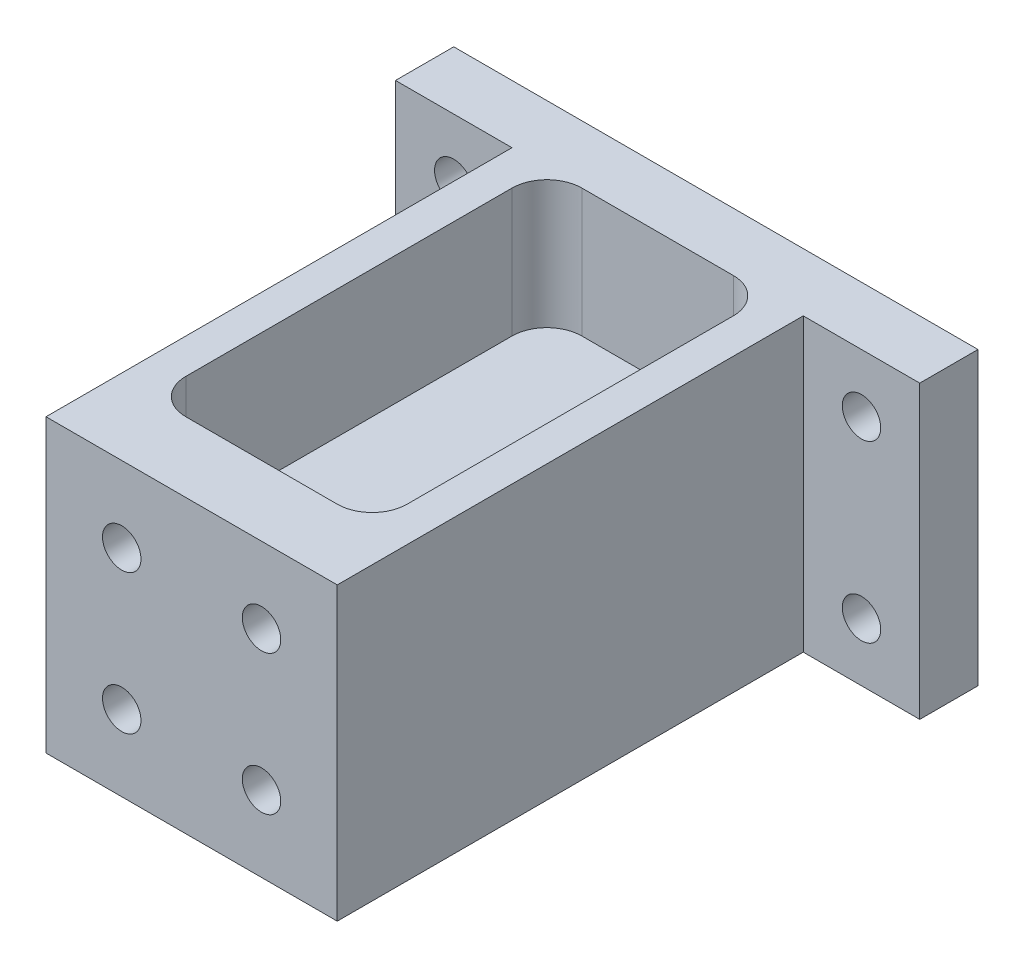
ISO-10303-21;
HEADER;
FILE_DESCRIPTION(('STEP AP214'),'2;1');
FILE_NAME('part.step','',(''),(''),'','','');
FILE_SCHEMA(('AUTOMOTIVE_DESIGN { 1 0 10303 214 1 1 1 1 }'));
ENDSEC;
DATA;
#1=APPLICATION_CONTEXT('core data for automotive mechanical design processes');
#2=APPLICATION_PROTOCOL_DEFINITION('international standard','automotive_design',2000,#1);
#3=PRODUCT_CONTEXT('',#1,'mechanical');
#4=PRODUCT('Part','Part','',(#3));
#5=PRODUCT_RELATED_PRODUCT_CATEGORY('part','',(#4));
#6=PRODUCT_DEFINITION_FORMATION('','',#4);
#7=PRODUCT_DEFINITION_CONTEXT('part definition',#1,'design');
#8=PRODUCT_DEFINITION('design','',#6,#7);
#9=PRODUCT_DEFINITION_SHAPE('','',#8);
#10=(LENGTH_UNIT() NAMED_UNIT(*) SI_UNIT(.MILLI.,.METRE.));
#11=(NAMED_UNIT(*) PLANE_ANGLE_UNIT() SI_UNIT($,.RADIAN.));
#12=(NAMED_UNIT(*) SI_UNIT($,.STERADIAN.) SOLID_ANGLE_UNIT());
#13=UNCERTAINTY_MEASURE_WITH_UNIT(LENGTH_MEASURE(1.E-05),#10,'distance_accuracy_value','');
#14=(GEOMETRIC_REPRESENTATION_CONTEXT(3) GLOBAL_UNCERTAINTY_ASSIGNED_CONTEXT((#13)) GLOBAL_UNIT_ASSIGNED_CONTEXT((#10,
#11,#12)) REPRESENTATION_CONTEXT('',''));
#15=CARTESIAN_POINT('',(0.,0.,0.));
#16=DIRECTION('',(0.,0.,1.));
#17=DIRECTION('',(1.,0.,0.));
#18=AXIS2_PLACEMENT_3D('',#15,#16,#17);
#19=CARTESIAN_POINT('',(-12.5,12.5,45.));
#20=DIRECTION('',(0.,-1.,0.));
#21=DIRECTION('',(0.,0.,-1.));
#22=AXIS2_PLACEMENT_3D('',#19,#20,#21);
#23=PLANE('',#22);
#24=DIRECTION('',(0.,0.,-1.));
#25=VECTOR('',#24,1.);
#26=CARTESIAN_POINT('',(12.5,12.5,45.));
#27=LINE('',#26,#25);
#28=CARTESIAN_POINT('',(12.5,12.5,45.));
#29=VERTEX_POINT('',#28);
#30=CARTESIAN_POINT('',(12.5,12.5,5.00000000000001));
#31=VERTEX_POINT('',#30);
#32=EDGE_CURVE('E324',#29,#31,#27,.T.);
#33=ORIENTED_EDGE('',*,*,#32,.T.);
#34=DIRECTION('',(1.,0.,0.));
#35=VECTOR('',#34,1.);
#36=CARTESIAN_POINT('',(22.5,12.5,5.));
#37=LINE('',#36,#35);
#38=CARTESIAN_POINT('',(22.5,12.5,5.));
#39=VERTEX_POINT('',#38);
#40=EDGE_CURVE('E276',#31,#39,#37,.T.);
#41=ORIENTED_EDGE('',*,*,#40,.T.);
#42=DIRECTION('',(0.,0.,-1.));
#43=VECTOR('',#42,1.);
#44=CARTESIAN_POINT('',(22.5,12.5,5.));
#45=LINE('',#44,#43);
#46=CARTESIAN_POINT('',(22.5,12.5,0.));
#47=VERTEX_POINT('',#46);
#48=EDGE_CURVE('E265',#39,#47,#45,.T.);
#49=ORIENTED_EDGE('',*,*,#48,.T.);
#50=DIRECTION('',(-1.,0.,0.));
#51=VECTOR('',#50,1.);
#52=CARTESIAN_POINT('',(-12.5,12.5,0.));
#53=LINE('',#52,#51);
#54=CARTESIAN_POINT('',(-22.5,12.5,0.));
#55=VERTEX_POINT('',#54);
#56=EDGE_CURVE('E260',#47,#55,#53,.T.);
#57=ORIENTED_EDGE('',*,*,#56,.T.);
#58=DIRECTION('',(0.,0.,-1.));
#59=VECTOR('',#58,1.);
#60=CARTESIAN_POINT('',(-22.5,12.5,5.));
#61=LINE('',#60,#59);
#62=CARTESIAN_POINT('',(-22.5,12.5,5.));
#63=VERTEX_POINT('',#62);
#64=EDGE_CURVE('E253',#63,#55,#61,.T.);
#65=ORIENTED_EDGE('',*,*,#64,.F.);
#66=CARTESIAN_POINT('',(-12.5,12.5,5.00000000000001));
#67=VERTEX_POINT('',#66);
#68=EDGE_CURVE('E258',#63,#67,#37,.T.);
#69=ORIENTED_EDGE('',*,*,#68,.T.);
#70=DIRECTION('',(0.,0.,-1.));
#71=VECTOR('',#70,1.);
#72=CARTESIAN_POINT('',(-12.5,12.5,45.));
#73=LINE('',#72,#71);
#74=CARTESIAN_POINT('',(-12.5,12.5,45.));
#75=VERTEX_POINT('',#74);
#76=EDGE_CURVE('E322',#75,#67,#73,.T.);
#77=ORIENTED_EDGE('',*,*,#76,.F.);
#78=DIRECTION('',(-1.,0.,0.));
#79=VECTOR('',#78,1.);
#80=CARTESIAN_POINT('',(-12.5,12.5,45.));
#81=LINE('',#80,#79);
#82=EDGE_CURVE('E308',#29,#75,#81,.T.);
#83=ORIENTED_EDGE('',*,*,#82,.F.);
#84=EDGE_LOOP('',(#33,#41,#49,#57,#65,#69,#77,#83));
#85=FACE_BOUND('',#84,.T.);
#86=DIRECTION('',(0.,0.,1.));
#87=VECTOR('',#86,1.);
#88=CARTESIAN_POINT('',(9.49999999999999,12.5,39.));
#89=LINE('',#88,#87);
#90=CARTESIAN_POINT('',(9.5,12.5,8.00000000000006));
#91=VERTEX_POINT('',#90);
#92=CARTESIAN_POINT('',(9.49999999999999,12.5,36.));
#93=VERTEX_POINT('',#92);
#94=EDGE_CURVE('E622',#91,#93,#89,.T.);
#95=ORIENTED_EDGE('',*,*,#94,.T.);
#96=CARTESIAN_POINT('',(6.49999999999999,12.5,36.));
#97=DIRECTION('',(0.,-1.,0.));
#98=DIRECTION('',(0.,0.,-1.));
#99=AXIS2_PLACEMENT_3D('',#96,#97,#98);
#100=CIRCLE('',#99,3.);
#101=CARTESIAN_POINT('',(6.49999999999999,12.5,39.));
#102=VERTEX_POINT('',#101);
#103=EDGE_CURVE('E612',#93,#102,#100,.T.);
#104=ORIENTED_EDGE('',*,*,#103,.T.);
#105=DIRECTION('',(-1.,0.,0.));
#106=VECTOR('',#105,1.);
#107=CARTESIAN_POINT('',(-2.25000000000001,12.5,39.));
#108=LINE('',#107,#106);
#109=CARTESIAN_POINT('',(-6.5,12.5,39.));
#110=VERTEX_POINT('',#109);
#111=EDGE_CURVE('E640',#102,#110,#108,.T.);
#112=ORIENTED_EDGE('',*,*,#111,.T.);
#113=CARTESIAN_POINT('',(-6.49999999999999,12.5,36.));
#114=DIRECTION('',(0.,-1.,0.));
#115=DIRECTION('',(0.,0.,-1.));
#116=AXIS2_PLACEMENT_3D('',#113,#114,#115);
#117=CIRCLE('',#116,3.);
#118=CARTESIAN_POINT('',(-9.49999999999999,12.5,36.));
#119=VERTEX_POINT('',#118);
#120=EDGE_CURVE('E610',#110,#119,#117,.T.);
#121=ORIENTED_EDGE('',*,*,#120,.T.);
#122=DIRECTION('',(0.,0.,-1.));
#123=VECTOR('',#122,1.);
#124=CARTESIAN_POINT('',(-9.49999999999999,12.5,39.));
#125=LINE('',#124,#123);
#126=CARTESIAN_POINT('',(-9.49999999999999,12.5,8.00000000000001));
#127=VERTEX_POINT('',#126);
#128=EDGE_CURVE('E632',#119,#127,#125,.T.);
#129=ORIENTED_EDGE('',*,*,#128,.T.);
#130=CARTESIAN_POINT('',(-6.49999999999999,12.5,8.00000000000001));
#131=DIRECTION('',(0.,-1.,0.));
#132=DIRECTION('',(0.,0.,-1.));
#133=AXIS2_PLACEMENT_3D('',#130,#131,#132);
#134=CIRCLE('',#133,3.);
#135=CARTESIAN_POINT('',(-6.49999999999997,12.5,5.00000000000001));
#136=VERTEX_POINT('',#135);
#137=EDGE_CURVE('E608',#127,#136,#134,.T.);
#138=ORIENTED_EDGE('',*,*,#137,.T.);
#139=DIRECTION('',(1.,0.,0.));
#140=VECTOR('',#139,1.);
#141=CARTESIAN_POINT('',(-2.25000000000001,12.5,5.00000000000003));
#142=LINE('',#141,#140);
#143=CARTESIAN_POINT('',(6.50000000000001,12.5,5.00000000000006));
#144=VERTEX_POINT('',#143);
#145=EDGE_CURVE('E627',#136,#144,#142,.T.);
#146=ORIENTED_EDGE('',*,*,#145,.T.);
#147=CARTESIAN_POINT('',(6.5,12.5,8.00000000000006));
#148=DIRECTION('',(0.,-1.,0.));
#149=DIRECTION('',(0.,0.,-1.));
#150=AXIS2_PLACEMENT_3D('',#147,#148,#149);
#151=CIRCLE('',#150,3.);
#152=EDGE_CURVE('E606',#144,#91,#151,.T.);
#153=ORIENTED_EDGE('',*,*,#152,.T.);
#154=EDGE_LOOP('',(#95,#104,#112,#121,#129,#138,#146,#153));
#155=FACE_BOUND('',#154,.T.);
#156=ADVANCED_FACE('F40',(#85,#155),#23,.F.);
#157=CARTESIAN_POINT('',(6.,6.,45.));
#158=DIRECTION('',(0.,0.,1.));
#159=DIRECTION('',(1.,0.,0.));
#160=AXIS2_PLACEMENT_3D('',#157,#158,#159);
#161=CYLINDRICAL_SURFACE('',#160,1.64999999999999);
#162=CARTESIAN_POINT('',(6.,6.,45.));
#163=DIRECTION('',(0.,0.,1.));
#164=DIRECTION('',(1.,0.,0.));
#165=AXIS2_PLACEMENT_3D('',#162,#163,#164);
#166=CIRCLE('',#165,1.64999999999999);
#167=CARTESIAN_POINT('',(7.64999999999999,6.,45.));
#168=VERTEX_POINT('',#167);
#169=EDGE_CURVE('E670',#168,#168,#166,.T.);
#170=ORIENTED_EDGE('',*,*,#169,.T.);
#171=EDGE_LOOP('',(#170));
#172=FACE_BOUND('',#171,.T.);
#173=CARTESIAN_POINT('',(6.,6.,39.));
#174=DIRECTION('',(0.,0.,-1.));
#175=DIRECTION('',(-1.,0.,0.));
#176=AXIS2_PLACEMENT_3D('',#173,#174,#175);
#177=CIRCLE('',#176,1.64999999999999);
#178=CARTESIAN_POINT('',(6.49999999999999,4.42758148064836,39.));
#179=VERTEX_POINT('',#178);
#180=CARTESIAN_POINT('',(6.49999999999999,7.57241851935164,39.));
#181=VERTEX_POINT('',#180);
#182=EDGE_CURVE('E588',#179,#181,#177,.F.);
#183=ORIENTED_EDGE('',*,*,#182,.F.);
#184=EDGE_CURVE('E339',#181,#179,#177,.F.);
#185=ORIENTED_EDGE('',*,*,#184,.F.);
#186=EDGE_LOOP('',(#183,#185));
#187=FACE_BOUND('',#186,.T.);
#188=ADVANCED_FACE('F523',(#172,#187),#161,.F.);
#189=CARTESIAN_POINT('',(-6.,5.99999999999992,45.));
#190=DIRECTION('',(0.,0.,1.));
#191=DIRECTION('',(1.,0.,0.));
#192=AXIS2_PLACEMENT_3D('',#189,#190,#191);
#193=CYLINDRICAL_SURFACE('',#192,1.64999999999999);
#194=CARTESIAN_POINT('',(-6.,5.99999999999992,45.));
#195=DIRECTION('',(0.,0.,1.));
#196=DIRECTION('',(1.,0.,0.));
#197=AXIS2_PLACEMENT_3D('',#194,#195,#196);
#198=CIRCLE('',#197,1.64999999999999);
#199=CARTESIAN_POINT('',(-4.35000000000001,5.99999999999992,45.));
#200=VERTEX_POINT('',#199);
#201=EDGE_CURVE('E667',#200,#200,#198,.T.);
#202=ORIENTED_EDGE('',*,*,#201,.T.);
#203=EDGE_LOOP('',(#202));
#204=FACE_BOUND('',#203,.T.);
#205=CARTESIAN_POINT('',(-6.,5.99999999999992,39.));
#206=DIRECTION('',(0.,0.,-1.));
#207=DIRECTION('',(-1.,0.,0.));
#208=AXIS2_PLACEMENT_3D('',#205,#206,#207);
#209=CIRCLE('',#208,1.64999999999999);
#210=CARTESIAN_POINT('',(-6.5,4.42758148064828,39.));
#211=VERTEX_POINT('',#210);
#212=CARTESIAN_POINT('',(-6.5,7.57241851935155,39.));
#213=VERTEX_POINT('',#212);
#214=EDGE_CURVE('E336',#211,#213,#209,.F.);
#215=ORIENTED_EDGE('',*,*,#214,.F.);
#216=EDGE_CURVE('E340',#213,#211,#209,.F.);
#217=ORIENTED_EDGE('',*,*,#216,.F.);
#218=EDGE_LOOP('',(#215,#217));
#219=FACE_BOUND('',#218,.T.);
#220=ADVANCED_FACE('F466',(#204,#219),#193,.F.);
#221=CARTESIAN_POINT('',(12.5,-12.5,45.));
#222=DIRECTION('',(-1.,0.,0.));
#223=DIRECTION('',(0.,0.,1.));
#224=AXIS2_PLACEMENT_3D('',#221,#222,#223);
#225=PLANE('',#224);
#226=DIRECTION('',(0.,0.,-1.));
#227=VECTOR('',#226,1.);
#228=CARTESIAN_POINT('',(12.5,-12.5,45.));
#229=LINE('',#228,#227);
#230=CARTESIAN_POINT('',(12.5,-12.5,45.));
#231=VERTEX_POINT('',#230);
#232=CARTESIAN_POINT('',(12.5,-12.5,5.00000000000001));
#233=VERTEX_POINT('',#232);
#234=EDGE_CURVE('E315',#231,#233,#229,.T.);
#235=ORIENTED_EDGE('',*,*,#234,.T.);
#236=DIRECTION('',(0.,1.,0.));
#237=VECTOR('',#236,1.);
#238=CARTESIAN_POINT('',(12.5,-12.5,5.));
#239=LINE('',#238,#237);
#240=EDGE_CURVE('E303',#233,#31,#239,.T.);
#241=ORIENTED_EDGE('',*,*,#240,.T.);
#242=ORIENTED_EDGE('',*,*,#32,.F.);
#243=DIRECTION('',(0.,1.,0.));
#244=VECTOR('',#243,1.);
#245=CARTESIAN_POINT('',(12.5,-12.5,45.));
#246=LINE('',#245,#244);
#247=EDGE_CURVE('E305',#231,#29,#246,.T.);
#248=ORIENTED_EDGE('',*,*,#247,.F.);
#249=EDGE_LOOP('',(#235,#241,#242,#248));
#250=FACE_BOUND('',#249,.T.);
#251=ADVANCED_FACE('F532',(#250),#225,.F.);
#252=CARTESIAN_POINT('',(-12.5,-12.5,45.));
#253=DIRECTION('',(1.,0.,0.));
#254=DIRECTION('',(0.,0.,-1.));
#255=AXIS2_PLACEMENT_3D('',#252,#253,#254);
#256=PLANE('',#255);
#257=ORIENTED_EDGE('',*,*,#76,.T.);
#258=DIRECTION('',(0.,-1.,0.));
#259=VECTOR('',#258,1.);
#260=CARTESIAN_POINT('',(-12.5,-12.5,5.));
#261=LINE('',#260,#259);
#262=CARTESIAN_POINT('',(-12.5,-12.5,5.00000000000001));
#263=VERTEX_POINT('',#262);
#264=EDGE_CURVE('E274',#67,#263,#261,.T.);
#265=ORIENTED_EDGE('',*,*,#264,.T.);
#266=DIRECTION('',(0.,0.,-1.));
#267=VECTOR('',#266,1.);
#268=CARTESIAN_POINT('',(-12.5,-12.5,45.));
#269=LINE('',#268,#267);
#270=CARTESIAN_POINT('',(-12.5,-12.5,45.));
#271=VERTEX_POINT('',#270);
#272=EDGE_CURVE('E319',#271,#263,#269,.T.);
#273=ORIENTED_EDGE('',*,*,#272,.F.);
#274=DIRECTION('',(0.,-1.,0.));
#275=VECTOR('',#274,1.);
#276=CARTESIAN_POINT('',(-12.5,-12.5,45.));
#277=LINE('',#276,#275);
#278=EDGE_CURVE('E311',#75,#271,#277,.T.);
#279=ORIENTED_EDGE('',*,*,#278,.F.);
#280=EDGE_LOOP('',(#257,#265,#273,#279));
#281=FACE_BOUND('',#280,.T.);
#282=ADVANCED_FACE('F530',(#281),#256,.F.);
#283=CARTESIAN_POINT('',(-12.5,-12.5,45.));
#284=DIRECTION('',(0.,1.,0.));
#285=DIRECTION('',(0.,0.,1.));
#286=AXIS2_PLACEMENT_3D('',#283,#284,#285);
#287=PLANE('',#286);
#288=DIRECTION('',(0.,0.,-1.));
#289=VECTOR('',#288,1.);
#290=CARTESIAN_POINT('',(-9.49999999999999,-12.5,39.));
#291=LINE('',#290,#289);
#292=CARTESIAN_POINT('',(-9.49999999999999,-12.5,36.));
#293=VERTEX_POINT('',#292);
#294=CARTESIAN_POINT('',(-9.49999999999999,-12.5,8.));
#295=VERTEX_POINT('',#294);
#296=EDGE_CURVE('E581',#293,#295,#291,.T.);
#297=ORIENTED_EDGE('',*,*,#296,.F.);
#298=CARTESIAN_POINT('',(-6.49999999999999,-12.5,36.));
#299=DIRECTION('',(0.,1.,0.));
#300=DIRECTION('',(0.,0.,1.));
#301=AXIS2_PLACEMENT_3D('',#298,#299,#300);
#302=CIRCLE('',#301,3.);
#303=CARTESIAN_POINT('',(-6.49999999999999,-12.5,39.));
#304=VERTEX_POINT('',#303);
#305=EDGE_CURVE('E11',#293,#304,#302,.T.);
#306=ORIENTED_EDGE('',*,*,#305,.T.);
#307=DIRECTION('',(-1.,0.,0.));
#308=VECTOR('',#307,1.);
#309=CARTESIAN_POINT('',(2.25,-12.5,39.));
#310=LINE('',#309,#308);
#311=CARTESIAN_POINT('',(6.49999999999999,-12.5,39.));
#312=VERTEX_POINT('',#311);
#313=EDGE_CURVE('E650',#312,#304,#310,.T.);
#314=ORIENTED_EDGE('',*,*,#313,.F.);
#315=CARTESIAN_POINT('',(6.49999999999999,-12.5,36.));
#316=DIRECTION('',(0.,1.,0.));
#317=DIRECTION('',(0.,0.,1.));
#318=AXIS2_PLACEMENT_3D('',#315,#316,#317);
#319=CIRCLE('',#318,3.);
#320=CARTESIAN_POINT('',(9.49999999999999,-12.5,36.));
#321=VERTEX_POINT('',#320);
#322=EDGE_CURVE('E53',#312,#321,#319,.T.);
#323=ORIENTED_EDGE('',*,*,#322,.T.);
#324=DIRECTION('',(0.,0.,1.));
#325=VECTOR('',#324,1.);
#326=CARTESIAN_POINT('',(9.49999999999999,-12.5,39.));
#327=LINE('',#326,#325);
#328=CARTESIAN_POINT('',(9.5,-12.5,8.));
#329=VERTEX_POINT('',#328);
#330=EDGE_CURVE('E661',#329,#321,#327,.T.);
#331=ORIENTED_EDGE('',*,*,#330,.F.);
#332=CARTESIAN_POINT('',(6.5,-12.5,8.));
#333=DIRECTION('',(0.,1.,0.));
#334=DIRECTION('',(0.,0.,1.));
#335=AXIS2_PLACEMENT_3D('',#332,#333,#334);
#336=CIRCLE('',#335,3.);
#337=CARTESIAN_POINT('',(6.5,-12.5,5.));
#338=VERTEX_POINT('',#337);
#339=EDGE_CURVE('E614',#329,#338,#336,.T.);
#340=ORIENTED_EDGE('',*,*,#339,.T.);
#341=DIRECTION('',(1.,0.,0.));
#342=VECTOR('',#341,1.);
#343=CARTESIAN_POINT('',(2.25,-12.5,5.));
#344=LINE('',#343,#342);
#345=CARTESIAN_POINT('',(-6.49999999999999,-12.5,5.));
#346=VERTEX_POINT('',#345);
#347=EDGE_CURVE('E587',#346,#338,#344,.T.);
#348=ORIENTED_EDGE('',*,*,#347,.F.);
#349=CARTESIAN_POINT('',(-6.49999999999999,-12.5,8.));
#350=DIRECTION('',(0.,1.,0.));
#351=DIRECTION('',(0.,0.,1.));
#352=AXIS2_PLACEMENT_3D('',#349,#350,#351);
#353=CIRCLE('',#352,3.);
#354=EDGE_CURVE('E585',#346,#295,#353,.T.);
#355=ORIENTED_EDGE('',*,*,#354,.T.);
#356=EDGE_LOOP('',(#297,#306,#314,#323,#331,#340,#348,#355));
#357=FACE_BOUND('',#356,.T.);
#358=ORIENTED_EDGE('',*,*,#272,.T.);
#359=DIRECTION('',(-1.,0.,0.));
#360=VECTOR('',#359,1.);
#361=CARTESIAN_POINT('',(22.5,-12.5,5.));
#362=LINE('',#361,#360);
#363=CARTESIAN_POINT('',(-22.5,-12.5,5.));
#364=VERTEX_POINT('',#363);
#365=EDGE_CURVE('E293',#263,#364,#362,.T.);
#366=ORIENTED_EDGE('',*,*,#365,.T.);
#367=DIRECTION('',(0.,0.,-1.));
#368=VECTOR('',#367,1.);
#369=CARTESIAN_POINT('',(-22.5,-12.5,5.));
#370=LINE('',#369,#368);
#371=CARTESIAN_POINT('',(-22.5,-12.5,0.));
#372=VERTEX_POINT('',#371);
#373=EDGE_CURVE('E281',#364,#372,#370,.T.);
#374=ORIENTED_EDGE('',*,*,#373,.T.);
#375=DIRECTION('',(1.,0.,0.));
#376=VECTOR('',#375,1.);
#377=CARTESIAN_POINT('',(-12.5,-12.5,0.));
#378=LINE('',#377,#376);
#379=CARTESIAN_POINT('',(22.5,-12.5,0.));
#380=VERTEX_POINT('',#379);
#381=EDGE_CURVE('E309',#372,#380,#378,.T.);
#382=ORIENTED_EDGE('',*,*,#381,.T.);
#383=DIRECTION('',(0.,0.,-1.));
#384=VECTOR('',#383,1.);
#385=CARTESIAN_POINT('',(22.5,-12.5,5.));
#386=LINE('',#385,#384);
#387=CARTESIAN_POINT('',(22.5,-12.5,5.));
#388=VERTEX_POINT('',#387);
#389=EDGE_CURVE('E298',#388,#380,#386,.T.);
#390=ORIENTED_EDGE('',*,*,#389,.F.);
#391=EDGE_CURVE('E266',#388,#233,#362,.T.);
#392=ORIENTED_EDGE('',*,*,#391,.T.);
#393=ORIENTED_EDGE('',*,*,#234,.F.);
#394=DIRECTION('',(1.,0.,0.));
#395=VECTOR('',#394,1.);
#396=CARTESIAN_POINT('',(-12.5,-12.5,45.));
#397=LINE('',#396,#395);
#398=EDGE_CURVE('E313',#271,#231,#397,.T.);
#399=ORIENTED_EDGE('',*,*,#398,.F.);
#400=EDGE_LOOP('',(#358,#366,#374,#382,#390,#392,#393,#399));
#401=FACE_BOUND('',#400,.T.);
#402=ADVANCED_FACE('F539',(#357,#401),#287,.F.);
#403=CARTESIAN_POINT('',(0.,0.,45.));
#404=DIRECTION('',(0.,0.,-1.));
#405=DIRECTION('',(-1.,0.,0.));
#406=AXIS2_PLACEMENT_3D('',#403,#404,#405);
#407=PLANE('',#406);
#408=ORIENTED_EDGE('',*,*,#201,.F.);
#409=EDGE_LOOP('',(#408));
#410=FACE_BOUND('',#409,.T.);
#411=ORIENTED_EDGE('',*,*,#169,.F.);
#412=EDGE_LOOP('',(#411));
#413=FACE_BOUND('',#412,.T.);
#414=CARTESIAN_POINT('',(6.00000000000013,-6.,45.));
#415=DIRECTION('',(0.,0.,1.));
#416=DIRECTION('',(1.,0.,0.));
#417=AXIS2_PLACEMENT_3D('',#414,#415,#416);
#418=CIRCLE('',#417,1.64999999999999);
#419=CARTESIAN_POINT('',(7.65000000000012,-6.,45.));
#420=VERTEX_POINT('',#419);
#421=EDGE_CURVE('E673',#420,#420,#418,.T.);
#422=ORIENTED_EDGE('',*,*,#421,.F.);
#423=EDGE_LOOP('',(#422));
#424=FACE_BOUND('',#423,.T.);
#425=CARTESIAN_POINT('',(-5.99999999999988,-6.00000000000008,45.));
#426=DIRECTION('',(0.,0.,1.));
#427=DIRECTION('',(1.,0.,0.));
#428=AXIS2_PLACEMENT_3D('',#425,#426,#427);
#429=CIRCLE('',#428,1.64999999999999);
#430=CARTESIAN_POINT('',(-4.34999999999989,-6.00000000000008,45.));
#431=VERTEX_POINT('',#430);
#432=EDGE_CURVE('E676',#431,#431,#429,.T.);
#433=ORIENTED_EDGE('',*,*,#432,.F.);
#434=EDGE_LOOP('',(#433));
#435=FACE_BOUND('',#434,.T.);
#436=ORIENTED_EDGE('',*,*,#247,.T.);
#437=ORIENTED_EDGE('',*,*,#82,.T.);
#438=ORIENTED_EDGE('',*,*,#278,.T.);
#439=ORIENTED_EDGE('',*,*,#398,.T.);
#440=EDGE_LOOP('',(#436,#437,#438,#439));
#441=FACE_BOUND('',#440,.T.);
#442=ADVANCED_FACE('F559',(#410,#413,#424,#435,#441),#407,.F.);
#443=CARTESIAN_POINT('',(0.,0.,0.));
#444=DIRECTION('',(0.,0.,-1.));
#445=DIRECTION('',(-1.,0.,0.));
#446=AXIS2_PLACEMENT_3D('',#443,#444,#445);
#447=PLANE('',#446);
#448=CARTESIAN_POINT('',(-17.5,7.5,0.));
#449=DIRECTION('',(0.,0.,-1.));
#450=DIRECTION('',(-1.,0.,0.));
#451=AXIS2_PLACEMENT_3D('',#448,#449,#450);
#452=CIRCLE('',#451,1.65);
#453=CARTESIAN_POINT('',(-19.15,7.5,0.));
#454=VERTEX_POINT('',#453);
#455=EDGE_CURVE('E682',#454,#454,#452,.T.);
#456=ORIENTED_EDGE('',*,*,#455,.F.);
#457=EDGE_LOOP('',(#456));
#458=FACE_BOUND('',#457,.T.);
#459=CARTESIAN_POINT('',(-17.5000000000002,-7.5,0.));
#460=DIRECTION('',(0.,0.,-1.));
#461=DIRECTION('',(-1.,0.,0.));
#462=AXIS2_PLACEMENT_3D('',#459,#460,#461);
#463=CIRCLE('',#462,1.64999999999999);
#464=CARTESIAN_POINT('',(-19.1500000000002,-7.5,0.));
#465=VERTEX_POINT('',#464);
#466=EDGE_CURVE('E327',#465,#465,#463,.T.);
#467=ORIENTED_EDGE('',*,*,#466,.F.);
#468=EDGE_LOOP('',(#467));
#469=FACE_BOUND('',#468,.T.);
#470=CARTESIAN_POINT('',(17.4999999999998,-7.50000000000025,0.));
#471=DIRECTION('',(0.,0.,-1.));
#472=DIRECTION('',(-1.,0.,0.));
#473=AXIS2_PLACEMENT_3D('',#470,#471,#472);
#474=CIRCLE('',#473,1.65);
#475=CARTESIAN_POINT('',(15.8499999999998,-7.50000000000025,0.));
#476=VERTEX_POINT('',#475);
#477=EDGE_CURVE('E689',#476,#476,#474,.T.);
#478=ORIENTED_EDGE('',*,*,#477,.F.);
#479=EDGE_LOOP('',(#478));
#480=FACE_BOUND('',#479,.T.);
#481=CARTESIAN_POINT('',(17.5,7.49999999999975,0.));
#482=DIRECTION('',(0.,0.,-1.));
#483=DIRECTION('',(-1.,0.,0.));
#484=AXIS2_PLACEMENT_3D('',#481,#482,#483);
#485=CIRCLE('',#484,1.65);
#486=CARTESIAN_POINT('',(15.85,7.49999999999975,0.));
#487=VERTEX_POINT('',#486);
#488=EDGE_CURVE('E288',#487,#487,#485,.T.);
#489=ORIENTED_EDGE('',*,*,#488,.F.);
#490=EDGE_LOOP('',(#489));
#491=FACE_BOUND('',#490,.T.);
#492=ORIENTED_EDGE('',*,*,#56,.F.);
#493=DIRECTION('',(0.,-1.,0.));
#494=VECTOR('',#493,1.);
#495=CARTESIAN_POINT('',(22.5,-12.5,0.));
#496=LINE('',#495,#494);
#497=EDGE_CURVE('E282',#47,#380,#496,.T.);
#498=ORIENTED_EDGE('',*,*,#497,.T.);
#499=ORIENTED_EDGE('',*,*,#381,.F.);
#500=DIRECTION('',(0.,1.,0.));
#501=VECTOR('',#500,1.);
#502=CARTESIAN_POINT('',(-22.5,-12.5,0.));
#503=LINE('',#502,#501);
#504=EDGE_CURVE('E285',#372,#55,#503,.T.);
#505=ORIENTED_EDGE('',*,*,#504,.T.);
#506=EDGE_LOOP('',(#492,#498,#499,#505));
#507=FACE_BOUND('',#506,.T.);
#508=ADVANCED_FACE('F562',(#458,#469,#480,#491,#507),#447,.T.);
#509=CARTESIAN_POINT('',(-22.5,-12.5,5.));
#510=DIRECTION('',(-1.,0.,0.));
#511=DIRECTION('',(0.,0.,1.));
#512=AXIS2_PLACEMENT_3D('',#509,#510,#511);
#513=PLANE('',#512);
#514=ORIENTED_EDGE('',*,*,#504,.F.);
#515=ORIENTED_EDGE('',*,*,#373,.F.);
#516=DIRECTION('',(0.,1.,0.));
#517=VECTOR('',#516,1.);
#518=CARTESIAN_POINT('',(-22.5,-12.5,5.));
#519=LINE('',#518,#517);
#520=EDGE_CURVE('E273',#364,#63,#519,.T.);
#521=ORIENTED_EDGE('',*,*,#520,.T.);
#522=ORIENTED_EDGE('',*,*,#64,.T.);
#523=EDGE_LOOP('',(#514,#515,#521,#522));
#524=FACE_BOUND('',#523,.T.);
#525=ADVANCED_FACE('F279',(#524),#513,.T.);
#526=CARTESIAN_POINT('',(0.,0.,5.));
#527=DIRECTION('',(0.,0.,1.));
#528=DIRECTION('',(1.,0.,0.));
#529=AXIS2_PLACEMENT_3D('',#526,#527,#528);
#530=PLANE('',#529);
#531=CARTESIAN_POINT('',(-17.5,7.5,5.));
#532=DIRECTION('',(0.,0.,1.));
#533=DIRECTION('',(1.,0.,0.));
#534=AXIS2_PLACEMENT_3D('',#531,#532,#533);
#535=CIRCLE('',#534,1.64999999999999);
#536=CARTESIAN_POINT('',(-15.85,7.5,5.));
#537=VERTEX_POINT('',#536);
#538=EDGE_CURVE('E679',#537,#537,#535,.T.);
#539=ORIENTED_EDGE('',*,*,#538,.F.);
#540=EDGE_LOOP('',(#539));
#541=FACE_BOUND('',#540,.T.);
#542=CARTESIAN_POINT('',(-17.5000000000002,-7.5,5.));
#543=DIRECTION('',(0.,0.,1.));
#544=DIRECTION('',(1.,0.,0.));
#545=AXIS2_PLACEMENT_3D('',#542,#543,#544);
#546=CIRCLE('',#545,1.64999999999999);
#547=CARTESIAN_POINT('',(-15.8500000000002,-7.5,5.));
#548=VERTEX_POINT('',#547);
#549=EDGE_CURVE('E331',#548,#548,#546,.T.);
#550=ORIENTED_EDGE('',*,*,#549,.F.);
#551=EDGE_LOOP('',(#550));
#552=FACE_BOUND('',#551,.T.);
#553=ORIENTED_EDGE('',*,*,#264,.F.);
#554=ORIENTED_EDGE('',*,*,#68,.F.);
#555=ORIENTED_EDGE('',*,*,#520,.F.);
#556=ORIENTED_EDGE('',*,*,#365,.F.);
#557=EDGE_LOOP('',(#553,#554,#555,#556));
#558=FACE_BOUND('',#557,.T.);
#559=ADVANCED_FACE('F271',(#541,#552,#558),#530,.T.);
#560=CARTESIAN_POINT('',(17.4999999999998,-7.50000000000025,5.));
#561=DIRECTION('',(0.,0.,1.));
#562=DIRECTION('',(1.,0.,0.));
#563=AXIS2_PLACEMENT_3D('',#560,#561,#562);
#564=CIRCLE('',#563,1.64999999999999);
#565=CARTESIAN_POINT('',(19.1499999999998,-7.50000000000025,5.));
#566=VERTEX_POINT('',#565);
#567=EDGE_CURVE('E330',#566,#566,#564,.T.);
#568=ORIENTED_EDGE('',*,*,#567,.F.);
#569=EDGE_LOOP('',(#568));
#570=FACE_BOUND('',#569,.T.);
#571=CARTESIAN_POINT('',(17.5,7.49999999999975,5.));
#572=DIRECTION('',(0.,0.,1.));
#573=DIRECTION('',(1.,0.,0.));
#574=AXIS2_PLACEMENT_3D('',#571,#572,#573);
#575=CIRCLE('',#574,1.64999999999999);
#576=CARTESIAN_POINT('',(19.15,7.49999999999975,5.));
#577=VERTEX_POINT('',#576);
#578=EDGE_CURVE('E691',#577,#577,#575,.T.);
#579=ORIENTED_EDGE('',*,*,#578,.F.);
#580=EDGE_LOOP('',(#579));
#581=FACE_BOUND('',#580,.T.);
#582=ORIENTED_EDGE('',*,*,#240,.F.);
#583=ORIENTED_EDGE('',*,*,#391,.F.);
#584=DIRECTION('',(0.,-1.,0.));
#585=VECTOR('',#584,1.);
#586=CARTESIAN_POINT('',(22.5,-12.5,5.));
#587=LINE('',#586,#585);
#588=EDGE_CURVE('E275',#39,#388,#587,.T.);
#589=ORIENTED_EDGE('',*,*,#588,.F.);
#590=ORIENTED_EDGE('',*,*,#40,.F.);
#591=EDGE_LOOP('',(#582,#583,#589,#590));
#592=FACE_BOUND('',#591,.T.);
#593=ADVANCED_FACE('F551',(#570,#581,#592),#530,.T.);
#594=CARTESIAN_POINT('',(22.5,-12.5,5.));
#595=DIRECTION('',(1.,0.,0.));
#596=DIRECTION('',(0.,0.,-1.));
#597=AXIS2_PLACEMENT_3D('',#594,#595,#596);
#598=PLANE('',#597);
#599=ORIENTED_EDGE('',*,*,#497,.F.);
#600=ORIENTED_EDGE('',*,*,#48,.F.);
#601=ORIENTED_EDGE('',*,*,#588,.T.);
#602=ORIENTED_EDGE('',*,*,#389,.T.);
#603=EDGE_LOOP('',(#599,#600,#601,#602));
#604=FACE_BOUND('',#603,.T.);
#605=ADVANCED_FACE('F556',(#604),#598,.T.);
#606=CARTESIAN_POINT('',(17.5,7.49999999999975,5.));
#607=DIRECTION('',(0.,0.,1.));
#608=DIRECTION('',(1.,0.,0.));
#609=AXIS2_PLACEMENT_3D('',#606,#607,#608);
#610=CYLINDRICAL_SURFACE('',#609,1.65);
#611=ORIENTED_EDGE('',*,*,#488,.T.);
#612=EDGE_LOOP('',(#611));
#613=FACE_BOUND('',#612,.T.);
#614=ORIENTED_EDGE('',*,*,#578,.T.);
#615=EDGE_LOOP('',(#614));
#616=FACE_BOUND('',#615,.T.);
#617=ADVANCED_FACE('F698',(#613,#616),#610,.F.);
#618=CARTESIAN_POINT('',(17.4999999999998,-7.50000000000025,5.));
#619=DIRECTION('',(0.,0.,1.));
#620=DIRECTION('',(1.,0.,0.));
#621=AXIS2_PLACEMENT_3D('',#618,#619,#620);
#622=CYLINDRICAL_SURFACE('',#621,1.65);
#623=ORIENTED_EDGE('',*,*,#477,.T.);
#624=EDGE_LOOP('',(#623));
#625=FACE_BOUND('',#624,.T.);
#626=ORIENTED_EDGE('',*,*,#567,.T.);
#627=EDGE_LOOP('',(#626));
#628=FACE_BOUND('',#627,.T.);
#629=ADVANCED_FACE('F701',(#625,#628),#622,.F.);
#630=CARTESIAN_POINT('',(-17.5000000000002,-7.5,5.));
#631=DIRECTION('',(0.,0.,1.));
#632=DIRECTION('',(1.,0.,0.));
#633=AXIS2_PLACEMENT_3D('',#630,#631,#632);
#634=CYLINDRICAL_SURFACE('',#633,1.64999999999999);
#635=ORIENTED_EDGE('',*,*,#466,.T.);
#636=EDGE_LOOP('',(#635));
#637=FACE_BOUND('',#636,.T.);
#638=ORIENTED_EDGE('',*,*,#549,.T.);
#639=EDGE_LOOP('',(#638));
#640=FACE_BOUND('',#639,.T.);
#641=ADVANCED_FACE('F707',(#637,#640),#634,.F.);
#642=CARTESIAN_POINT('',(-17.5,7.5,5.));
#643=DIRECTION('',(0.,0.,1.));
#644=DIRECTION('',(1.,0.,0.));
#645=AXIS2_PLACEMENT_3D('',#642,#643,#644);
#646=CYLINDRICAL_SURFACE('',#645,1.65);
#647=ORIENTED_EDGE('',*,*,#455,.T.);
#648=EDGE_LOOP('',(#647));
#649=FACE_BOUND('',#648,.T.);
#650=ORIENTED_EDGE('',*,*,#538,.T.);
#651=EDGE_LOOP('',(#650));
#652=FACE_BOUND('',#651,.T.);
#653=ADVANCED_FACE('F729',(#649,#652),#646,.F.);
#654=CARTESIAN_POINT('',(-5.99999999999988,-6.00000000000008,45.));
#655=DIRECTION('',(0.,0.,1.));
#656=DIRECTION('',(1.,0.,0.));
#657=AXIS2_PLACEMENT_3D('',#654,#655,#656);
#658=CYLINDRICAL_SURFACE('',#657,1.64999999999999);
#659=CARTESIAN_POINT('',(-5.99999999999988,-6.00000000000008,39.));
#660=DIRECTION('',(0.,0.,1.));
#661=DIRECTION('',(1.,0.,0.));
#662=AXIS2_PLACEMENT_3D('',#659,#660,#661);
#663=CIRCLE('',#662,1.64999999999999);
#664=CARTESIAN_POINT('',(-6.49999999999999,-7.57241851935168,39.));
#665=VERTEX_POINT('',#664);
#666=CARTESIAN_POINT('',(-6.49999999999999,-4.42758148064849,39.));
#667=VERTEX_POINT('',#666);
#668=EDGE_CURVE('E665',#665,#667,#663,.F.);
#669=ORIENTED_EDGE('',*,*,#668,.T.);
#670=EDGE_CURVE('E61',#667,#665,#663,.F.);
#671=ORIENTED_EDGE('',*,*,#670,.T.);
#672=EDGE_LOOP('',(#669,#671));
#673=FACE_BOUND('',#672,.T.);
#674=ORIENTED_EDGE('',*,*,#432,.T.);
#675=EDGE_LOOP('',(#674));
#676=FACE_BOUND('',#675,.T.);
#677=ADVANCED_FACE('F734',(#673,#676),#658,.F.);
#678=CARTESIAN_POINT('',(6.00000000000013,-6.,45.));
#679=DIRECTION('',(0.,0.,1.));
#680=DIRECTION('',(1.,0.,0.));
#681=AXIS2_PLACEMENT_3D('',#678,#679,#680);
#682=CYLINDRICAL_SURFACE('',#681,1.64999999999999);
#683=CARTESIAN_POINT('',(6.00000000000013,-6.,39.));
#684=DIRECTION('',(0.,0.,1.));
#685=DIRECTION('',(1.,0.,0.));
#686=AXIS2_PLACEMENT_3D('',#683,#684,#685);
#687=CIRCLE('',#686,1.64999999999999);
#688=CARTESIAN_POINT('',(6.49999999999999,-7.57241851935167,39.));
#689=VERTEX_POINT('',#688);
#690=CARTESIAN_POINT('',(6.49999999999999,-4.42758148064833,39.));
#691=VERTEX_POINT('',#690);
#692=EDGE_CURVE('E332',#689,#691,#687,.F.);
#693=ORIENTED_EDGE('',*,*,#692,.T.);
#694=EDGE_CURVE('E335',#691,#689,#687,.F.);
#695=ORIENTED_EDGE('',*,*,#694,.T.);
#696=EDGE_LOOP('',(#693,#695));
#697=FACE_BOUND('',#696,.T.);
#698=ORIENTED_EDGE('',*,*,#421,.T.);
#699=EDGE_LOOP('',(#698));
#700=FACE_BOUND('',#699,.T.);
#701=ADVANCED_FACE('F739',(#697,#700),#682,.F.);
#702=CARTESIAN_POINT('',(2.25,-1.5,39.));
#703=DIRECTION('',(0.,0.,1.));
#704=DIRECTION('',(1.,0.,0.));
#705=AXIS2_PLACEMENT_3D('',#702,#703,#704);
#706=PLANE('',#705);
#707=DIRECTION('',(-1.,0.,0.));
#708=VECTOR('',#707,1.);
#709=CARTESIAN_POINT('',(-2.25000000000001,-1.5,39.));
#710=LINE('',#709,#708);
#711=CARTESIAN_POINT('',(6.5,-1.5,39.));
#712=VERTEX_POINT('',#711);
#713=CARTESIAN_POINT('',(-6.49999999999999,-1.5,39.));
#714=VERTEX_POINT('',#713);
#715=EDGE_CURVE('E646',#712,#714,#710,.T.);
#716=ORIENTED_EDGE('',*,*,#715,.F.);
#717=DIRECTION('',(0.,-1.,0.));
#718=VECTOR('',#717,1.);
#719=CARTESIAN_POINT('',(6.49999999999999,-12.5,39.));
#720=LINE('',#719,#718);
#721=EDGE_CURVE('E599',#712,#691,#720,.T.);
#722=ORIENTED_EDGE('',*,*,#721,.T.);
#723=ORIENTED_EDGE('',*,*,#692,.F.);
#724=DIRECTION('',(0.,-1.,0.));
#725=VECTOR('',#724,1.);
#726=CARTESIAN_POINT('',(6.49999999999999,-12.5,39.));
#727=LINE('',#726,#725);
#728=EDGE_CURVE('E596',#689,#312,#727,.T.);
#729=ORIENTED_EDGE('',*,*,#728,.T.);
#730=ORIENTED_EDGE('',*,*,#313,.T.);
#731=DIRECTION('',(0.,-1.,0.));
#732=VECTOR('',#731,1.);
#733=CARTESIAN_POINT('',(-6.49999999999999,-1.5,39.));
#734=LINE('',#733,#732);
#735=EDGE_CURVE('E66',#304,#665,#734,.F.);
#736=ORIENTED_EDGE('',*,*,#735,.T.);
#737=ORIENTED_EDGE('',*,*,#670,.F.);
#738=DIRECTION('',(0.,-1.,0.));
#739=VECTOR('',#738,1.);
#740=CARTESIAN_POINT('',(-6.49999999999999,-1.5,39.));
#741=LINE('',#740,#739);
#742=EDGE_CURVE('E597',#667,#714,#741,.F.);
#743=ORIENTED_EDGE('',*,*,#742,.T.);
#744=EDGE_LOOP('',(#716,#722,#723,#729,#730,#736,#737,#743));
#745=FACE_BOUND('',#744,.T.);
#746=ADVANCED_FACE('F743',(#745),#706,.F.);
#747=CARTESIAN_POINT('',(9.49999999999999,-1.5,39.));
#748=DIRECTION('',(1.,0.,0.));
#749=DIRECTION('',(0.,0.,-1.));
#750=AXIS2_PLACEMENT_3D('',#747,#748,#749);
#751=PLANE('',#750);
#752=DIRECTION('',(0.,0.,1.));
#753=VECTOR('',#752,1.);
#754=CARTESIAN_POINT('',(9.49999999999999,-1.5,39.));
#755=LINE('',#754,#753);
#756=CARTESIAN_POINT('',(9.5,-1.5,8.));
#757=VERTEX_POINT('',#756);
#758=CARTESIAN_POINT('',(9.49999999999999,-1.5,36.));
#759=VERTEX_POINT('',#758);
#760=EDGE_CURVE('E656',#757,#759,#755,.T.);
#761=ORIENTED_EDGE('',*,*,#760,.F.);
#762=DIRECTION('',(0.,-1.,0.));
#763=VECTOR('',#762,1.);
#764=CARTESIAN_POINT('',(9.5,-12.5,8.));
#765=LINE('',#764,#763);
#766=EDGE_CURVE('E794',#757,#329,#765,.T.);
#767=ORIENTED_EDGE('',*,*,#766,.T.);
#768=ORIENTED_EDGE('',*,*,#330,.T.);
#769=DIRECTION('',(0.,-1.,0.));
#770=VECTOR('',#769,1.);
#771=CARTESIAN_POINT('',(9.49999999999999,-1.5,36.));
#772=LINE('',#771,#770);
#773=CARTESIAN_POINT('',(9.49999999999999,-7.57241851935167,36.));
#774=VERTEX_POINT('',#773);
#775=EDGE_CURVE('E797',#321,#774,#772,.F.);
#776=ORIENTED_EDGE('',*,*,#775,.T.);
#777=CARTESIAN_POINT('',(6.35202586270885,-4.38798951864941,39.));
#778=CARTESIAN_POINT('',(9.49999999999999,-4.42314648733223,39.1514346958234));
#779=CARTESIAN_POINT('',(9.49999999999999,-3.71038067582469,36.0812759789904));
#780=CARTESIAN_POINT('',(6.35813211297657,-4.38932494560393,39.));
#781=CARTESIAN_POINT('',(9.5,-4.42087344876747,39.1453705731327));
#782=CARTESIAN_POINT('',(9.49999999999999,-3.75196177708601,36.071621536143));
#783=CARTESIAN_POINT('',(6.36456933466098,-4.39076520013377,39.));
#784=CARTESIAN_POINT('',(9.49999999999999,-4.41889001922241,39.1388741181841));
#785=CARTESIAN_POINT('',(9.49999999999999,-3.79374269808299,36.0628306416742));
#786=CARTESIAN_POINT('',(6.37823258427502,-4.3939206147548,39.));
#787=CARTESIAN_POINT('',(9.49999999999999,-4.41566075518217,39.1249416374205));
#788=CARTESIAN_POINT('',(9.49999999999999,-3.87762795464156,36.0469759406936));
#789=CARTESIAN_POINT('',(6.38545855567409,-4.39563575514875,39.));
#790=CARTESIAN_POINT('',(9.49999999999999,-4.41441354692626,39.1175097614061));
#791=CARTESIAN_POINT('',(9.49999999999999,-3.91973226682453,36.0399120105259));
#792=CARTESIAN_POINT('',(6.40086526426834,-4.39941575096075,39.));
#793=CARTESIAN_POINT('',(9.49999999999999,-4.41280107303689,39.1015896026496));
#794=CARTESIAN_POINT('',(9.49999999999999,-4.00440431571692,36.0274789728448));
#795=CARTESIAN_POINT('',(6.40905057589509,-4.40148230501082,39.));
#796=CARTESIAN_POINT('',(9.49999999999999,-4.41243809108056,39.0931013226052));
#797=CARTESIAN_POINT('',(9.49999999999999,-4.04697331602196,36.0221184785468));
#798=CARTESIAN_POINT('',(6.42651320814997,-4.40605263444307,39.));
#799=CARTESIAN_POINT('',(9.49999999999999,-4.41279978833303,39.0750022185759));
#800=CARTESIAN_POINT('',(9.49999999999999,-4.13229495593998,36.0131315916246));
#801=CARTESIAN_POINT('',(6.43579056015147,-4.40855642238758,39.));
#802=CARTESIAN_POINT('',(9.49999999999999,-4.41352118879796,39.0653979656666));
#803=CARTESIAN_POINT('',(9.49999999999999,-4.17504760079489,36.0095052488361));
#804=CARTESIAN_POINT('',(6.45559192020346,-4.41411179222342,39.));
#805=CARTESIAN_POINT('',(9.49999999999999,-4.41628046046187,39.045007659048));
#806=CARTESIAN_POINT('',(9.49999999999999,-4.26045360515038,36.0039845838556));
#807=CARTESIAN_POINT('',(6.46610958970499,-4.41716062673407,39.));
#808=CARTESIAN_POINT('',(9.49999999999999,-4.41830687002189,39.0342361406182));
#809=CARTESIAN_POINT('',(9.49999999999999,-4.30310642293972,36.0020818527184));
#810=CARTESIAN_POINT('',(6.48867754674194,-4.423981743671,39.));
#811=CARTESIAN_POINT('',(9.49999999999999,-4.42396053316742,39.0113479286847));
#812=CARTESIAN_POINT('',(9.49999999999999,-4.38845182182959,35.9999534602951));
#813=CARTESIAN_POINT('',(6.50072777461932,-4.42775399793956,39.));
#814=CARTESIAN_POINT('',(9.49999999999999,-4.42758029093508,38.9992419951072));
#815=CARTESIAN_POINT('',(9.49999999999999,-4.43114440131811,35.9997277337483));
#816=CARTESIAN_POINT('',(6.52665245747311,-4.43624698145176,39.));
#817=CARTESIAN_POINT('',(9.49999999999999,-4.43678055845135,38.973560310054));
#818=CARTESIAN_POINT('',(9.49999999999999,-4.5164326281,36.0009168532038));
#819=CARTESIAN_POINT('',(6.54052373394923,-4.44096606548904,39.));
#820=CARTESIAN_POINT('',(9.49999999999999,-4.44234657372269,38.9600010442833));
#821=CARTESIAN_POINT('',(9.49999999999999,-4.55902831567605,36.002328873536));
#822=CARTESIAN_POINT('',(6.5705006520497,-4.45168380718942,39.));
#823=CARTESIAN_POINT('',(9.49999999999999,-4.45591146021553,38.931226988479));
#824=CARTESIAN_POINT('',(9.49999999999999,-4.64413826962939,36.0067402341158));
#825=CARTESIAN_POINT('',(6.58660637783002,-4.45768251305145,39.));
#826=CARTESIAN_POINT('',(9.49999999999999,-4.4638938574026,38.9160301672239));
#827=CARTESIAN_POINT('',(9.49999999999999,-4.68665253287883,36.0097396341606));
#828=CARTESIAN_POINT('',(6.62244239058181,-4.47177971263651,39.));
#829=CARTESIAN_POINT('',(9.49999999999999,-4.48338667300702,38.8829702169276));
#830=CARTESIAN_POINT('',(9.49999999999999,-4.7737181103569,36.017452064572));
#831=CARTESIAN_POINT('',(6.64231599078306,-4.47996995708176,39.));
#832=CARTESIAN_POINT('',(9.49999999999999,-4.49503143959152,38.8650322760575));
#833=CARTESIAN_POINT('',(9.49999999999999,-4.81826232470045,36.0222449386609));
#834=CARTESIAN_POINT('',(6.68581291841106,-4.49909085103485,39.));
#835=CARTESIAN_POINT('',(9.49999999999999,-4.52263489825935,38.8268699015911));
#836=CARTESIAN_POINT('',(9.49999999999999,-4.90715486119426,36.0334061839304));
#837=CARTESIAN_POINT('',(6.70943653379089,-4.51002171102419,39.));
#838=CARTESIAN_POINT('',(9.49999999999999,-4.53854920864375,38.8066820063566));
#839=CARTESIAN_POINT('',(9.49999999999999,-4.95150316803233,36.0397746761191));
#840=CARTESIAN_POINT('',(6.76137583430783,-4.53587758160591,39.));
#841=CARTESIAN_POINT('',(9.49999999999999,-4.57600238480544,38.763752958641));
#842=CARTESIAN_POINT('',(9.49999999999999,-5.04001446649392,36.0539454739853));
#843=CARTESIAN_POINT('',(6.78969625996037,-4.55080663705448,39.));
#844=CARTESIAN_POINT('',(9.49999999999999,-4.5974773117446,38.7410579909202));
#845=CARTESIAN_POINT('',(9.49999999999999,-5.08417722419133,36.0617492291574));
#846=CARTESIAN_POINT('',(6.85211776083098,-4.58659895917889,39.));
#847=CARTESIAN_POINT('',(9.49999999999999,-4.64782699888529,38.6929337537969));
#848=CARTESIAN_POINT('',(9.49999999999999,-5.17226694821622,36.0785726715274));
#849=CARTESIAN_POINT('',(6.88621868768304,-4.60746207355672,39.));
#850=CARTESIAN_POINT('',(9.49999999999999,-4.6765925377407,38.6675683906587));
#851=CARTESIAN_POINT('',(9.49999999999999,-5.21619392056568,36.087592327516));
#852=CARTESIAN_POINT('',(6.96091504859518,-4.65792698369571,39.));
#853=CARTESIAN_POINT('',(9.49999999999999,-4.74359553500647,38.6143996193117));
#854=CARTESIAN_POINT('',(9.49999999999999,-5.30334438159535,36.1064216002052));
#855=CARTESIAN_POINT('',(7.0014309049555,-4.68742504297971,39.));
#856=CARTESIAN_POINT('',(9.49999999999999,-4.78155196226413,38.5867073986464));
#857=CARTESIAN_POINT('',(9.49999999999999,-5.34657013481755,36.1162208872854));
#858=CARTESIAN_POINT('',(7.09001410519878,-4.75995712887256,39.));
#859=CARTESIAN_POINT('',(9.5,-4.87030163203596,38.5290481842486));
#860=CARTESIAN_POINT('',(9.49999999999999,-5.43292546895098,36.1362386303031));
#861=CARTESIAN_POINT('',(7.13808189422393,-4.80299195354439,39.));
#862=CARTESIAN_POINT('',(9.49999999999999,-4.9208543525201,38.499163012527));
#863=CARTESIAN_POINT('',(9.49999999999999,-5.47605504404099,36.1464571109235));
#864=CARTESIAN_POINT('',(7.21487885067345,-4.88291214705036,39.));
#865=CARTESIAN_POINT('',(9.49999999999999,-5.00944527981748,38.4536864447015));
#866=CARTESIAN_POINT('',(9.49999999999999,-5.54069907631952,36.161523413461));
#867=CARTESIAN_POINT('',(7.24118951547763,-4.9120226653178,39.));
#868=CARTESIAN_POINT('',(9.49999999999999,-5.04079671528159,38.4385469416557));
#869=CARTESIAN_POINT('',(9.49999999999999,-5.56218558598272,36.1664899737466));
#870=CARTESIAN_POINT('',(7.29484366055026,-4.97645283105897,39.));
#871=CARTESIAN_POINT('',(9.5,-5.1081142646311,38.4084612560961));
#872=CARTESIAN_POINT('',(9.49999999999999,-5.60520523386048,36.1762158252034));
#873=CARTESIAN_POINT('',(7.32218710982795,-5.01177229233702,39.));
#874=CARTESIAN_POINT('',(9.49999999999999,-5.14404100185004,38.3935166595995));
#875=CARTESIAN_POINT('',(9.49999999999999,-5.62673837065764,36.1809751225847));
#876=CARTESIAN_POINT('',(7.37699516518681,-5.0896980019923,39.));
#877=CARTESIAN_POINT('',(9.49999999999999,-5.22092268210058,38.3643116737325));
#878=CARTESIAN_POINT('',(9.49999999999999,-5.66988945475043,36.1901370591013));
#879=CARTESIAN_POINT('',(7.40445981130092,-5.13230686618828,39.));
#880=CARTESIAN_POINT('',(9.49999999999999,-5.26184589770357,38.35004591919));
#881=CARTESIAN_POINT('',(9.49999999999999,-5.69150742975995,36.1945395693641));
#882=CARTESIAN_POINT('',(7.45800682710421,-5.22565636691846,39.));
#883=CARTESIAN_POINT('',(9.49999999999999,-5.34890252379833,38.3228854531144));
#884=CARTESIAN_POINT('',(9.49999999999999,-5.73484858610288,36.2028043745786));
#885=CARTESIAN_POINT('',(7.48408915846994,-5.27639722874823,39.));
#886=CARTESIAN_POINT('',(9.49999999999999,-5.39501912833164,38.3099757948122));
#887=CARTESIAN_POINT('',(9.49999999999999,-5.75657177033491,36.2066666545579));
#888=CARTESIAN_POINT('',(7.53393798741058,-5.38886714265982,39.));
#889=CARTESIAN_POINT('',(9.5,-5.49456112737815,38.2858107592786));
#890=CARTESIAN_POINT('',(9.49999999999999,-5.80117422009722,36.2138130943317));
#891=CARTESIAN_POINT('',(7.5575357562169,-5.45100349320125,39.));
#892=CARTESIAN_POINT('',(9.49999999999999,-5.54826074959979,38.2746322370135));
#893=CARTESIAN_POINT('',(9.49999999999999,-5.82405940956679,36.2170611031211));
#894=CARTESIAN_POINT('',(7.59804587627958,-5.58343730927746,39.));
#895=CARTESIAN_POINT('',(9.5,-5.66023250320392,38.2557500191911));
#896=CARTESIAN_POINT('',(9.49999999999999,-5.86995604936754,36.2225046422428));
#897=CARTESIAN_POINT('',(7.61495878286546,-5.65373409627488,39.));
#898=CARTESIAN_POINT('',(9.5,-5.71857503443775,38.2480131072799));
#899=CARTESIAN_POINT('',(9.49999999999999,-5.89296748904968,36.2247002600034));
#900=CARTESIAN_POINT('',(7.63944056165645,-5.79956217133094,39.));
#901=CARTESIAN_POINT('',(9.49999999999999,-5.83797675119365,38.2369107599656));
#902=CARTESIAN_POINT('',(9.49999999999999,-5.93904337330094,36.2278445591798));
#903=CARTESIAN_POINT('',(7.64702341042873,-5.87508545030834,39.));
#904=CARTESIAN_POINT('',(9.49999999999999,-5.89915807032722,38.2335133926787));
#905=CARTESIAN_POINT('',(9.49999999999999,-5.96210768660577,36.228795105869));
#906=CARTESIAN_POINT('',(7.65152800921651,-6.02714680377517,39.));
#907=CARTESIAN_POINT('',(9.49999999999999,-6.02191115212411,38.2314951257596));
#908=CARTESIAN_POINT('',(9.49999999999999,-6.00825271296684,36.2293622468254));
#909=CARTESIAN_POINT('',(7.64845000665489,-6.10368485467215,39.));
#910=CARTESIAN_POINT('',(9.49999999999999,-6.08364027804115,38.2328689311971));
#911=CARTESIAN_POINT('',(9.49999999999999,-6.03133342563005,36.2289788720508));
#912=CARTESIAN_POINT('',(7.63217450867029,-6.25339067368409,39.));
#913=CARTESIAN_POINT('',(9.5,-6.20518747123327,38.240196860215));
#914=CARTESIAN_POINT('',(9.49999999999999,-6.07751034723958,36.2269131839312));
#915=CARTESIAN_POINT('',(7.61894398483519,-6.3265466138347,39.));
#916=CARTESIAN_POINT('',(9.49999999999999,-6.26514379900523,38.2461840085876));
#917=CARTESIAN_POINT('',(9.49999999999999,-6.10060636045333,36.2252266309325));
#918=CARTESIAN_POINT('',(7.58455756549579,-6.46565148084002,39.));
#919=CARTESIAN_POINT('',(9.49999999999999,-6.38093228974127,38.2619990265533));
#920=CARTESIAN_POINT('',(9.49999999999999,-6.14668494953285,36.2207066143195));
#921=CARTESIAN_POINT('',(7.56340086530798,-6.53159967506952,39.));
#922=CARTESIAN_POINT('',(9.49999999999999,-6.43686052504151,38.2718590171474));
#923=CARTESIAN_POINT('',(9.49999999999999,-6.1696675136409,36.2178730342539));
#924=CARTESIAN_POINT('',(7.51602799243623,-6.65462036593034,39.));
#925=CARTESIAN_POINT('',(9.49999999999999,-6.54351306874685,38.2944196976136));
#926=CARTESIAN_POINT('',(9.49999999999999,-6.21554029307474,36.2112782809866));
#927=CARTESIAN_POINT('',(7.48980232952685,-6.71167584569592,39.));
#928=CARTESIAN_POINT('',(9.49999999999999,-6.59426503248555,38.3071570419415));
#929=CARTESIAN_POINT('',(9.49999999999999,-6.23843025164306,36.2075153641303));
#930=CARTESIAN_POINT('',(7.43499634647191,-6.81657567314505,39.));
#931=CARTESIAN_POINT('',(9.49999999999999,-6.69004141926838,38.3344495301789));
#932=CARTESIAN_POINT('',(9.49999999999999,-6.2840848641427,36.1993062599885));
#933=CARTESIAN_POINT('',(7.40641603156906,-6.86442004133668,39.));
#934=CARTESIAN_POINT('',(9.49999999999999,-6.7350581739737,38.3490265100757));
#935=CARTESIAN_POINT('',(9.49999999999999,-6.3068495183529,36.1948600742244));
#936=CARTESIAN_POINT('',(7.3487006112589,-6.95198642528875,39.));
#937=CARTESIAN_POINT('',(9.49999999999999,-6.81978697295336,38.3792588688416));
#938=CARTESIAN_POINT('',(9.49999999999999,-6.35243524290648,36.185474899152));
#939=CARTESIAN_POINT('',(7.31956306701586,-6.99165163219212,39.));
#940=CARTESIAN_POINT('',(9.49999999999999,-6.85942434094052,38.3949302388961));
#941=CARTESIAN_POINT('',(9.49999999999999,-6.37525566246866,36.1805327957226));
#942=CARTESIAN_POINT('',(7.26222132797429,-7.06368029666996,39.));
#943=CARTESIAN_POINT('',(9.49999999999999,-6.93347243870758,38.4266214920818));
#944=CARTESIAN_POINT('',(9.49999999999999,-6.42083402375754,36.170372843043));
#945=CARTESIAN_POINT('',(7.23401712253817,-7.09604383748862,39.));
#946=CARTESIAN_POINT('',(9.49999999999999,-6.96783746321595,38.4426414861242));
#947=CARTESIAN_POINT('',(9.49999999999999,-6.44359196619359,36.1651549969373));
#948=CARTESIAN_POINT('',(7.17928473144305,-7.15472806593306,39.));
#949=CARTESIAN_POINT('',(9.49999999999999,-7.03187922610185,38.4745722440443));
#950=CARTESIAN_POINT('',(9.49999999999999,-6.48906049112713,36.1546038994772));
#951=CARTESIAN_POINT('',(7.15275514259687,-7.18105386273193,39.));
#952=CARTESIAN_POINT('',(9.49999999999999,-7.06151380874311,38.4904766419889));
#953=CARTESIAN_POINT('',(9.49999999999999,-6.51177109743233,36.149270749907));
#954=CARTESIAN_POINT('',(7.10166499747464,-7.22884029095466,39.));
#955=CARTESIAN_POINT('',(9.49999999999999,-7.11670368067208,38.521905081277));
#956=CARTESIAN_POINT('',(9.49999999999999,-6.55719298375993,36.1386073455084));
#957=CARTESIAN_POINT('',(7.07710444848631,-7.25030090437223,39.));
#958=CARTESIAN_POINT('',(9.49999999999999,-7.14221701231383,38.5374190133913));
#959=CARTESIAN_POINT('',(9.49999999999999,-6.57990426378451,36.1332770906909));
#960=CARTESIAN_POINT('',(7.00657961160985,-7.30884904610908,39.));
#961=CARTESIAN_POINT('',(9.5,-7.21366784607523,38.5832247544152));
#962=CARTESIAN_POINT('',(9.49999999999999,-6.64802400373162,36.1174545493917));
#963=CARTESIAN_POINT('',(6.96370978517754,-7.34016428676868,39.));
#964=CARTESIAN_POINT('',(9.49999999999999,-7.25390086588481,38.6124446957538));
#965=CARTESIAN_POINT('',(9.49999999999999,-6.69346946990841,36.107118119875));
#966=CARTESIAN_POINT('',(6.88549325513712,-7.39304776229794,39.));
#967=CARTESIAN_POINT('',(9.49999999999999,-7.32408967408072,38.6680785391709));
#968=CARTESIAN_POINT('',(9.49999999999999,-6.78457917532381,36.0874172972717));
#969=CARTESIAN_POINT('',(6.85014737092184,-7.41461493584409,39.));
#970=CARTESIAN_POINT('',(9.49999999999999,-7.35385440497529,38.6944032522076));
#971=CARTESIAN_POINT('',(9.49999999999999,-6.83024343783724,36.078053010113));
#972=CARTESIAN_POINT('',(6.78654418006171,-7.4509115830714,39.));
#973=CARTESIAN_POINT('',(9.49999999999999,-7.40497617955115,38.743550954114));
#974=CARTESIAN_POINT('',(9.49999999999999,-6.92056022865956,36.0608874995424));
#975=CARTESIAN_POINT('',(6.7581179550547,-7.46581356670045,39.));
#976=CARTESIAN_POINT('',(9.5,-7.42643701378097,38.7663908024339));
#977=CARTESIAN_POINT('',(9.49999999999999,-6.96520583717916,36.0530502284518));
#978=CARTESIAN_POINT('',(6.70598024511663,-7.49162053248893,39.));
#979=CARTESIAN_POINT('',(9.49999999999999,-7.46384148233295,38.8096030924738));
#980=CARTESIAN_POINT('',(9.49999999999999,-7.05476392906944,36.038838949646));
#981=CARTESIAN_POINT('',(6.68227213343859,-7.50252265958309,39.));
#982=CARTESIAN_POINT('',(9.49999999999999,-7.47971021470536,38.8299235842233));
#983=CARTESIAN_POINT('',(9.49999999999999,-7.09967657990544,36.0324659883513));
#984=CARTESIAN_POINT('',(6.63880521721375,-7.52150688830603,39.));
#985=CARTESIAN_POINT('',(9.49999999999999,-7.50708103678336,38.8681747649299));
#986=CARTESIAN_POINT('',(9.49999999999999,-7.18938657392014,36.0213811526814));
#987=CARTESIAN_POINT('',(6.61901976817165,-7.52960831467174,39.));
#988=CARTESIAN_POINT('',(9.49999999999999,-7.51856925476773,38.8860853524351));
#989=CARTESIAN_POINT('',(9.49999999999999,-7.23418250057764,36.0166578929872));
#990=CARTESIAN_POINT('',(6.5824638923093,-7.54389734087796,39.));
#991=CARTESIAN_POINT('',(9.49999999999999,-7.53824882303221,38.919907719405));
#992=CARTESIAN_POINT('',(9.49999999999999,-7.32390942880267,36.0089171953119));
#993=CARTESIAN_POINT('',(6.56569258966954,-7.55008549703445,39.));
#994=CARTESIAN_POINT('',(9.49999999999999,-7.54641253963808,38.9357926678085));
#995=CARTESIAN_POINT('',(9.49999999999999,-7.36884038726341,36.0058992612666));
#996=CARTESIAN_POINT('',(6.5345578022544,-7.56109580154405,39.));
#997=CARTESIAN_POINT('',(9.49999999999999,-7.56014517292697,38.9658049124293));
#998=CARTESIAN_POINT('',(9.49999999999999,-7.45886257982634,36.0016396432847));
#999=CARTESIAN_POINT('',(6.52019839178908,-7.56591564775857,39.));
#1000=CARTESIAN_POINT('',(9.49999999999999,-7.56569099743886,38.9799084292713));
#1001=CARTESIAN_POINT('',(9.49999999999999,-7.50395395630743,36.0004009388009));
#1002=CARTESIAN_POINT('',(6.49347064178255,-7.57454213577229,39.));
#1003=CARTESIAN_POINT('',(9.49999999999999,-7.57469052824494,39.00651310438));
#1004=CARTESIAN_POINT('',(9.49999999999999,-7.5941556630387,35.9997640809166));
#1005=CARTESIAN_POINT('',(6.48110254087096,-7.57834865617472,39.));
#1006=CARTESIAN_POINT('',(9.49999999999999,-7.57813177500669,39.018998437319));
#1007=CARTESIAN_POINT('',(9.49999999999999,-7.63926599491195,36.0003661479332));
#1008=CARTESIAN_POINT('',(6.45789137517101,-7.5852395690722,39.));
#1009=CARTESIAN_POINT('',(9.49999999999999,-7.58335536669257,39.042641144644));
#1010=CARTESIAN_POINT('',(9.49999999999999,-7.72985929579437,36.0034656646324));
#1011=CARTESIAN_POINT('',(6.44706422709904,-7.58831661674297,39.));
#1012=CARTESIAN_POINT('',(9.49999999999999,-7.58511308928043,39.0537718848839));
#1013=CARTESIAN_POINT('',(9.49999999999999,-7.77534164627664,36.0059814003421));
#1014=CARTESIAN_POINT('',(6.4268055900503,-7.59387626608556,39.));
#1015=CARTESIAN_POINT('',(9.49999999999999,-7.58722078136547,39.0746961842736));
#1016=CARTESIAN_POINT('',(9.49999999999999,-7.8661537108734,36.0129541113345));
#1017=CARTESIAN_POINT('',(6.41737399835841,-7.59635891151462,39.));
#1018=CARTESIAN_POINT('',(9.49999999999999,-7.58756550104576,39.0844804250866));
#1019=CARTESIAN_POINT('',(9.49999999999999,-7.91148343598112,36.0174109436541));
#1020=CARTESIAN_POINT('',(6.40850292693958,-7.5986323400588,39.));
#1021=CARTESIAN_POINT('',(9.49999999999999,-7.58736819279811,39.0936565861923));
#1022=CARTESIAN_POINT('',(9.49999999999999,-7.95669631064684,36.02285061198));
#1023=(BOUNDED_SURFACE() B_SPLINE_SURFACE(3,2,((#777,#778,#779),(#780,#781,#782),(#783,#784,
#785),(#786,#787,#788),(#789,#790,#791),(#792,#793,#794),(#795,#796,#797),(#798,#799,#800),
(#801,#802,#803),(#804,#805,#806),(#807,#808,#809),(#810,#811,#812),(#813,#814,#815),(#816,#817,
#818),(#819,#820,#821),(#822,#823,#824),(#825,#826,#827),(#828,#829,#830),(#831,#832,#833),
(#834,#835,#836),(#837,#838,#839),(#840,#841,#842),(#843,#844,#845),(#846,#847,#848),(#849,#850,
#851),(#852,#853,#854),(#855,#856,#857),(#858,#859,#860),(#861,#862,#863),(#864,#865,#866),
(#867,#868,#869),(#870,#871,#872),(#873,#874,#875),(#876,#877,#878),(#879,#880,#881),(#882,#883,
#884),(#885,#886,#887),(#888,#889,#890),(#891,#892,#893),(#894,#895,#896),(#897,#898,#899),
(#900,#901,#902),(#903,#904,#905),(#906,#907,#908),(#909,#910,#911),(#912,#913,#914),(#915,#916,
#917),(#918,#919,#920),(#921,#922,#923),(#924,#925,#926),(#927,#928,#929),(#930,#931,#932),
(#933,#934,#935),(#936,#937,#938),(#939,#940,#941),(#942,#943,#944),(#945,#946,#947),(#948,#949,
#950),(#951,#952,#953),(#954,#955,#956),(#957,#958,#959),(#960,#961,#962),(#963,#964,#965),
(#966,#967,#968),(#969,#970,#971),(#972,#973,#974),(#975,#976,#977),(#978,#979,#980),(#981,#982,
#983),(#984,#985,#986),(#987,#988,#989),(#990,#991,#992),(#993,#994,#995),(#996,#997,#998),
(#999,#1000,#1001),(#1002,#1003,#1004),(#1005,#1006,#1007),(#1008,#1009,#1010),(#1011,#1012,
#1013),(#1014,#1015,#1016),(#1017,#1018,#1019),(#1020,#1021,#1022)),.UNSPECIFIED.,.F.,.F.,
.F.) B_SPLINE_SURFACE_WITH_KNOTS((4,2,2,2,2,2,2,2,2,2,2,2,2,2,2,2,2,2,2,2,2,2,2,2,2,2,2,2,2,2,2,
2,2,2,2,2,2,2,2,2,4),(3,3),(0.,0.128051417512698,0.256093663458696,0.384773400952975,
0.513456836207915,0.641509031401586,0.769556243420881,0.897382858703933,1.02521428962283,
1.15958783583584,1.29397170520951,1.42849204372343,1.56300893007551,1.69597183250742,
1.82894257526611,1.89510129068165,1.96125802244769,2.02743854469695,2.09362090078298,
2.16294523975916,2.23226381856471,2.30147843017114,2.37069143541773,2.44013056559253,
2.5095767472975,2.57915422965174,2.64873155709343,2.71877696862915,2.78882158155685,
2.8588067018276,2.92879208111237,3.06860509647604,3.20843333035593,3.34439689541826,
3.48045732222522,3.61555926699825,3.75062189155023,3.88591042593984,4.02121516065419,
4.15782929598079,4.29443337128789),(0.,1.),
.UNSPECIFIED.) GEOMETRIC_REPRESENTATION_ITEM() RATIONAL_B_SPLINE_SURFACE(((1.,0.689447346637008,
1.),(1.,0.690185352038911,1.),(1.,0.690962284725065,1.),(1.,0.692608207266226,1.),(1.,
0.693477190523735,1.),(1.,0.695326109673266,1.),(1.,0.696306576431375,1.),(1.,0.698393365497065,
1.),(1.,0.699499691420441,1.),(1.,0.701854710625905,1.),(1.,0.703102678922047,1.),(1.,
0.70577242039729,1.),(1.,0.707194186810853,1.),(1.,0.710242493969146,1.),(1.,0.711868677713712,
1.),(1.,0.715369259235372,1.),(1.,0.717243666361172,1.),(1.,0.721395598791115,1.),(1.,
0.723688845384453,1.),(1.,0.72868035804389,1.),(1.,0.731378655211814,1.),(1.,0.737272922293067,
1.),(1.,0.740469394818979,1.),(1.,0.747461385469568,1.),(1.,0.751256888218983,1.),(1.,
0.759497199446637,1.),(1.,0.763934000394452,1.),(1.,0.773536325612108,1.),(1.,0.778701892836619,
1.),(1.,0.786863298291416,1.),(1.,0.789645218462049,1.),(1.,0.795287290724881,1.),(1.,
0.798147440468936,1.),(1.,0.80384946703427,1.),(1.,0.806691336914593,1.),(1.,0.812204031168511,
1.),(1.,0.814874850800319,1.),(1.,0.81995716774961,1.),(1.,0.822350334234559,1.),(1.,
0.826445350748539,1.),(1.,0.828147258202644,1.),(1.,0.830607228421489,1.),(1.,0.831366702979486,
1.),(1.,0.831818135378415,1.),(1.,0.831510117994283,1.),(1.,0.829877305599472,1.),(1.,
0.828549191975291,1.),(1.,0.825083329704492,1.),(1.,0.822945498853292,1.),(1.,0.818134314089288,
1.),(1.,0.815459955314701,1.),(1.,0.809839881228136,1.),(1.,0.80689416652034,1.),(1.,
0.80091144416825,1.),(1.,0.797873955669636,1.),(1.,0.791862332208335,1.),(1.,0.788888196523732,
1.),(1.,0.783085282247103,1.),(1.,0.780256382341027,1.),(1.,0.774780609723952,1.),(1.,
0.772133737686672,1.),(1.,0.764497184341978,1.),(1.,0.759804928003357,1.),(1.,0.751177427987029,
1.),(1.,0.747242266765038,1.),(1.,0.740114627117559,1.),(1.,0.736904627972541,1.),(1.,
0.730984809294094,1.),(1.,0.728275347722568,1.),(1.,0.723284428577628,1.),(1.,0.721000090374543,
1.),(1.,0.716762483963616,1.),(1.,0.714809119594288,1.),(1.,0.711170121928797,1.),(1.,
0.709484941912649,1.),(1.,0.706338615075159,1.),(1.,0.704877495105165,1.),(1.,0.702128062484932,
1.),(1.,0.700841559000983,1.),(1.,0.698428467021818,1.),(1.,0.697301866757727,1.),(1.,
0.696240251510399,1.))) REPRESENTATION_ITEM('') SURFACE());
#1024=CARTESIAN_POINT('',(9.49999999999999,-7.95669631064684,36.02285061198));
#1025=CARTESIAN_POINT('',(9.49999999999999,-7.91148343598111,36.0174109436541));
#1026=CARTESIAN_POINT('',(9.49999999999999,-7.8661537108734,36.0129541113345));
#1027=CARTESIAN_POINT('',(9.49999999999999,-7.77534164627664,36.0059814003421));
#1028=CARTESIAN_POINT('',(9.49999999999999,-7.72985929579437,36.0034656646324));
#1029=CARTESIAN_POINT('',(9.49999999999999,-7.63926599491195,36.0003661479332));
#1030=CARTESIAN_POINT('',(9.49999999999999,-7.5941556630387,35.9997640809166));
#1031=CARTESIAN_POINT('',(9.49999999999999,-7.50395395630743,36.0004009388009));
#1032=CARTESIAN_POINT('',(9.49999999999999,-7.45886257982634,36.0016396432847));
#1033=CARTESIAN_POINT('',(9.49999999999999,-7.36884038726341,36.0058992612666));
#1034=CARTESIAN_POINT('',(9.49999999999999,-7.32390942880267,36.0089171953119));
#1035=CARTESIAN_POINT('',(9.49999999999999,-7.23418250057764,36.0166578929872));
#1036=CARTESIAN_POINT('',(9.49999999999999,-7.18938657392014,36.0213811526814));
#1037=CARTESIAN_POINT('',(9.49999999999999,-7.09967657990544,36.0324659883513));
#1038=CARTESIAN_POINT('',(9.49999999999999,-7.05476392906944,36.038838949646));
#1039=CARTESIAN_POINT('',(9.49999999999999,-6.96520583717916,36.0530502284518));
#1040=CARTESIAN_POINT('',(9.49999999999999,-6.92056022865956,36.0608874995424));
#1041=CARTESIAN_POINT('',(9.49999999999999,-6.83024343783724,36.078053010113));
#1042=CARTESIAN_POINT('',(9.49999999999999,-6.78457917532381,36.0874172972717));
#1043=CARTESIAN_POINT('',(9.49999999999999,-6.69346946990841,36.107118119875));
#1044=CARTESIAN_POINT('',(9.49999999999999,-6.64802400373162,36.1174545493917));
#1045=CARTESIAN_POINT('',(9.49999999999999,-6.57990426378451,36.1332770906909));
#1046=CARTESIAN_POINT('',(9.49999999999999,-6.55719298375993,36.1386073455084));
#1047=CARTESIAN_POINT('',(9.49999999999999,-6.51177109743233,36.149270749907));
#1048=CARTESIAN_POINT('',(9.49999999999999,-6.48906049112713,36.1546038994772));
#1049=CARTESIAN_POINT('',(9.49999999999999,-6.44359196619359,36.1651549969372));
#1050=CARTESIAN_POINT('',(9.49999999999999,-6.42083402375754,36.170372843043));
#1051=CARTESIAN_POINT('',(9.49999999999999,-6.37525566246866,36.1805327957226));
#1052=CARTESIAN_POINT('',(9.49999999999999,-6.35243524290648,36.185474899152));
#1053=CARTESIAN_POINT('',(9.49999999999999,-6.3068495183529,36.1948600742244));
#1054=CARTESIAN_POINT('',(9.49999999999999,-6.2840848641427,36.1993062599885));
#1055=CARTESIAN_POINT('',(9.49999999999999,-6.23843025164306,36.2075153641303));
#1056=CARTESIAN_POINT('',(9.49999999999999,-6.21554029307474,36.2112782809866));
#1057=CARTESIAN_POINT('',(9.49999999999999,-6.1696675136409,36.2178730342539));
#1058=CARTESIAN_POINT('',(9.49999999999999,-6.14668494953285,36.2207066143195));
#1059=CARTESIAN_POINT('',(9.49999999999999,-6.10060636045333,36.2252266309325));
#1060=CARTESIAN_POINT('',(9.49999999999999,-6.07751034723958,36.2269131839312));
#1061=CARTESIAN_POINT('',(9.49999999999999,-6.03133342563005,36.2289788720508));
#1062=CARTESIAN_POINT('',(9.49999999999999,-6.00825271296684,36.2293622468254));
#1063=CARTESIAN_POINT('',(9.49999999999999,-5.96210768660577,36.228795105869));
#1064=CARTESIAN_POINT('',(9.49999999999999,-5.93904337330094,36.2278445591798));
#1065=CARTESIAN_POINT('',(9.49999999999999,-5.89296748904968,36.2247002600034));
#1066=CARTESIAN_POINT('',(9.49999999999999,-5.86995604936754,36.2225046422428));
#1067=CARTESIAN_POINT('',(9.49999999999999,-5.82405940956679,36.2170611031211));
#1068=CARTESIAN_POINT('',(9.49999999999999,-5.80117422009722,36.2138130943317));
#1069=CARTESIAN_POINT('',(9.49999999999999,-5.75657177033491,36.2066666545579));
#1070=CARTESIAN_POINT('',(9.49999999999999,-5.73484858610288,36.2028043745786));
#1071=CARTESIAN_POINT('',(9.49999999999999,-5.69150742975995,36.1945395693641));
#1072=CARTESIAN_POINT('',(9.49999999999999,-5.66988945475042,36.1901370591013));
#1073=CARTESIAN_POINT('',(9.49999999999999,-5.62673837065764,36.1809751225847));
#1074=CARTESIAN_POINT('',(9.49999999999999,-5.60520523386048,36.1762158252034));
#1075=CARTESIAN_POINT('',(9.49999999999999,-5.56218558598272,36.1664899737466));
#1076=CARTESIAN_POINT('',(9.49999999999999,-5.54069907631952,36.161523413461));
#1077=CARTESIAN_POINT('',(9.49999999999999,-5.47605504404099,36.1464571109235));
#1078=CARTESIAN_POINT('',(9.49999999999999,-5.43292546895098,36.1362386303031));
#1079=CARTESIAN_POINT('',(9.49999999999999,-5.34657013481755,36.1162208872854));
#1080=CARTESIAN_POINT('',(9.49999999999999,-5.30334438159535,36.1064216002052));
#1081=CARTESIAN_POINT('',(9.49999999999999,-5.21619392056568,36.087592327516));
#1082=CARTESIAN_POINT('',(9.49999999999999,-5.17226694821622,36.0785726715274));
#1083=CARTESIAN_POINT('',(9.49999999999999,-5.08417722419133,36.0617492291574));
#1084=CARTESIAN_POINT('',(9.49999999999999,-5.04001446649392,36.0539454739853));
#1085=CARTESIAN_POINT('',(9.49999999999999,-4.95150316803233,36.0397746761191));
#1086=CARTESIAN_POINT('',(9.49999999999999,-4.90715486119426,36.0334061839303));
#1087=CARTESIAN_POINT('',(9.49999999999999,-4.81826232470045,36.0222449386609));
#1088=CARTESIAN_POINT('',(9.49999999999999,-4.7737181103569,36.017452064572));
#1089=CARTESIAN_POINT('',(9.49999999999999,-4.68665253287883,36.0097396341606));
#1090=CARTESIAN_POINT('',(9.49999999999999,-4.64413826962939,36.0067402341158));
#1091=CARTESIAN_POINT('',(9.49999999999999,-4.55902831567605,36.002328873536));
#1092=CARTESIAN_POINT('',(9.49999999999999,-4.5164326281,36.0009168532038));
#1093=CARTESIAN_POINT('',(9.49999999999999,-4.43114440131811,35.9997277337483));
#1094=CARTESIAN_POINT('',(9.49999999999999,-4.38845182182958,35.9999534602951));
#1095=CARTESIAN_POINT('',(9.49999999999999,-4.30310642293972,36.0020818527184));
#1096=CARTESIAN_POINT('',(9.49999999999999,-4.26045360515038,36.0039845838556));
#1097=CARTESIAN_POINT('',(9.49999999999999,-4.17504760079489,36.0095052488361));
#1098=CARTESIAN_POINT('',(9.49999999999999,-4.13229495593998,36.0131315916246));
#1099=CARTESIAN_POINT('',(9.49999999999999,-4.04697331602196,36.0221184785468));
#1100=CARTESIAN_POINT('',(9.49999999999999,-4.00440431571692,36.0274789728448));
#1101=CARTESIAN_POINT('',(9.49999999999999,-3.91973226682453,36.0399120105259));
#1102=CARTESIAN_POINT('',(9.49999999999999,-3.87762795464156,36.0469759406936));
#1103=CARTESIAN_POINT('',(9.49999999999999,-3.79374269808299,36.0628306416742));
#1104=CARTESIAN_POINT('',(9.49999999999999,-3.75196177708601,36.071621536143));
#1105=CARTESIAN_POINT('',(9.49999999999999,-3.71038067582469,36.0812759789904));
#1106=B_SPLINE_CURVE_WITH_KNOTS('',3,(#1024,#1025,#1026,#1027,#1028,#1029,#1030,#1031,#1032,
#1033,#1034,#1035,#1036,#1037,#1038,#1039,#1040,#1041,#1042,#1043,#1044,#1045,#1046,#1047,#1048,
#1049,#1050,#1051,#1052,#1053,#1054,#1055,#1056,#1057,#1058,#1059,#1060,#1061,#1062,#1063,#1064,
#1065,#1066,#1067,#1068,#1069,#1070,#1071,#1072,#1073,#1074,#1075,#1076,#1077,#1078,#1079,#1080,
#1081,#1082,#1083,#1084,#1085,#1086,#1087,#1088,#1089,#1090,#1091,#1092,#1093,#1094,#1095,#1096,
#1097,#1098,#1099,#1100,#1101,#1102,#1103,#1104,#1105),.UNSPECIFIED.,.F.,.F.,(4,2,2,2,2,2,2,2,2,
2,2,2,2,2,2,2,2,2,2,2,2,2,2,2,2,2,2,2,2,2,2,2,2,2,2,2,2,2,2,2,4),(0.,0.136604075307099,
0.273218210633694,0.408522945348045,0.543811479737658,0.678874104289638,0.813976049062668,
0.950036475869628,1.08600004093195,1.22582827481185,1.36564129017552,1.43562666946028,
1.50561178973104,1.57565640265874,1.64570181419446,1.71527914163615,1.78485662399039,
1.85430280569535,1.92374193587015,1.99295494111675,2.06216955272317,2.13148813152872,
2.20081247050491,2.26699482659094,2.3331753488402,2.39933208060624,2.46549079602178,
2.59846153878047,2.73142444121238,2.86594132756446,3.00046166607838,3.13484553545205,
3.26921908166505,3.39705051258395,3.52487712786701,3.6529243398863,3.78097653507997,
3.90965997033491,4.03833970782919,4.16638195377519,4.29443337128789),.UNSPECIFIED.);
#1107=CARTESIAN_POINT('',(9.49999999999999,-4.42758148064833,36.));
#1108=VERTEX_POINT('',#1107);
#1109=EDGE_CURVE('E767',#774,#1108,#1106,.T.);
#1110=ORIENTED_EDGE('',*,*,#1109,.T.);
#1111=DIRECTION('',(0.,-1.,0.));
#1112=VECTOR('',#1111,1.);
#1113=CARTESIAN_POINT('',(9.49999999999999,-1.5,36.));
#1114=LINE('',#1113,#1112);
#1115=EDGE_CURVE('E803',#1108,#759,#1114,.F.);
#1116=ORIENTED_EDGE('',*,*,#1115,.T.);
#1117=EDGE_LOOP('',(#761,#767,#768,#776,#1110,#1116));
#1118=FACE_BOUND('',#1117,.T.);
#1119=ADVANCED_FACE('F429',(#1118),#751,.F.);
#1120=CARTESIAN_POINT('',(2.25,-1.5,5.));
#1121=DIRECTION('',(0.,0.,-1.));
#1122=DIRECTION('',(-1.,0.,0.));
#1123=AXIS2_PLACEMENT_3D('',#1120,#1121,#1122);
#1124=PLANE('',#1123);
#1125=ORIENTED_EDGE('',*,*,#347,.T.);
#1126=DIRECTION('',(0.,-1.,0.));
#1127=VECTOR('',#1126,1.);
#1128=CARTESIAN_POINT('',(6.5,-1.5,5.));
#1129=LINE('',#1128,#1127);
#1130=CARTESIAN_POINT('',(6.5,-1.5,5.00000000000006));
#1131=VERTEX_POINT('',#1130);
#1132=EDGE_CURVE('E791',#338,#1131,#1129,.F.);
#1133=ORIENTED_EDGE('',*,*,#1132,.T.);
#1134=DIRECTION('',(1.,0.,0.));
#1135=VECTOR('',#1134,1.);
#1136=CARTESIAN_POINT('',(-2.25000000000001,-1.5,5.00000000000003));
#1137=LINE('',#1136,#1135);
#1138=CARTESIAN_POINT('',(-6.49999999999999,-1.5,5.00000000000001));
#1139=VERTEX_POINT('',#1138);
#1140=EDGE_CURVE('E653',#1139,#1131,#1137,.T.);
#1141=ORIENTED_EDGE('',*,*,#1140,.F.);
#1142=DIRECTION('',(0.,-1.,0.));
#1143=VECTOR('',#1142,1.);
#1144=CARTESIAN_POINT('',(-6.49999999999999,-12.5,5.));
#1145=LINE('',#1144,#1143);
#1146=EDGE_CURVE('E784',#1139,#346,#1145,.T.);
#1147=ORIENTED_EDGE('',*,*,#1146,.T.);
#1148=EDGE_LOOP('',(#1125,#1133,#1141,#1147));
#1149=FACE_BOUND('',#1148,.T.);
#1150=ADVANCED_FACE('F464',(#1149),#1124,.F.);
#1151=CARTESIAN_POINT('',(-9.49999999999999,-1.5,39.));
#1152=DIRECTION('',(-1.,0.,0.));
#1153=DIRECTION('',(0.,0.,1.));
#1154=AXIS2_PLACEMENT_3D('',#1151,#1152,#1153);
#1155=PLANE('',#1154);
#1156=ORIENTED_EDGE('',*,*,#296,.T.);
#1157=DIRECTION('',(0.,-1.,0.));
#1158=VECTOR('',#1157,1.);
#1159=CARTESIAN_POINT('',(-9.49999999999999,-1.5,8.));
#1160=LINE('',#1159,#1158);
#1161=CARTESIAN_POINT('',(-9.49999999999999,-1.5,8.));
#1162=VERTEX_POINT('',#1161);
#1163=EDGE_CURVE('E601',#295,#1162,#1160,.F.);
#1164=ORIENTED_EDGE('',*,*,#1163,.T.);
#1165=DIRECTION('',(0.,0.,-1.));
#1166=VECTOR('',#1165,1.);
#1167=CARTESIAN_POINT('',(-9.49999999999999,-1.5,39.));
#1168=LINE('',#1167,#1166);
#1169=CARTESIAN_POINT('',(-9.49999999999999,-1.5,36.));
#1170=VERTEX_POINT('',#1169);
#1171=EDGE_CURVE('E649',#1170,#1162,#1168,.T.);
#1172=ORIENTED_EDGE('',*,*,#1171,.F.);
#1173=DIRECTION('',(0.,-1.,0.));
#1174=VECTOR('',#1173,1.);
#1175=CARTESIAN_POINT('',(-9.49999999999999,-12.5,36.));
#1176=LINE('',#1175,#1174);
#1177=CARTESIAN_POINT('',(-9.49999999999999,-4.42758148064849,36.));
#1178=VERTEX_POINT('',#1177);
#1179=EDGE_CURVE('E476',#1170,#1178,#1176,.T.);
#1180=ORIENTED_EDGE('',*,*,#1179,.T.);
#1181=CARTESIAN_POINT('',(-9.49999999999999,-3.71038067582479,36.0812759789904));
#1182=CARTESIAN_POINT('',(-9.49999999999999,-4.42314648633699,39.1514346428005));
#1183=CARTESIAN_POINT('',(-6.35202591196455,-4.38798952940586,39.));
#1184=CARTESIAN_POINT('',(-9.49999999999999,-3.75196177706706,36.0716215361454));
#1185=CARTESIAN_POINT('',(-9.49999999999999,-4.42087344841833,39.1453705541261));
#1186=CARTESIAN_POINT('',(-6.35813213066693,-4.38932494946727,39.));
#1187=CARTESIAN_POINT('',(-9.49999999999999,-3.79374269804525,36.0628306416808));
#1188=CARTESIAN_POINT('',(-9.49999999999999,-4.41889001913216,39.1388741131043));
#1189=CARTESIAN_POINT('',(-6.36456933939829,-4.39076520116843,39.));
#1190=CARTESIAN_POINT('',(-9.49999999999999,-3.8776279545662,36.0469759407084));
#1191=CARTESIAN_POINT('',(-9.49999999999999,-4.41566075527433,39.1249416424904));
#1192=CARTESIAN_POINT('',(-6.37823257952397,-4.39392061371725,39.));
#1193=CARTESIAN_POINT('',(-9.49999999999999,-3.91973226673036,36.0399120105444));
#1194=CARTESIAN_POINT('',(-9.49999999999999,-4.4144135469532,39.117509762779));
#1195=CARTESIAN_POINT('',(-6.38545855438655,-4.39563575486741,39.));
#1196=CARTESIAN_POINT('',(-9.49999999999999,-4.00440431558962,36.0274789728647));
#1197=CARTESIAN_POINT('',(-9.5,-4.41280107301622,39.1015896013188));
#1198=CARTESIAN_POINT('',(-6.40086526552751,-4.39941575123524,39.));
#1199=CARTESIAN_POINT('',(-9.49999999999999,-4.04697331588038,36.0221184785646));
#1200=CARTESIAN_POINT('',(-9.49999999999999,-4.41243809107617,39.093101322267));
#1201=CARTESIAN_POINT('',(-6.40905057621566,-4.40148230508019,39.));
#1202=CARTESIAN_POINT('',(-9.49999999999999,-4.13229495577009,36.0131315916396));
#1203=CARTESIAN_POINT('',(-9.49999999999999,-4.41279978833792,39.075002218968));
#1204=CARTESIAN_POINT('',(-6.42651320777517,-4.4060526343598,39.));
#1205=CARTESIAN_POINT('',(-9.49999999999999,-4.17504760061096,36.0095052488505));
#1206=CARTESIAN_POINT('',(-9.49999999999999,-4.41352118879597,39.0653979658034));
#1207=CARTESIAN_POINT('',(-6.43579056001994,-4.40855642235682,39.));
#1208=CARTESIAN_POINT('',(-9.49999999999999,-4.26045360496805,36.0039845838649));
#1209=CARTESIAN_POINT('',(-9.49999999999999,-4.41628046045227,39.0450076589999));
#1210=CARTESIAN_POINT('',(-6.45559192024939,-4.41411179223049,39.));
#1211=CARTESIAN_POINT('',(-9.49999999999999,-4.30310642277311,36.0020818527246));
#1212=CARTESIAN_POINT('',(-9.49999999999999,-4.41830687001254,39.0342361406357));
#1213=CARTESIAN_POINT('',(-6.46610958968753,-4.41716062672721,39.));
#1214=CARTESIAN_POINT('',(-9.49999999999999,-4.3884518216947,35.9999534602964));
#1215=CARTESIAN_POINT('',(-9.49999999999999,-4.42396053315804,39.0113479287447));
#1216=CARTESIAN_POINT('',(-6.48867754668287,-4.42398174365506,39.));
#1217=CARTESIAN_POINT('',(-9.49999999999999,-4.43114440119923,35.999727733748));
#1218=CARTESIAN_POINT('',(-9.5,-4.42758029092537,38.9992419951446));
#1219=CARTESIAN_POINT('',(-6.50072777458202,-4.42775399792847,39.));
#1220=CARTESIAN_POINT('',(-9.49999999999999,-4.5164326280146,36.0009168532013));
#1221=CARTESIAN_POINT('',(-9.5,-4.43678055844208,38.9735603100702));
#1222=CARTESIAN_POINT('',(-6.52665245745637,-4.43624698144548,39.));
#1223=CARTESIAN_POINT('',(-9.49999999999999,-4.55902831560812,36.0023288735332));
#1224=CARTESIAN_POINT('',(-9.5,-4.44234657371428,38.9600010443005));
#1225=CARTESIAN_POINT('',(-6.54052373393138,-4.44096606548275,39.));
#1226=CARTESIAN_POINT('',(-9.49999999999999,-4.6441382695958,36.0067402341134));
#1227=CARTESIAN_POINT('',(-9.49999999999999,-4.45591146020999,38.9312269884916));
#1228=CARTESIAN_POINT('',(-6.57050065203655,-4.45168380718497,39.));
#1229=CARTESIAN_POINT('',(-9.49999999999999,-4.68665253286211,36.0097396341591));
#1230=CARTESIAN_POINT('',(-9.49999999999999,-4.46389385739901,38.9160301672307));
#1231=CARTESIAN_POINT('',(-6.58660637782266,-4.45768251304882,39.));
#1232=CARTESIAN_POINT('',(-9.49999999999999,-4.77371811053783,36.017452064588));
#1233=CARTESIAN_POINT('',(-9.49999999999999,-4.48338667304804,38.8829702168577));
#1234=CARTESIAN_POINT('',(-6.622442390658,-4.47177971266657,39.));
#1235=CARTESIAN_POINT('',(-9.49999999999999,-4.81826232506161,36.0222449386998));
#1236=CARTESIAN_POINT('',(-9.49999999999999,-4.49503143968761,38.8650322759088));
#1237=CARTESIAN_POINT('',(-6.64231599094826,-4.47996995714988,39.));
#1238=CARTESIAN_POINT('',(-9.49999999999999,-4.90715486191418,36.0334061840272));
#1239=CARTESIAN_POINT('',(-9.49999999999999,-4.52263489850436,38.8268699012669));
#1240=CARTESIAN_POINT('',(-6.68581291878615,-4.49909085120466,39.));
#1241=CARTESIAN_POINT('',(-9.49999999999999,-4.95150316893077,36.0397746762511));
#1242=CARTESIAN_POINT('',(-9.49999999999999,-4.53854920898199,38.8066820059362));
#1243=CARTESIAN_POINT('',(-6.70943653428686,-4.51002171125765,39.));
#1244=CARTESIAN_POINT('',(-9.49999999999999,-5.04001446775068,36.0539454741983));
#1245=CARTESIAN_POINT('',(-9.49999999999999,-4.57600238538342,38.76375295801));
#1246=CARTESIAN_POINT('',(-6.76137583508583,-4.53587758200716,39.));
#1247=CARTESIAN_POINT('',(-9.49999999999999,-5.08417722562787,36.0617492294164));
#1248=CARTESIAN_POINT('',(-9.49999999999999,-4.59747731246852,38.7410579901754));
#1249=CARTESIAN_POINT('',(-6.78969626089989,-4.5508066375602,39.));
#1250=CARTESIAN_POINT('',(-9.49999999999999,-5.17226695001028,36.0785726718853));
#1251=CARTESIAN_POINT('',(-9.49999999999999,-4.64782699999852,38.6929337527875));
#1252=CARTESIAN_POINT('',(-6.85211776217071,-4.58659895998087,39.));
#1253=CARTESIAN_POINT('',(-9.49999999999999,-5.21619392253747,36.0875923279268));
#1254=CARTESIAN_POINT('',(-9.49999999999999,-4.67659253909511,38.6675683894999));
#1255=CARTESIAN_POINT('',(-6.88621868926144,-4.60746207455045,39.));
#1256=CARTESIAN_POINT('',(-9.49999999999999,-5.30334438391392,36.1064216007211));
#1257=CARTESIAN_POINT('',(-9.49999999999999,-4.74359553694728,38.6143996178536));
#1258=CARTESIAN_POINT('',(-6.96091505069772,-4.65792698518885,39.));
#1259=CARTESIAN_POINT('',(-9.49999999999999,-5.34657013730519,36.1162208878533));
#1260=CARTESIAN_POINT('',(-9.49999999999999,-4.78155196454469,38.5867073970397));
#1261=CARTESIAN_POINT('',(-7.00143090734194,-4.68742504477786,39.));
#1262=CARTESIAN_POINT('',(-9.49999999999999,-5.43292547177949,36.1362386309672));
#1263=CARTESIAN_POINT('',(-9.49999999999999,-4.87030163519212,38.5290481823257));
#1264=CARTESIAN_POINT('',(-7.09001410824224,-4.75995713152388,39.));
#1265=CARTESIAN_POINT('',(-9.49999999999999,-5.47605504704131,36.1464571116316));
#1266=CARTESIAN_POINT('',(-9.49999999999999,-4.92085435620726,38.4991630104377));
#1267=CARTESIAN_POINT('',(-7.13808189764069,-4.80299195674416,39.));
#1268=CARTESIAN_POINT('',(-9.49999999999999,-5.54069907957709,36.1615234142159));
#1269=CARTESIAN_POINT('',(-9.49999999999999,-5.00944528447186,38.4536864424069));
#1270=CARTESIAN_POINT('',(-7.21487885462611,-4.8829121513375,39.));
#1271=CARTESIAN_POINT('',(-9.49999999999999,-5.56218558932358,36.1664899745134));
#1272=CARTESIAN_POINT('',(-9.49999999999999,-5.04079672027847,38.4385469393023));
#1273=CARTESIAN_POINT('',(-7.24118951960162,-4.91202267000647,39.));
#1274=CARTESIAN_POINT('',(-9.49999999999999,-5.6052052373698,36.176215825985));
#1275=CARTESIAN_POINT('',(-9.49999999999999,-5.10811427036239,38.4084612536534));
#1276=CARTESIAN_POINT('',(-7.29484366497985,-4.9764528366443,39.));
#1277=CARTESIAN_POINT('',(-9.49999999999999,-5.62673837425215,36.1809751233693));
#1278=CARTESIAN_POINT('',(-9.49999999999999,-5.14404100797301,38.393516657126));
#1279=CARTESIAN_POINT('',(-7.32218711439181,-5.01177229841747,39.));
#1280=CARTESIAN_POINT('',(-9.49999999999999,-5.66988945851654,36.1901370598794));
#1281=CARTESIAN_POINT('',(-9.49999999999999,-5.22092268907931,38.3643116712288));
#1282=CARTESIAN_POINT('',(-7.37699516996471,-5.08969800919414,39.));
#1283=CARTESIAN_POINT('',(-9.49999999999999,-5.69150743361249,36.1945395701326));
#1284=CARTESIAN_POINT('',(-9.49999999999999,-5.26184590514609,38.3500459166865));
#1285=CARTESIAN_POINT('',(-7.40445981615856,-5.1323068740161,39.));
#1286=CARTESIAN_POINT('',(-9.49999999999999,-5.73484859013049,36.2028043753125));
#1287=CARTESIAN_POINT('',(-9.49999999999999,-5.34890253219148,38.3228854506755));
#1288=CARTESIAN_POINT('',(-7.45800683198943,-5.22565637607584,39.));
#1289=CARTESIAN_POINT('',(-9.49999999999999,-5.75657177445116,36.2066666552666));
#1290=CARTESIAN_POINT('',(-9.49999999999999,-5.39501913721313,38.3099757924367));
#1291=CARTESIAN_POINT('',(-7.484089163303,-5.27639723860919,39.));
#1292=CARTESIAN_POINT('',(-9.49999999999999,-5.80117422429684,36.2138130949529));
#1293=CARTESIAN_POINT('',(-9.49999999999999,-5.49456113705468,38.2858107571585));
#1294=CARTESIAN_POINT('',(-7.53393799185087,-5.38886715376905,39.));
#1295=CARTESIAN_POINT('',(-9.49999999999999,-5.82405941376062,36.2170611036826));
#1296=CARTESIAN_POINT('',(-9.49999999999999,-5.54826075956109,38.2746322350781));
#1297=CARTESIAN_POINT('',(-7.55753576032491,-5.45100350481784,39.));
#1298=CARTESIAN_POINT('',(-9.49999999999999,-5.86995605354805,36.2225046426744));
#1299=CARTESIAN_POINT('',(-9.49999999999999,-5.66023251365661,38.2557500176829));
#1300=CARTESIAN_POINT('',(-7.59804587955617,-5.5834373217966,39.));
#1301=CARTESIAN_POINT('',(-9.49999999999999,-5.89296749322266,36.2247002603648));
#1302=CARTESIAN_POINT('',(-9.5,-5.71857504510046,38.2480131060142));
#1303=CARTESIAN_POINT('',(-7.61495878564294,-5.65373410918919,39.));
#1304=CARTESIAN_POINT('',(-9.49999999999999,-5.93904337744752,36.22784455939));
#1305=CARTESIAN_POINT('',(-9.49999999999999,-5.83797676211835,38.2369107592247));
#1306=CARTESIAN_POINT('',(-7.63944056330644,-5.79956218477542,39.));
#1307=CARTESIAN_POINT('',(-9.49999999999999,-5.96210769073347,36.2287951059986));
#1308=CARTESIAN_POINT('',(-9.49999999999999,-5.89915808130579,38.2335133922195));
#1309=CARTESIAN_POINT('',(-7.64702341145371,-5.87508546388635,39.));
#1310=CARTESIAN_POINT('',(-9.49999999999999,-6.00825271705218,36.2293622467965));
#1311=CARTESIAN_POINT('',(-9.49999999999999,-6.02191116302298,38.231495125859));
#1312=CARTESIAN_POINT('',(-7.65152800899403,-6.02714681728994,39.));
#1313=CARTESIAN_POINT('',(-9.49999999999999,-6.03133342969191,36.228978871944));
#1314=CARTESIAN_POINT('',(-9.49999999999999,-6.08364028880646,38.2328689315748));
#1315=CARTESIAN_POINT('',(-7.64845000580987,-6.10368486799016,39.));
#1316=CARTESIAN_POINT('',(-9.49999999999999,-6.07751035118,36.2269131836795));
#1317=CARTESIAN_POINT('',(-9.49999999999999,-6.20518748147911,38.2401968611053));
#1318=CARTESIAN_POINT('',(-7.63217450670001,-6.25339068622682,39.));
#1319=CARTESIAN_POINT('',(-9.49999999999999,-6.10060636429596,36.2252266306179));
#1320=CARTESIAN_POINT('',(-9.49999999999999,-6.2651438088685,38.246184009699));
#1321=CARTESIAN_POINT('',(-7.61894398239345,-6.32654662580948,39.));
#1322=CARTESIAN_POINT('',(-9.49999999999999,-6.14668495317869,36.2207066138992));
#1323=CARTESIAN_POINT('',(-9.49999999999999,-6.38093229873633,38.2619990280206));
#1324=CARTESIAN_POINT('',(-7.58455756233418,-6.46565149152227,39.));
#1325=CARTESIAN_POINT('',(-9.49999999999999,-6.16966751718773,36.2178730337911));
#1326=CARTESIAN_POINT('',(-9.49999999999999,-6.43686053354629,38.2718590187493));
#1327=CARTESIAN_POINT('',(-7.56340086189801,-6.53159968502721,39.));
#1328=CARTESIAN_POINT('',(-9.49999999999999,-6.21554029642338,36.2112782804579));
#1329=CARTESIAN_POINT('',(-9.49999999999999,-6.5435130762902,38.2944196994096));
#1330=CARTESIAN_POINT('',(-7.51602798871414,-6.65462037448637,39.));
#1331=CARTESIAN_POINT('',(-9.49999999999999,-6.23843025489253,36.2075153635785));
#1332=CARTESIAN_POINT('',(-9.49999999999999,-6.59426503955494,38.3071570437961));
#1333=CARTESIAN_POINT('',(-7.48980232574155,-6.71167585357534,39.));
#1334=CARTESIAN_POINT('',(-9.49999999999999,-6.28408486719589,36.1993062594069));
#1335=CARTESIAN_POINT('',(-9.49999999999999,-6.69004142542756,38.3344495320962));
#1336=CARTESIAN_POINT('',(-7.43499634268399,-6.81657567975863,39.));
#1337=CARTESIAN_POINT('',(-9.49999999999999,-6.30684952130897,36.1948600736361));
#1338=CARTESIAN_POINT('',(-9.49999999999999,-6.73505817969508,38.3490265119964));
#1339=CARTESIAN_POINT('',(-7.40641602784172,-6.86442004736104,39.));
#1340=CARTESIAN_POINT('',(-9.49999999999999,-6.35243524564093,36.1854748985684));
#1341=CARTESIAN_POINT('',(-9.49999999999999,-6.81978697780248,38.3792588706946));
#1342=CARTESIAN_POINT('',(-7.3487006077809,-6.95198643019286,39.));
#1343=CARTESIAN_POINT('',(-9.49999999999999,-6.37525566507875,36.1805327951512));
#1344=CARTESIAN_POINT('',(-9.49999999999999,-6.85942434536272,38.3949302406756));
#1345=CARTESIAN_POINT('',(-7.31956306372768,-6.99165163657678,39.));
#1346=CARTESIAN_POINT('',(-9.49999999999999,-6.420834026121,36.1703728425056));
#1347=CARTESIAN_POINT('',(-9.49999999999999,-6.93347244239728,38.4266214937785));
#1348=CARTESIAN_POINT('',(-7.26222132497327,-7.06368030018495,39.));
#1349=CARTESIAN_POINT('',(-9.49999999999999,-6.44359196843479,36.1651549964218));
#1350=CARTESIAN_POINT('',(-9.49999999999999,-6.96783746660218,38.4426414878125));
#1351=CARTESIAN_POINT('',(-7.23401711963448,-7.09604384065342,39.));
#1352=CARTESIAN_POINT('',(-9.49999999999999,-6.48906049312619,36.1546038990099));
#1353=CARTESIAN_POINT('',(-9.49999999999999,-7.03187922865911,38.4745722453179));
#1354=CARTESIAN_POINT('',(-7.17928472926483,-7.15472806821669,39.));
#1355=CARTESIAN_POINT('',(-9.49999999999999,-6.51177109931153,36.1492707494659));
#1356=CARTESIAN_POINT('',(-9.49999999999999,-7.06151381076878,38.4904766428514));
#1357=CARTESIAN_POINT('',(-7.15275514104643,-7.18105386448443,39.));
#1358=CARTESIAN_POINT('',(-9.49999999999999,-6.55719298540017,36.1386073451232));
#1359=CARTESIAN_POINT('',(-9.5,-7.11670368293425,38.5219050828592));
#1360=CARTESIAN_POINT('',(-7.10166499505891,-7.22884029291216,39.));
#1361=CARTESIAN_POINT('',(-9.49999999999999,-6.57990426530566,36.1332770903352));
#1362=CARTESIAN_POINT('',(-9.5,-7.14221701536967,38.5374190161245));
#1363=CARTESIAN_POINT('',(-7.0771044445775,-7.25030090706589,39.));
#1364=CARTESIAN_POINT('',(-9.49999999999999,-6.6480240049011,36.1174545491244));
#1365=CARTESIAN_POINT('',(-9.49999999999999,-7.21366784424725,38.5832247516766));
#1366=CARTESIAN_POINT('',(-7.00657961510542,-7.30884904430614,39.));
#1367=CARTESIAN_POINT('',(-9.49999999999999,-6.69346947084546,36.1071181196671));
#1368=CARTESIAN_POINT('',(-9.49999999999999,-7.25390085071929,38.6124446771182));
#1369=CARTESIAN_POINT('',(-6.96370980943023,-7.34016427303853,39.));
#1370=CARTESIAN_POINT('',(-9.49999999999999,-6.78457917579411,36.0874172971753));
#1371=CARTESIAN_POINT('',(-9.49999999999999,-7.32408969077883,38.6680785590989));
#1372=CARTESIAN_POINT('',(-6.88549322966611,-7.39304777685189,39.));
#1373=CARTESIAN_POINT('',(-9.49999999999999,-6.8302434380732,36.0780530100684));
#1374=CARTESIAN_POINT('',(-9.49999999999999,-7.35385446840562,38.6944033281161));
#1375=CARTESIAN_POINT('',(-6.85014727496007,-7.41461499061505,39.));
#1376=CARTESIAN_POINT('',(-9.49999999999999,-6.92056022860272,36.0608874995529));
#1377=CARTESIAN_POINT('',(-9.49999999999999,-7.40497624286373,38.74355102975));
#1378=CARTESIAN_POINT('',(-6.78654408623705,-7.45091163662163,39.));
#1379=CARTESIAN_POINT('',(-9.49999999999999,-6.96520583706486,36.0530502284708));
#1380=CARTESIAN_POINT('',(-9.49999999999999,-7.4264370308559,38.7663908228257));
#1381=CARTESIAN_POINT('',(-6.75811792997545,-7.46581358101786,39.));
#1382=CARTESIAN_POINT('',(-9.49999999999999,-7.05476392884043,36.0388389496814));
#1383=CARTESIAN_POINT('',(-9.5,-7.46384146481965,38.80960307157));
#1384=CARTESIAN_POINT('',(-6.70598027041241,-7.49162051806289,39.));
#1385=CARTESIAN_POINT('',(-9.49999999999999,-7.0996765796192,36.0324659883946));
#1386=CARTESIAN_POINT('',(-9.49999999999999,-7.47971020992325,38.8299235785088));
#1387=CARTESIAN_POINT('',(-6.68227214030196,-7.50252265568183,39.));
#1388=CARTESIAN_POINT('',(-9.49999999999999,-7.18938657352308,36.0213811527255));
#1389=CARTESIAN_POINT('',(-9.49999999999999,-7.50708104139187,38.8681747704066));
#1390=CARTESIAN_POINT('',(-6.63880521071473,-7.52150689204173,39.));
#1391=CARTESIAN_POINT('',(-9.49999999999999,-7.23418250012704,36.0166578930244));
#1392=CARTESIAN_POINT('',(-9.49999999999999,-7.51856925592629,38.8860853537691));
#1393=CARTESIAN_POINT('',(-6.61901976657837,-7.52960831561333,39.));
#1394=CARTESIAN_POINT('',(-9.49999999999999,-7.32390942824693,36.0089171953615));
#1395=CARTESIAN_POINT('',(-9.49999999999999,-7.5382488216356,38.9199077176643));
#1396=CARTESIAN_POINT('',(-6.58246389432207,-7.54389733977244,39.));
#1397=CARTESIAN_POINT('',(-9.49999999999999,-7.36884038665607,36.0058992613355));
#1398=CARTESIAN_POINT('',(-9.49999999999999,-7.54641253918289,38.9357926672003));
#1399=CARTESIAN_POINT('',(-6.56569259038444,-7.55008549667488,39.));
#1400=CARTESIAN_POINT('',(-9.49999999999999,-7.45886257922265,36.0016396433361));
#1401=CARTESIAN_POINT('',(-9.49999999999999,-7.56014517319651,38.965804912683));
#1402=CARTESIAN_POINT('',(-6.53455780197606,-7.5610958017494,39.));
#1403=CARTESIAN_POINT('',(-9.49999999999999,-7.50395395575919,36.00040093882));
#1404=CARTESIAN_POINT('',(-9.49999999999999,-7.56569099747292,38.9799084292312));
#1405=CARTESIAN_POINT('',(-6.52019839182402,-7.56591564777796,39.));
#1406=CARTESIAN_POINT('',(-9.49999999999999,-7.59415566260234,35.9997640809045));
#1407=CARTESIAN_POINT('',(-9.49999999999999,-7.57469052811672,39.0065131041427));
#1408=CARTESIAN_POINT('',(-6.49347064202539,-7.57454213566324,39.));
#1409=CARTESIAN_POINT('',(-9.49999999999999,-7.63926599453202,36.0003661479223));
#1410=CARTESIAN_POINT('',(-9.49999999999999,-7.57813177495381,39.018998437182));
#1411=CARTESIAN_POINT('',(-6.48110254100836,-7.57834865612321,39.));
#1412=CARTESIAN_POINT('',(-9.49999999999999,-7.7298592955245,36.0034656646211));
#1413=CARTESIAN_POINT('',(-9.49999999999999,-7.58335536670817,39.0426411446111));
#1414=CARTESIAN_POINT('',(-6.45789137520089,-7.58523956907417,39.));
#1415=CARTESIAN_POINT('',(-9.49999999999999,-7.77534164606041,36.0059814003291));
#1416=CARTESIAN_POINT('',(-9.49999999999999,-7.58511308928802,39.0537718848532));
#1417=CARTESIAN_POINT('',(-6.44706422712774,-7.58831661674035,39.));
#1418=CARTESIAN_POINT('',(-9.49999999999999,-7.86615371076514,36.0129541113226));
#1419=CARTESIAN_POINT('',(-9.49999999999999,-7.58722078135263,39.0746961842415));
#1420=CARTESIAN_POINT('',(-6.42680559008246,-7.5938762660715,39.));
#1421=CARTESIAN_POINT('',(-9.49999999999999,-7.91148343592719,36.0174109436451));
#1422=CARTESIAN_POINT('',(-9.49999999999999,-7.58756550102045,39.0844804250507));
#1423=CARTESIAN_POINT('',(-6.41737399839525,-7.5963589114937,39.));
#1424=CARTESIAN_POINT('',(-9.49999999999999,-7.9566963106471,36.02285061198));
#1425=CARTESIAN_POINT('',(-9.49999999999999,-7.58736819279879,39.0936565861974));
#1426=CARTESIAN_POINT('',(-6.40850292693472,-7.59863234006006,39.));
#1427=(BOUNDED_SURFACE() B_SPLINE_SURFACE(3,2,((#1181,#1182,#1183),(#1184,#1185,#1186),(#1187,
#1188,#1189),(#1190,#1191,#1192),(#1193,#1194,#1195),(#1196,#1197,#1198),(#1199,#1200,#1201),
(#1202,#1203,#1204),(#1205,#1206,#1207),(#1208,#1209,#1210),(#1211,#1212,#1213),(#1214,#1215,
#1216),(#1217,#1218,#1219),(#1220,#1221,#1222),(#1223,#1224,#1225),(#1226,#1227,#1228),(#1229,
#1230,#1231),(#1232,#1233,#1234),(#1235,#1236,#1237),(#1238,#1239,#1240),(#1241,#1242,#1243),
(#1244,#1245,#1246),(#1247,#1248,#1249),(#1250,#1251,#1252),(#1253,#1254,#1255),(#1256,#1257,
#1258),(#1259,#1260,#1261),(#1262,#1263,#1264),(#1265,#1266,#1267),(#1268,#1269,#1270),(#1271,
#1272,#1273),(#1274,#1275,#1276),(#1277,#1278,#1279),(#1280,#1281,#1282),(#1283,#1284,#1285),
(#1286,#1287,#1288),(#1289,#1290,#1291),(#1292,#1293,#1294),(#1295,#1296,#1297),(#1298,#1299,
#1300),(#1301,#1302,#1303),(#1304,#1305,#1306),(#1307,#1308,#1309),(#1310,#1311,#1312),(#1313,
#1314,#1315),(#1316,#1317,#1318),(#1319,#1320,#1321),(#1322,#1323,#1324),(#1325,#1326,#1327),
(#1328,#1329,#1330),(#1331,#1332,#1333),(#1334,#1335,#1336),(#1337,#1338,#1339),(#1340,#1341,
#1342),(#1343,#1344,#1345),(#1346,#1347,#1348),(#1349,#1350,#1351),(#1352,#1353,#1354),(#1355,
#1356,#1357),(#1358,#1359,#1360),(#1361,#1362,#1363),(#1364,#1365,#1366),(#1367,#1368,#1369),
(#1370,#1371,#1372),(#1373,#1374,#1375),(#1376,#1377,#1378),(#1379,#1380,#1381),(#1382,#1383,
#1384),(#1385,#1386,#1387),(#1388,#1389,#1390),(#1391,#1392,#1393),(#1394,#1395,#1396),(#1397,
#1398,#1399),(#1400,#1401,#1402),(#1403,#1404,#1405),(#1406,#1407,#1408),(#1409,#1410,#1411),
(#1412,#1413,#1414),(#1415,#1416,#1417),(#1418,#1419,#1420),(#1421,#1422,#1423),(#1424,#1425,
#1426)),.UNSPECIFIED.,.F.,.F.,.F.) B_SPLINE_SURFACE_WITH_KNOTS((4,2,2,2,2,2,2,2,2,2,2,2,2,2,2,2,
2,2,2,2,2,2,2,2,2,2,2,2,2,2,2,2,2,2,2,2,2,2,2,2,4),(3,3),(0.,0.128051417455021,
0.256093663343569,0.38477340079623,0.513456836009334,0.641509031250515,0.769556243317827,
0.897382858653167,1.02521428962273,1.15958783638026,1.29397170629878,1.42849204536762,
1.56300893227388,1.69597183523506,1.82894257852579,1.89510129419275,1.9612580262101,
2.0274385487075,2.09362090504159,2.16294524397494,2.23226382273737,2.30147843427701,
2.37069143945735,2.44013056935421,2.50957675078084,2.57915423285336,2.64873156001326,
2.71877697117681,2.78882158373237,2.85880670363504,2.92879208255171,3.06860509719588,
3.20843333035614,3.34439689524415,3.48045732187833,3.61555926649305,3.75062189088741,
3.88591042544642,4.02121516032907,4.15782929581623,4.29443337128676),(0.,1.),
.UNSPECIFIED.) GEOMETRIC_REPRESENTATION_ITEM() RATIONAL_B_SPLINE_SURFACE(((1.,0.689447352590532,
1.),(1.,0.690185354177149,1.),(1.,0.690962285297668,1.),(1.,0.692608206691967,1.),(1.,
0.693477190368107,1.),(1.,0.695326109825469,1.),(1.,0.696306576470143,1.),(1.,0.698393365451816,
1.),(1.,0.699499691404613,1.),(1.,0.701854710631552,1.),(1.,0.703102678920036,1.),(1.,
0.705772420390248,1.),(1.,0.707194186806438,1.),(1.,0.710242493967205,1.),(1.,0.711868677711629,
1.),(1.,0.715369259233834,1.),(1.,0.717243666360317,1.),(1.,0.721395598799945,1.),(1.,
0.723688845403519,1.),(1.,0.728680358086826,1.),(1.,0.731378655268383,1.),(1.,0.737272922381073,
1.),(1.,0.740469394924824,1.),(1.,0.747461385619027,1.),(1.,0.751256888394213,1.),(1.,
0.75949719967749,1.),(1.,0.763934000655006,1.),(1.,0.773536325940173,1.),(1.,0.77870189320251,
1.),(1.,0.786863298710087,1.),(1.,0.789645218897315,1.),(1.,0.795287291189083,1.),(1.,
0.79814744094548,1.),(1.,0.803849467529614,1.),(1.,0.806691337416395,1.),(1.,0.812204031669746,
1.),(1.,0.814874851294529,1.),(1.,0.81995716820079,1.),(1.,0.82235033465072,1.),(1.,
0.826445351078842,1.),(1.,0.828147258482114,1.),(1.,0.83060722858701,1.),(1.,0.831366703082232,
1.),(1.,0.831818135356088,1.),(1.,0.83151011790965,1.),(1.,0.829877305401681,1.),(1.,
0.828549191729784,1.),(1.,0.825083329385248,1.),(1.,0.822945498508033,1.),(1.,0.818134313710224,
1.),(1.,0.815459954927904,1.),(1.,0.809839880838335,1.),(1.,0.806894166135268,1.),(1.,
0.800911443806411,1.),(1.,0.797873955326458,1.),(1.,0.791862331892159,1.),(1.,0.788888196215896,
1.),(1.,0.783085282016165,1.),(1.,0.780256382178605,1.),(1.,0.774780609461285,1.),(1.,
0.772133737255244,1.),(1.,0.76449718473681,1.),(1.,0.759804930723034,1.),(1.,0.751177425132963,
1.),(1.,0.74724225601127,1.),(1.,0.740114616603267,1.),(1.,0.736904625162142,1.),(1.,
0.73098481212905,1.),(1.,0.728275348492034,1.),(1.,0.723284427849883,1.),(1.,0.721000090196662,
1.),(1.,0.716762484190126,1.),(1.,0.714809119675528,1.),(1.,0.71117012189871,1.),(1.,
0.709484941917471,1.),(1.,0.706338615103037,1.),(1.,0.704877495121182,1.),(1.,0.702128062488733,
1.),(1.,0.700841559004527,1.),(1.,0.698428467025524,1.),(1.,0.697301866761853,1.),(1.,
0.696240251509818,1.))) REPRESENTATION_ITEM('') SURFACE());
#1428=CARTESIAN_POINT('',(-9.49999999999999,-3.71038067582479,36.0812759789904));
#1429=CARTESIAN_POINT('',(-9.49999999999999,-3.75196177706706,36.0716215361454));
#1430=CARTESIAN_POINT('',(-9.49999999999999,-3.79374269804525,36.0628306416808));
#1431=CARTESIAN_POINT('',(-9.49999999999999,-3.8776279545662,36.0469759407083));
#1432=CARTESIAN_POINT('',(-9.49999999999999,-3.91973226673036,36.0399120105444));
#1433=CARTESIAN_POINT('',(-9.49999999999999,-4.00440431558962,36.0274789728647));
#1434=CARTESIAN_POINT('',(-9.49999999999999,-4.04697331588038,36.0221184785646));
#1435=CARTESIAN_POINT('',(-9.49999999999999,-4.13229495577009,36.0131315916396));
#1436=CARTESIAN_POINT('',(-9.49999999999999,-4.17504760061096,36.0095052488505));
#1437=CARTESIAN_POINT('',(-9.49999999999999,-4.26045360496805,36.0039845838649));
#1438=CARTESIAN_POINT('',(-9.49999999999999,-4.30310642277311,36.0020818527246));
#1439=CARTESIAN_POINT('',(-9.49999999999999,-4.38845182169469,35.9999534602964));
#1440=CARTESIAN_POINT('',(-9.49999999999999,-4.43114440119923,35.999727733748));
#1441=CARTESIAN_POINT('',(-9.49999999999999,-4.5164326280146,36.0009168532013));
#1442=CARTESIAN_POINT('',(-9.49999999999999,-4.55902831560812,36.0023288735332));
#1443=CARTESIAN_POINT('',(-9.49999999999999,-4.6441382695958,36.0067402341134));
#1444=CARTESIAN_POINT('',(-9.49999999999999,-4.68665253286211,36.0097396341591));
#1445=CARTESIAN_POINT('',(-9.49999999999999,-4.77371811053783,36.017452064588));
#1446=CARTESIAN_POINT('',(-9.49999999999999,-4.81826232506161,36.0222449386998));
#1447=CARTESIAN_POINT('',(-9.49999999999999,-4.90715486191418,36.0334061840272));
#1448=CARTESIAN_POINT('',(-9.49999999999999,-4.95150316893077,36.0397746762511));
#1449=CARTESIAN_POINT('',(-9.49999999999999,-5.04001446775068,36.0539454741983));
#1450=CARTESIAN_POINT('',(-9.49999999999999,-5.08417722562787,36.0617492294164));
#1451=CARTESIAN_POINT('',(-9.49999999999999,-5.17226695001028,36.0785726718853));
#1452=CARTESIAN_POINT('',(-9.49999999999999,-5.21619392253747,36.0875923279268));
#1453=CARTESIAN_POINT('',(-9.49999999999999,-5.30334438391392,36.1064216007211));
#1454=CARTESIAN_POINT('',(-9.49999999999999,-5.34657013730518,36.1162208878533));
#1455=CARTESIAN_POINT('',(-9.49999999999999,-5.43292547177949,36.1362386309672));
#1456=CARTESIAN_POINT('',(-9.49999999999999,-5.47605504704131,36.1464571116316));
#1457=CARTESIAN_POINT('',(-9.49999999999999,-5.54069907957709,36.1615234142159));
#1458=CARTESIAN_POINT('',(-9.49999999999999,-5.56218558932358,36.1664899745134));
#1459=CARTESIAN_POINT('',(-9.49999999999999,-5.6052052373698,36.176215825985));
#1460=CARTESIAN_POINT('',(-9.49999999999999,-5.62673837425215,36.1809751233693));
#1461=CARTESIAN_POINT('',(-9.49999999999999,-5.66988945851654,36.1901370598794));
#1462=CARTESIAN_POINT('',(-9.49999999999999,-5.69150743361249,36.1945395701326));
#1463=CARTESIAN_POINT('',(-9.49999999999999,-5.73484859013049,36.2028043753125));
#1464=CARTESIAN_POINT('',(-9.49999999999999,-5.75657177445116,36.2066666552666));
#1465=CARTESIAN_POINT('',(-9.49999999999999,-5.80117422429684,36.2138130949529));
#1466=CARTESIAN_POINT('',(-9.49999999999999,-5.82405941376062,36.2170611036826));
#1467=CARTESIAN_POINT('',(-9.49999999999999,-5.86995605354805,36.2225046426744));
#1468=CARTESIAN_POINT('',(-9.49999999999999,-5.89296749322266,36.2247002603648));
#1469=CARTESIAN_POINT('',(-9.49999999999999,-5.93904337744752,36.22784455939));
#1470=CARTESIAN_POINT('',(-9.49999999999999,-5.96210769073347,36.2287951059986));
#1471=CARTESIAN_POINT('',(-9.49999999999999,-6.00825271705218,36.2293622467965));
#1472=CARTESIAN_POINT('',(-9.49999999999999,-6.03133342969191,36.228978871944));
#1473=CARTESIAN_POINT('',(-9.49999999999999,-6.07751035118,36.2269131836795));
#1474=CARTESIAN_POINT('',(-9.49999999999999,-6.10060636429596,36.2252266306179));
#1475=CARTESIAN_POINT('',(-9.49999999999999,-6.14668495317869,36.2207066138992));
#1476=CARTESIAN_POINT('',(-9.49999999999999,-6.16966751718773,36.2178730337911));
#1477=CARTESIAN_POINT('',(-9.49999999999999,-6.21554029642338,36.2112782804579));
#1478=CARTESIAN_POINT('',(-9.49999999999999,-6.23843025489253,36.2075153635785));
#1479=CARTESIAN_POINT('',(-9.49999999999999,-6.28408486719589,36.1993062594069));
#1480=CARTESIAN_POINT('',(-9.49999999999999,-6.30684952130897,36.1948600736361));
#1481=CARTESIAN_POINT('',(-9.49999999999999,-6.35243524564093,36.1854748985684));
#1482=CARTESIAN_POINT('',(-9.49999999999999,-6.37525566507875,36.1805327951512));
#1483=CARTESIAN_POINT('',(-9.49999999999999,-6.420834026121,36.1703728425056));
#1484=CARTESIAN_POINT('',(-9.49999999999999,-6.44359196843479,36.1651549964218));
#1485=CARTESIAN_POINT('',(-9.49999999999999,-6.48906049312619,36.1546038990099));
#1486=CARTESIAN_POINT('',(-9.49999999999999,-6.51177109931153,36.1492707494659));
#1487=CARTESIAN_POINT('',(-9.49999999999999,-6.55719298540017,36.1386073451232));
#1488=CARTESIAN_POINT('',(-9.49999999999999,-6.57990426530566,36.1332770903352));
#1489=CARTESIAN_POINT('',(-9.49999999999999,-6.6480240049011,36.1174545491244));
#1490=CARTESIAN_POINT('',(-9.49999999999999,-6.69346947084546,36.1071181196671));
#1491=CARTESIAN_POINT('',(-9.49999999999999,-6.78457917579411,36.0874172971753));
#1492=CARTESIAN_POINT('',(-9.49999999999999,-6.8302434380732,36.0780530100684));
#1493=CARTESIAN_POINT('',(-9.49999999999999,-6.92056022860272,36.060887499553));
#1494=CARTESIAN_POINT('',(-9.49999999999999,-6.96520583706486,36.0530502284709));
#1495=CARTESIAN_POINT('',(-9.49999999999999,-7.05476392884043,36.0388389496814));
#1496=CARTESIAN_POINT('',(-9.49999999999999,-7.0996765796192,36.0324659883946));
#1497=CARTESIAN_POINT('',(-9.49999999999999,-7.18938657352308,36.0213811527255));
#1498=CARTESIAN_POINT('',(-9.49999999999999,-7.23418250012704,36.0166578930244));
#1499=CARTESIAN_POINT('',(-9.49999999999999,-7.32390942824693,36.0089171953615));
#1500=CARTESIAN_POINT('',(-9.49999999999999,-7.36884038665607,36.0058992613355));
#1501=CARTESIAN_POINT('',(-9.49999999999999,-7.45886257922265,36.0016396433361));
#1502=CARTESIAN_POINT('',(-9.49999999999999,-7.50395395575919,36.00040093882));
#1503=CARTESIAN_POINT('',(-9.49999999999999,-7.59415566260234,35.9997640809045));
#1504=CARTESIAN_POINT('',(-9.49999999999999,-7.63926599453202,36.0003661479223));
#1505=CARTESIAN_POINT('',(-9.49999999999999,-7.7298592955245,36.0034656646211));
#1506=CARTESIAN_POINT('',(-9.49999999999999,-7.77534164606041,36.0059814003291));
#1507=CARTESIAN_POINT('',(-9.49999999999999,-7.86615371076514,36.0129541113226));
#1508=CARTESIAN_POINT('',(-9.49999999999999,-7.91148343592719,36.0174109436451));
#1509=CARTESIAN_POINT('',(-9.49999999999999,-7.9566963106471,36.02285061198));
#1510=B_SPLINE_CURVE_WITH_KNOTS('',3,(#1428,#1429,#1430,#1431,#1432,#1433,#1434,#1435,#1436,
#1437,#1438,#1439,#1440,#1441,#1442,#1443,#1444,#1445,#1446,#1447,#1448,#1449,#1450,#1451,#1452,
#1453,#1454,#1455,#1456,#1457,#1458,#1459,#1460,#1461,#1462,#1463,#1464,#1465,#1466,#1467,#1468,
#1469,#1470,#1471,#1472,#1473,#1474,#1475,#1476,#1477,#1478,#1479,#1480,#1481,#1482,#1483,#1484,
#1485,#1486,#1487,#1488,#1489,#1490,#1491,#1492,#1493,#1494,#1495,#1496,#1497,#1498,#1499,#1500,
#1501,#1502,#1503,#1504,#1505,#1506,#1507,#1508,#1509),.UNSPECIFIED.,.F.,.F.,(4,2,2,2,2,2,2,2,2,
2,2,2,2,2,2,2,2,2,2,2,2,2,2,2,2,2,2,2,2,2,2,2,2,2,2,2,2,2,2,2,4),(0.,0.128051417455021,
0.256093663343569,0.38477340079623,0.513456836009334,0.641509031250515,0.769556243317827,
0.897382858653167,1.02521428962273,1.15958783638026,1.29397170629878,1.42849204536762,
1.56300893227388,1.69597183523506,1.82894257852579,1.89510129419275,1.9612580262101,
2.0274385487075,2.09362090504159,2.16294524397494,2.23226382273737,2.30147843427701,
2.37069143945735,2.44013056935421,2.50957675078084,2.57915423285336,2.64873156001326,
2.71877697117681,2.78882158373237,2.85880670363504,2.92879208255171,3.06860509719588,
3.20843333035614,3.34439689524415,3.48045732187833,3.61555926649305,3.75062189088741,
3.88591042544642,4.02121516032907,4.15782929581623,4.29443337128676),.UNSPECIFIED.);
#1511=CARTESIAN_POINT('',(-9.49999999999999,-7.57241851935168,36.));
#1512=VERTEX_POINT('',#1511);
#1513=EDGE_CURVE('E470',#1178,#1512,#1510,.T.);
#1514=ORIENTED_EDGE('',*,*,#1513,.T.);
#1515=DIRECTION('',(0.,-1.,0.));
#1516=VECTOR('',#1515,1.);
#1517=CARTESIAN_POINT('',(-9.49999999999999,-12.5,36.));
#1518=LINE('',#1517,#1516);
#1519=EDGE_CURVE('E477',#1512,#293,#1518,.T.);
#1520=ORIENTED_EDGE('',*,*,#1519,.T.);
#1521=EDGE_LOOP('',(#1156,#1164,#1172,#1180,#1514,#1520));
#1522=FACE_BOUND('',#1521,.T.);
#1523=ADVANCED_FACE('F460',(#1522),#1155,.F.);
#1524=CARTESIAN_POINT('',(0.,-1.5,0.));
#1525=DIRECTION('',(0.,1.,0.));
#1526=DIRECTION('',(0.,0.,1.));
#1527=AXIS2_PLACEMENT_3D('',#1524,#1525,#1526);
#1528=PLANE('',#1527);
#1529=ORIENTED_EDGE('',*,*,#1140,.T.);
#1530=CARTESIAN_POINT('',(6.5,-1.5,8.));
#1531=DIRECTION('',(0.,1.,0.));
#1532=DIRECTION('',(0.,0.,1.));
#1533=AXIS2_PLACEMENT_3D('',#1530,#1531,#1532);
#1534=CIRCLE('',#1533,3.);
#1535=EDGE_CURVE('E785',#1131,#757,#1534,.F.);
#1536=ORIENTED_EDGE('',*,*,#1535,.T.);
#1537=ORIENTED_EDGE('',*,*,#760,.T.);
#1538=CARTESIAN_POINT('',(6.49999999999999,-1.5,36.));
#1539=DIRECTION('',(0.,1.,0.));
#1540=DIRECTION('',(0.,0.,1.));
#1541=AXIS2_PLACEMENT_3D('',#1538,#1539,#1540);
#1542=CIRCLE('',#1541,3.);
#1543=EDGE_CURVE('E786',#759,#712,#1542,.F.);
#1544=ORIENTED_EDGE('',*,*,#1543,.T.);
#1545=ORIENTED_EDGE('',*,*,#715,.T.);
#1546=CARTESIAN_POINT('',(-6.49999999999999,-1.5,36.));
#1547=DIRECTION('',(0.,1.,0.));
#1548=DIRECTION('',(0.,0.,1.));
#1549=AXIS2_PLACEMENT_3D('',#1546,#1547,#1548);
#1550=CIRCLE('',#1549,3.);
#1551=EDGE_CURVE('E781',#714,#1170,#1550,.F.);
#1552=ORIENTED_EDGE('',*,*,#1551,.T.);
#1553=ORIENTED_EDGE('',*,*,#1171,.T.);
#1554=CARTESIAN_POINT('',(-6.49999999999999,-1.5,8.));
#1555=DIRECTION('',(0.,1.,0.));
#1556=DIRECTION('',(0.,0.,1.));
#1557=AXIS2_PLACEMENT_3D('',#1554,#1555,#1556);
#1558=CIRCLE('',#1557,3.);
#1559=EDGE_CURVE('E779',#1162,#1139,#1558,.F.);
#1560=ORIENTED_EDGE('',*,*,#1559,.T.);
#1561=EDGE_LOOP('',(#1529,#1536,#1537,#1544,#1545,#1552,#1553,#1560));
#1562=FACE_BOUND('',#1561,.T.);
#1563=ADVANCED_FACE('F369',(#1562),#1528,.F.);
#1564=CARTESIAN_POINT('',(-2.25000000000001,1.5,39.));
#1565=DIRECTION('',(0.,0.,-1.));
#1566=DIRECTION('',(-1.,0.,0.));
#1567=AXIS2_PLACEMENT_3D('',#1564,#1565,#1566);
#1568=PLANE('',#1567);
#1569=DIRECTION('',(-1.,0.,0.));
#1570=VECTOR('',#1569,1.);
#1571=CARTESIAN_POINT('',(-2.25000000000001,1.5,39.));
#1572=LINE('',#1571,#1570);
#1573=CARTESIAN_POINT('',(6.49999999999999,1.5,39.));
#1574=VERTEX_POINT('',#1573);
#1575=CARTESIAN_POINT('',(-6.5,1.5,39.));
#1576=VERTEX_POINT('',#1575);
#1577=EDGE_CURVE('E643',#1574,#1576,#1572,.T.);
#1578=ORIENTED_EDGE('',*,*,#1577,.T.);
#1579=DIRECTION('',(0.,1.,0.));
#1580=VECTOR('',#1579,1.);
#1581=CARTESIAN_POINT('',(-6.5,12.5,39.));
#1582=LINE('',#1581,#1580);
#1583=EDGE_CURVE('E805',#1576,#211,#1582,.T.);
#1584=ORIENTED_EDGE('',*,*,#1583,.T.);
#1585=ORIENTED_EDGE('',*,*,#214,.T.);
#1586=DIRECTION('',(0.,1.,0.));
#1587=VECTOR('',#1586,1.);
#1588=CARTESIAN_POINT('',(-6.5,12.5,39.));
#1589=LINE('',#1588,#1587);
#1590=EDGE_CURVE('E808',#213,#110,#1589,.T.);
#1591=ORIENTED_EDGE('',*,*,#1590,.T.);
#1592=ORIENTED_EDGE('',*,*,#111,.F.);
#1593=DIRECTION('',(0.,1.,0.));
#1594=VECTOR('',#1593,1.);
#1595=CARTESIAN_POINT('',(6.49999999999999,1.5,39.));
#1596=LINE('',#1595,#1594);
#1597=EDGE_CURVE('E810',#102,#181,#1596,.F.);
#1598=ORIENTED_EDGE('',*,*,#1597,.T.);
#1599=ORIENTED_EDGE('',*,*,#184,.T.);
#1600=DIRECTION('',(0.,1.,0.));
#1601=VECTOR('',#1600,1.);
#1602=CARTESIAN_POINT('',(6.49999999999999,1.5,39.));
#1603=LINE('',#1602,#1601);
#1604=EDGE_CURVE('E812',#179,#1574,#1603,.F.);
#1605=ORIENTED_EDGE('',*,*,#1604,.T.);
#1606=EDGE_LOOP('',(#1578,#1584,#1585,#1591,#1592,#1598,#1599,#1605));
#1607=FACE_BOUND('',#1606,.T.);
#1608=ADVANCED_FACE('F868',(#1607),#1568,.T.);
#1609=CARTESIAN_POINT('',(-9.49999999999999,1.5,39.));
#1610=DIRECTION('',(1.,0.,0.));
#1611=DIRECTION('',(0.,0.,-1.));
#1612=AXIS2_PLACEMENT_3D('',#1609,#1610,#1611);
#1613=PLANE('',#1612);
#1614=DIRECTION('',(0.,0.,-1.));
#1615=VECTOR('',#1614,1.);
#1616=CARTESIAN_POINT('',(-9.49999999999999,1.5,39.));
#1617=LINE('',#1616,#1615);
#1618=CARTESIAN_POINT('',(-9.49999999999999,1.5,36.));
#1619=VERTEX_POINT('',#1618);
#1620=CARTESIAN_POINT('',(-9.49999999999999,1.5,8.00000000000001));
#1621=VERTEX_POINT('',#1620);
#1622=EDGE_CURVE('E635',#1619,#1621,#1617,.T.);
#1623=ORIENTED_EDGE('',*,*,#1622,.T.);
#1624=DIRECTION('',(0.,1.,0.));
#1625=VECTOR('',#1624,1.);
#1626=CARTESIAN_POINT('',(-9.49999999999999,12.5,8.00000000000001));
#1627=LINE('',#1626,#1625);
#1628=EDGE_CURVE('E814',#1621,#127,#1627,.T.);
#1629=ORIENTED_EDGE('',*,*,#1628,.T.);
#1630=ORIENTED_EDGE('',*,*,#128,.F.);
#1631=DIRECTION('',(0.,1.,0.));
#1632=VECTOR('',#1631,1.);
#1633=CARTESIAN_POINT('',(-9.49999999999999,1.5,36.));
#1634=LINE('',#1633,#1632);
#1635=CARTESIAN_POINT('',(-9.49999999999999,7.57241851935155,36.));
#1636=VERTEX_POINT('',#1635);
#1637=EDGE_CURVE('E817',#119,#1636,#1634,.F.);
#1638=ORIENTED_EDGE('',*,*,#1637,.T.);
#1639=CARTESIAN_POINT('',(-9.49999999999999,8.28961932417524,36.0812759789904));
#1640=CARTESIAN_POINT('',(-9.49999999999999,7.57685351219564,39.1514347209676));
#1641=CARTESIAN_POINT('',(-6.3520258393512,7.61201048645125,39.));
#1642=CARTESIAN_POINT('',(-9.49999999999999,8.24803822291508,36.0716215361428));
#1643=CARTESIAN_POINT('',(-9.49999999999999,7.57912655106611,39.1453705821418));
#1644=CARTESIAN_POINT('',(-6.35813210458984,7.61067505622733,39.));
#1645=CARTESIAN_POINT('',(-9.49999999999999,8.20625730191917,36.0628306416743));
#1646=CARTESIAN_POINT('',(-9.49999999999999,7.58110998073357,39.1388741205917));
#1647=CARTESIAN_POINT('',(-6.36456933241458,7.60923480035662,39.));
#1648=CARTESIAN_POINT('',(-9.49999999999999,8.12237204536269,36.0469759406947));
#1649=CARTESIAN_POINT('',(-9.49999999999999,7.5843392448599,39.124941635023));
#1650=CARTESIAN_POINT('',(-6.37823258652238,7.60607938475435,39.));
#1651=CARTESIAN_POINT('',(-9.49999999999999,8.08026773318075,36.0399120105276));
#1652=CARTESIAN_POINT('',(-9.49999999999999,7.58558645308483,39.1175097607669));
#1653=CARTESIAN_POINT('',(-6.38545855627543,7.60436424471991,39.));
#1654=CARTESIAN_POINT('',(-9.49999999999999,7.99559568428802,36.0274789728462));
#1655=CARTESIAN_POINT('',(-9.49999999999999,7.58719892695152,39.1015896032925));
#1656=CARTESIAN_POINT('',(-6.40086526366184,7.60058424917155,39.));
#1657=CARTESIAN_POINT('',(-9.49999999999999,7.95302668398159,36.0221184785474));
#1658=CARTESIAN_POINT('',(-9.49999999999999,7.58756190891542,39.0931013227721));
#1659=CARTESIAN_POINT('',(-6.40905057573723,7.59851769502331,39.));
#1660=CARTESIAN_POINT('',(-9.49999999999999,7.86770504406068,36.0131315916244));
#1661=CARTESIAN_POINT('',(-9.49999999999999,7.58720021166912,39.0750022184));
#1662=CARTESIAN_POINT('',(-6.42651320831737,7.59394736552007,39.));
#1663=CARTESIAN_POINT('',(-9.49999999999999,7.82495239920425,36.009505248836));
#1664=CARTESIAN_POINT('',(-9.49999999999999,7.58647881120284,39.0653979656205));
#1665=CARTESIAN_POINT('',(-6.43579056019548,7.59144357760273,39.));
#1666=CARTESIAN_POINT('',(-9.49999999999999,7.73954639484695,36.0039845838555));
#1667=CARTESIAN_POINT('',(-9.49999999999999,7.58371953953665,39.0450076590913));
#1668=CARTESIAN_POINT('',(-6.45559192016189,7.58588820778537,39.));
#1669=CARTESIAN_POINT('',(-9.49999999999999,7.69689357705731,36.0020818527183));
#1670=CARTESIAN_POINT('',(-9.49999999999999,7.58169312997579,39.0342361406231));
#1671=CARTESIAN_POINT('',(-6.4661095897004,7.58283937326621,39.));
#1672=CARTESIAN_POINT('',(-9.49999999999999,7.61154817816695,35.999953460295));
#1673=CARTESIAN_POINT('',(-9.49999999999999,7.57603946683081,39.0113479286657));
#1674=CARTESIAN_POINT('',(-6.4886775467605,7.57601825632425,39.));
#1675=CARTESIAN_POINT('',(-9.49999999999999,7.56885559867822,35.9997277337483));
#1676=CARTESIAN_POINT('',(-9.49999999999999,7.57241970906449,38.9992419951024));
#1677=CARTESIAN_POINT('',(-6.50072777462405,7.57224600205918,39.));
#1678=CARTESIAN_POINT('',(-9.49999999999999,7.48356737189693,36.0009168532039));
#1679=CARTESIAN_POINT('',(-9.49999999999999,7.56321944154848,38.9735603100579));
#1680=CARTESIAN_POINT('',(-6.52665245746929,7.56375301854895,39.));
#1681=CARTESIAN_POINT('',(-9.49999999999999,7.44097168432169,36.0023288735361));
#1682=CARTESIAN_POINT('',(-9.49999999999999,7.55765342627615,38.960001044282));
#1683=CARTESIAN_POINT('',(-6.54052373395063,7.55903393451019,39.));
#1684=CARTESIAN_POINT('',(-9.49999999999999,7.35586173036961,36.0067402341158));
#1685=CARTESIAN_POINT('',(-9.49999999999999,7.54408853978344,38.9312269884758));
#1686=CARTESIAN_POINT('',(-6.57050065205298,7.54831619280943,39.));
#1687=CARTESIAN_POINT('',(-9.49999999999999,7.31334746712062,36.0097396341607));
#1688=CARTESIAN_POINT('',(-9.49999999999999,7.53610614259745,38.9160301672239));
#1689=CARTESIAN_POINT('',(-6.58660637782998,7.54231748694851,39.));
#1690=CARTESIAN_POINT('',(-9.49999999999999,7.22628188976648,36.0174520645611));
#1691=CARTESIAN_POINT('',(-9.49999999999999,7.51661332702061,38.8829702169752));
#1692=CARTESIAN_POINT('',(-6.62244239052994,7.52822028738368,39.));
#1693=CARTESIAN_POINT('',(-9.49999999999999,7.18173767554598,36.0222449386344));
#1694=CARTESIAN_POINT('',(-9.49999999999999,7.50496856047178,38.865032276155));
#1695=CARTESIAN_POINT('',(-6.64231599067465,7.52003004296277,39.));
#1696=CARTESIAN_POINT('',(-9.49999999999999,7.09284513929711,36.0334061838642));
#1697=CARTESIAN_POINT('',(-9.49999999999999,7.47736510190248,38.8268699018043));
#1698=CARTESIAN_POINT('',(-6.68581291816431,7.50090914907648,39.));
#1699=CARTESIAN_POINT('',(-9.49999999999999,7.04849683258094,36.039774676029));
#1700=CARTESIAN_POINT('',(-9.49999999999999,7.46145079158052,38.8066820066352));
#1701=CARTESIAN_POINT('',(-6.70943653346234,7.48997828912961,39.));
#1702=CARTESIAN_POINT('',(-9.49999999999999,6.95998553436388,36.0539454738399));
#1703=CARTESIAN_POINT('',(-9.49999999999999,7.42399761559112,38.7637529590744));
#1704=CARTESIAN_POINT('',(-6.76137583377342,7.46412241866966,39.));
#1705=CARTESIAN_POINT('',(-9.49999999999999,6.91582277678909,36.0617492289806));
#1706=CARTESIAN_POINT('',(-9.49999999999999,7.40252268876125,38.7410579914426));
#1707=CARTESIAN_POINT('',(-6.78969625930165,7.44919336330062,39.));
#1708=CARTESIAN_POINT('',(-9.49999999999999,6.82773305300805,36.0785726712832));
#1709=CARTESIAN_POINT('',(-9.49999999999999,7.35217300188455,38.6929337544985));
#1710=CARTESIAN_POINT('',(-6.8521177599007,7.41340104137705,39.));
#1711=CARTESIAN_POINT('',(-9.49999999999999,6.78380608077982,36.0875923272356));
#1712=CARTESIAN_POINT('',(-9.49999999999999,7.32340746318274,38.6675683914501));
#1713=CARTESIAN_POINT('',(-6.88621868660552,7.39253792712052,39.));
#1714=CARTESIAN_POINT('',(-9.49999999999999,6.69665561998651,36.1064215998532));
#1715=CARTESIAN_POINT('',(-9.49999999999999,7.2564044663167,38.6143996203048));
#1716=CARTESIAN_POINT('',(-6.9609150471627,7.34207301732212,39.));
#1717=CARTESIAN_POINT('',(-9.49999999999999,6.65342986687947,36.1162208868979));
#1718=CARTESIAN_POINT('',(-9.49999999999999,7.21844803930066,38.5867073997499));
#1719=CARTESIAN_POINT('',(-7.00143090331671,7.31257495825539,39.));
#1720=CARTESIAN_POINT('',(-9.49999999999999,6.56707453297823,36.1362386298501));
#1721=CARTESIAN_POINT('',(-9.49999999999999,7.12969837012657,38.5290481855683));
#1722=CARTESIAN_POINT('',(-7.09001410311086,7.24004287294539,39.));
#1723=CARTESIAN_POINT('',(-9.49999999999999,6.52394495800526,36.1464571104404));
#1724=CARTESIAN_POINT('',(-9.49999999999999,7.07914564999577,38.4991630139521));
#1725=CARTESIAN_POINT('',(-7.13808189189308,7.19700804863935,39.));
#1726=CARTESIAN_POINT('',(-9.49999999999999,6.45930092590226,36.161523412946));
#1727=CARTESIAN_POINT('',(-9.5,6.99055472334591,38.45368644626));
#1728=CARTESIAN_POINT('',(-7.21487884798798,7.11708785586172,39.));
#1729=CARTESIAN_POINT('',(-9.49999999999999,6.43781441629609,36.1664899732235));
#1730=CARTESIAN_POINT('',(-9.49999999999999,6.95920328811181,38.4385469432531));
#1731=CARTESIAN_POINT('',(-7.24118951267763,7.08797733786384,39.));
#1732=CARTESIAN_POINT('',(-9.49999999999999,6.39479476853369,36.17621582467));
#1733=CARTESIAN_POINT('',(-9.49999999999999,6.89188573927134,38.4084612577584));
#1734=CARTESIAN_POINT('',(-7.29484365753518,7.02354717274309,39.));
#1735=CARTESIAN_POINT('',(-9.49999999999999,6.37326163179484,36.1809751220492));
#1736=CARTESIAN_POINT('',(-9.49999999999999,6.85595900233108,38.3935166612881));
#1737=CARTESIAN_POINT('',(-7.32218710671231,6.9882277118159,39.));
#1738=CARTESIAN_POINT('',(-9.49999999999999,6.33011054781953,36.1901370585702));
#1739=CARTESIAN_POINT('',(-9.49999999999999,6.77907732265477,38.3643116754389));
#1740=CARTESIAN_POINT('',(-7.37699516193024,6.91030200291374,39.));
#1741=CARTESIAN_POINT('',(-9.49999999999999,6.30849257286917,36.1945395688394));
#1742=CARTESIAN_POINT('',(-9.49999999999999,6.73815410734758,38.3500459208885));
#1743=CARTESIAN_POINT('',(-7.40445980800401,6.86769313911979,39.));
#1744=CARTESIAN_POINT('',(-9.49999999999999,6.26515141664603,36.2028043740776));
#1745=CARTESIAN_POINT('',(-9.49999999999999,6.65109748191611,38.3228854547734));
#1746=CARTESIAN_POINT('',(-7.45800682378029,6.77434363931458,39.));
#1747=CARTESIAN_POINT('',(-9.49999999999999,6.24342823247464,36.2066666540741));
#1748=CARTESIAN_POINT('',(-9.49999999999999,6.60498087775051,38.3099757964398));
#1749=CARTESIAN_POINT('',(-7.48408915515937,6.72360277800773,39.));
#1750=CARTESIAN_POINT('',(-9.49999999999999,6.1988257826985,36.2138130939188));
#1751=CARTESIAN_POINT('',(-9.49999999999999,6.50543887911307,38.2858107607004));
#1752=CARTESIAN_POINT('',(-7.53393798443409,6.61113286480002,39.));
#1753=CARTESIAN_POINT('',(-9.49999999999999,6.1759405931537,36.2170611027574));
#1754=CARTESIAN_POINT('',(-9.49999999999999,6.45173925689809,38.2746322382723));
#1755=CARTESIAN_POINT('',(-7.55753575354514,6.54899651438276,39.));
#1756=CARTESIAN_POINT('',(-9.49999999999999,6.13004395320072,36.2225046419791));
#1757=CARTESIAN_POINT('',(-9.49999999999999,6.33976750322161,38.2557500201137));
#1758=CARTESIAN_POINT('',(-7.59804587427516,6.41656269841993,39.));
#1759=CARTESIAN_POINT('',(-9.49999999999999,6.10703251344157,36.2247002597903));
#1760=CARTESIAN_POINT('',(-9.49999999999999,6.28142497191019,38.2480131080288));
#1761=CARTESIAN_POINT('',(-7.61495878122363,6.34626591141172,39.));
#1762=CARTESIAN_POINT('',(-9.49999999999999,6.06095662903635,36.2278445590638));
#1763=CARTESIAN_POINT('',(-9.49999999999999,6.16202325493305,38.2369107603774));
#1764=CARTESIAN_POINT('',(-7.6394405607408,6.20043783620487,39.));
#1765=CARTESIAN_POINT('',(-9.49999999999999,6.03789231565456,36.2287951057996));
#1766=CARTESIAN_POINT('',(-9.49999999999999,6.10084193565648,38.2335133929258));
#1767=CARTESIAN_POINT('',(-7.64702340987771,6.12491455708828,39.));
#1768=CARTESIAN_POINT('',(-9.49999999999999,5.99174728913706,36.229362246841));
#1769=CARTESIAN_POINT('',(-9.49999999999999,5.97808885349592,38.2314951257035));
#1770=CARTESIAN_POINT('',(-7.65152800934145,5.97285320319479,39.));
#1771=CARTESIAN_POINT('',(-9.49999999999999,5.96866657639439,36.2289788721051));
#1772=CARTESIAN_POINT('',(-9.49999999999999,5.91635972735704,38.2328689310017));
#1773=CARTESIAN_POINT('',(-7.6484500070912,5.89631515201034,39.));
#1774=CARTESIAN_POINT('',(-9.49999999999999,5.92248965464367,36.2269131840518));
#1775=CARTESIAN_POINT('',(-9.49999999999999,5.79481253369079,38.2401968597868));
#1776=CARTESIAN_POINT('',(-7.63217450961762,5.74660933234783,39.));
#1777=CARTESIAN_POINT('',(-9.49999999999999,5.89939364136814,36.2252266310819));
#1778=CARTESIAN_POINT('',(-9.49999999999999,5.73485620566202,38.2461840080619));
#1779=CARTESIAN_POINT('',(-7.61894398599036,5.67345339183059,39.));
#1780=CARTESIAN_POINT('',(-9.49999999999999,5.85331505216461,36.2207066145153));
#1781=CARTESIAN_POINT('',(-9.49999999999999,5.6190677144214,38.2619990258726));
#1782=CARTESIAN_POINT('',(-7.58455756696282,5.53434852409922,39.));
#1783=CARTESIAN_POINT('',(-9.49999999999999,5.83033248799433,36.2178730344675));
#1784=CARTESIAN_POINT('',(-9.49999999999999,5.56313947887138,38.2718590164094));
#1785=CARTESIAN_POINT('',(-7.56340086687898,5.46840032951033,39.));
#1786=CARTESIAN_POINT('',(-9.49999999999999,5.78445970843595,36.2112782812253));
#1787=CARTESIAN_POINT('',(-9.49999999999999,5.45648693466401,38.2944196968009));
#1788=CARTESIAN_POINT('',(-7.51602799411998,5.34537963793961,39.));
#1789=CARTESIAN_POINT('',(-9.49999999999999,5.76156974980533,36.2075153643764));
#1790=CARTESIAN_POINT('',(-9.5,5.40573497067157,38.307157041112));
#1791=CARTESIAN_POINT('',(-7.48980233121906,5.28832415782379,39.));
#1792=CARTESIAN_POINT('',(-9.49999999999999,5.71591513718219,36.1993062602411));
#1793=CARTESIAN_POINT('',(-9.49999999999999,5.3099585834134,38.3344495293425));
#1794=CARTESIAN_POINT('',(-7.43499634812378,5.18342432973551,39.));
#1795=CARTESIAN_POINT('',(-9.49999999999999,5.69315048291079,36.194860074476));
#1796=CARTESIAN_POINT('',(-9.49999999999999,5.2649418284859,38.3490265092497));
#1797=CARTESIAN_POINT('',(-7.40641603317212,5.13557996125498,39.));
#1798=CARTESIAN_POINT('',(-9.49999999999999,5.64756475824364,36.1854748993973));
#1799=CARTESIAN_POINT('',(-9.49999999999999,5.18021302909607,38.379258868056));
#1800=CARTESIAN_POINT('',(-7.34870061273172,5.04801357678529,39.));
#1801=CARTESIAN_POINT('',(-9.49999999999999,5.62474433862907,36.1805327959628));
#1802=CARTESIAN_POINT('',(-9.49999999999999,5.14057566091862,38.3949302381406));
#1803=CARTESIAN_POINT('',(-7.31956306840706,5.00834836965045,39.));
#1804=CARTESIAN_POINT('',(-9.49999999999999,5.57916597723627,36.170372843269));
#1805=CARTESIAN_POINT('',(-9.49999999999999,5.06652756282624,38.4266214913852));
#1806=CARTESIAN_POINT('',(-7.26222132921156,4.93631970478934,39.));
#1807=CARTESIAN_POINT('',(-9.49999999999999,5.55640803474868,36.1651549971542));
#1808=CARTESIAN_POINT('',(-9.49999999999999,5.03216253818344,38.4426414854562));
#1809=CARTESIAN_POINT('',(-7.2340171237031,4.90395616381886,39.));
#1810=CARTESIAN_POINT('',(-9.49999999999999,5.51093950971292,36.1546038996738));
#1811=CARTESIAN_POINT('',(-9.49999999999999,4.96812077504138,38.4745722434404));
#1812=CARTESIAN_POINT('',(-7.17928473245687,4.84527193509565,39.));
#1813=CARTESIAN_POINT('',(-9.49999999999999,5.48822890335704,36.1492707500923));
#1814=CARTESIAN_POINT('',(-9.49999999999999,4.93848619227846,38.4904766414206));
#1815=CARTESIAN_POINT('',(-7.1527551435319,4.81894613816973,39.));
#1816=CARTESIAN_POINT('',(-9.49999999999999,5.44280701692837,36.13860734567));
#1817=CARTESIAN_POINT('',(-9.49999999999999,4.88329632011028,38.5219050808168));
#1818=CARTESIAN_POINT('',(-7.10166499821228,4.7711597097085,39.));
#1819=CARTESIAN_POINT('',(-9.49999999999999,5.4200957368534,36.13327709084));
#1820=CARTESIAN_POINT('',(-9.49999999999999,4.85778298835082,38.537419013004));
#1821=CARTESIAN_POINT('',(-7.07710444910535,4.74969909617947,39.));
#1822=CARTESIAN_POINT('',(-9.49999999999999,5.3519759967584,36.1174545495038));
#1823=CARTESIAN_POINT('',(-9.49999999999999,4.78633215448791,38.5832247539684));
#1824=CARTESIAN_POINT('',(-7.00657961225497,4.69115095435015,39.));
#1825=CARTESIAN_POINT('',(-9.49999999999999,5.30653053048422,36.107118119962));
#1826=CARTESIAN_POINT('',(-9.49999999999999,4.74609913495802,38.612444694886));
#1827=CARTESIAN_POINT('',(-6.9637097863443,4.65983571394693,39.));
#1828=CARTESIAN_POINT('',(-9.49999999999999,5.21542082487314,36.0874172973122));
#1829=CARTESIAN_POINT('',(-9.49999999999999,4.67591032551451,38.6680785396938));
#1830=CARTESIAN_POINT('',(-6.88549325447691,4.60695223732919,39.));
#1831=CARTESIAN_POINT('',(-9.49999999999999,5.16975656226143,36.0780530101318));
#1832=CARTESIAN_POINT('',(-9.49999999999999,4.64614559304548,38.6944032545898));
#1833=CARTESIAN_POINT('',(-6.85014736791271,4.58538506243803,39.));
#1834=CARTESIAN_POINT('',(-9.49999999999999,5.07943977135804,36.0608874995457));
#1835=CARTESIAN_POINT('',(-9.49999999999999,4.59502381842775,38.743550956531));
#1836=CARTESIAN_POINT('',(-6.78654417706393,4.54908841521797,39.));
#1837=CARTESIAN_POINT('',(-9.49999999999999,5.0347941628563,36.0530502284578));
#1838=CARTESIAN_POINT('',(-9.49999999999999,4.57356298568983,38.7663908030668));
#1839=CARTESIAN_POINT('',(-6.75811795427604,4.53418643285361,39.));
#1840=CARTESIAN_POINT('',(-9.49999999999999,4.9452360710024,36.038838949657));
#1841=CARTESIAN_POINT('',(-9.5,4.53615851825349,38.8096030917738));
#1842=CARTESIAN_POINT('',(-6.70598024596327,4.50837946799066,39.));
#1843=CARTESIAN_POINT('',(-9.49999999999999,4.90032342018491,36.0324659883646));
#1844=CARTESIAN_POINT('',(-9.5,4.52028978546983,38.8299235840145));
#1845=CARTESIAN_POINT('',(-6.68227213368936,4.49747734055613,39.));
#1846=CARTESIAN_POINT('',(-9.49999999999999,4.81061342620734,36.0213811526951));
#1847=CARTESIAN_POINT('',(-9.49999999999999,4.49291896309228,38.8681747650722));
#1848=CARTESIAN_POINT('',(-6.63880521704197,4.47849311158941,39.));
#1849=CARTESIAN_POINT('',(-9.49999999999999,4.76581749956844,36.0166578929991));
#1850=CARTESIAN_POINT('',(-9.49999999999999,4.48143074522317,38.8860853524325));
#1851=CARTESIAN_POINT('',(-6.61901976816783,4.47039168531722,39.));
#1852=CARTESIAN_POINT('',(-9.49999999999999,4.6760905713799,36.0089171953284));
#1853=CARTESIAN_POINT('',(-9.49999999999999,4.46175117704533,38.9199077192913));
#1854=CARTESIAN_POINT('',(-6.5824638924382,4.45610265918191,39.));
#1855=CARTESIAN_POINT('',(-9.49999999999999,4.63115961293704,36.0058992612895));
#1856=CARTESIAN_POINT('',(-9.49999999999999,4.45358746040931,38.9357926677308));
#1857=CARTESIAN_POINT('',(-6.56569258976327,4.44991450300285,39.));
#1858=CARTESIAN_POINT('',(-9.49999999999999,4.54113742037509,36.0016396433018));
#1859=CARTESIAN_POINT('',(-9.49999999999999,4.43985482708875,38.9658049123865));
#1860=CARTESIAN_POINT('',(-6.5345578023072,4.43890419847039,39.));
#1861=CARTESIAN_POINT('',(-9.49999999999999,4.49604604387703,36.0004009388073));
#1862=CARTESIAN_POINT('',(-9.49999999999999,4.43430900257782,38.9799084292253));
#1863=CARTESIAN_POINT('',(-6.52019839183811,4.43408435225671,39.));
#1864=CARTESIAN_POINT('',(-9.49999999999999,4.40584433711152,35.9997640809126));
#1865=CARTESIAN_POINT('',(-9.49999999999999,4.42530947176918,39.0065131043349));
#1866=CARTESIAN_POINT('',(-6.49347064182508,4.4254578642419,39.));
#1867=CARTESIAN_POINT('',(-9.49999999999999,4.36073400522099,36.0003661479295));
#1868=CARTESIAN_POINT('',(-9.49999999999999,4.42186822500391,39.018998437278));
#1869=CARTESIAN_POINT('',(-6.48110254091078,4.42165134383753,39.));
#1870=CARTESIAN_POINT('',(-9.49999999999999,4.2701407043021,36.0034656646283));
#1871=CARTESIAN_POINT('',(-9.49999999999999,4.41664463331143,39.0426411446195));
#1872=CARTESIAN_POINT('',(-6.45789137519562,4.41476043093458,39.));
#1873=CARTESIAN_POINT('',(-9.49999999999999,4.22465835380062,36.0059814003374));
#1874=CARTESIAN_POINT('',(-9.5,4.41488691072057,39.0537718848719));
#1875=CARTESIAN_POINT('',(-6.44706422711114,4.41168338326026,39.));
#1876=CARTESIAN_POINT('',(-9.49999999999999,4.13384628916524,36.0129541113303));
#1877=CARTESIAN_POINT('',(-9.49999999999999,4.41277921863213,39.0746961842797));
#1878=CARTESIAN_POINT('',(-6.42680559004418,4.40612373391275,39.));
#1879=CARTESIAN_POINT('',(-9.49999999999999,4.0885165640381,36.0174109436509));
#1880=CARTESIAN_POINT('',(-9.49999999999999,4.41243449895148,39.0844804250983));
#1881=CARTESIAN_POINT('',(-6.41737399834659,4.4036410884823,39.));
#1882=CARTESIAN_POINT('',(-9.49999999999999,4.043303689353,36.02285061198));
#1883=CARTESIAN_POINT('',(-9.49999999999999,4.41263180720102,39.0936565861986));
#1884=CARTESIAN_POINT('',(-6.40850292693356,4.40136765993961,39.));
#1885=(BOUNDED_SURFACE() B_SPLINE_SURFACE(3,2,((#1639,#1640,#1641),(#1642,#1643,#1644),(#1645,
#1646,#1647),(#1648,#1649,#1650),(#1651,#1652,#1653),(#1654,#1655,#1656),(#1657,#1658,#1659),
(#1660,#1661,#1662),(#1663,#1664,#1665),(#1666,#1667,#1668),(#1669,#1670,#1671),(#1672,#1673,
#1674),(#1675,#1676,#1677),(#1678,#1679,#1680),(#1681,#1682,#1683),(#1684,#1685,#1686),(#1687,
#1688,#1689),(#1690,#1691,#1692),(#1693,#1694,#1695),(#1696,#1697,#1698),(#1699,#1700,#1701),
(#1702,#1703,#1704),(#1705,#1706,#1707),(#1708,#1709,#1710),(#1711,#1712,#1713),(#1714,#1715,
#1716),(#1717,#1718,#1719),(#1720,#1721,#1722),(#1723,#1724,#1725),(#1726,#1727,#1728),(#1729,
#1730,#1731),(#1732,#1733,#1734),(#1735,#1736,#1737),(#1738,#1739,#1740),(#1741,#1742,#1743),
(#1744,#1745,#1746),(#1747,#1748,#1749),(#1750,#1751,#1752),(#1753,#1754,#1755),(#1756,#1757,
#1758),(#1759,#1760,#1761),(#1762,#1763,#1764),(#1765,#1766,#1767),(#1768,#1769,#1770),(#1771,
#1772,#1773),(#1774,#1775,#1776),(#1777,#1778,#1779),(#1780,#1781,#1782),(#1783,#1784,#1785),
(#1786,#1787,#1788),(#1789,#1790,#1791),(#1792,#1793,#1794),(#1795,#1796,#1797),(#1798,#1799,
#1800),(#1801,#1802,#1803),(#1804,#1805,#1806),(#1807,#1808,#1809),(#1810,#1811,#1812),(#1813,
#1814,#1815),(#1816,#1817,#1818),(#1819,#1820,#1821),(#1822,#1823,#1824),(#1825,#1826,#1827),
(#1828,#1829,#1830),(#1831,#1832,#1833),(#1834,#1835,#1836),(#1837,#1838,#1839),(#1840,#1841,
#1842),(#1843,#1844,#1845),(#1846,#1847,#1848),(#1849,#1850,#1851),(#1852,#1853,#1854),(#1855,
#1856,#1857),(#1858,#1859,#1860),(#1861,#1862,#1863),(#1864,#1865,#1866),(#1867,#1868,#1869),
(#1870,#1871,#1872),(#1873,#1874,#1875),(#1876,#1877,#1878),(#1879,#1880,#1881),(#1882,#1883,
#1884)),.UNSPECIFIED.,.F.,.F.,.F.) B_SPLINE_SURFACE_WITH_KNOTS((4,2,2,2,2,2,2,2,2,2,2,2,2,2,2,2,
2,2,2,2,2,2,2,2,2,2,2,2,2,2,2,2,2,2,2,2,2,2,2,2,4),(3,3),(0.,0.128051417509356,
0.256093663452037,0.38477340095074,0.513456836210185,0.641509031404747,0.76955624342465,
0.897382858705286,1.02521428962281,1.15958783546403,1.2939717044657,1.42849204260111,
1.5630089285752,1.69597183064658,1.82894257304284,1.89510128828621,1.96125801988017,
2.02743854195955,2.09362089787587,2.16294523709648,2.23226381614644,2.3014784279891,
2.37069143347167,2.44013056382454,2.50957674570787,2.57915422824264,2.64873155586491,
2.71877696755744,2.78882158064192,2.8588067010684,2.92879208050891,3.06860509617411,
3.20843333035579,3.34439689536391,3.48045732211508,3.61555926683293,3.75062189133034,
3.88591042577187,4.02121516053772,4.15782929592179,4.29443337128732),(0.,1.),
.UNSPECIFIED.) GEOMETRIC_REPRESENTATION_ITEM() RATIONAL_B_SPLINE_SURFACE(((1.,0.689447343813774,
1.),(1.,0.690185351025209,1.),(1.,0.690962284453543,1.),(1.,0.692608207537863,1.),(1.,
0.693477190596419,1.),(1.,0.695326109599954,1.),(1.,0.696306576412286,1.),(1.,0.698393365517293,
1.),(1.,0.699499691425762,1.),(1.,0.701854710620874,1.),(1.,0.703102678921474,1.),(1.,
0.705772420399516,1.),(1.,0.707194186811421,1.),(1.,0.710242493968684,1.),(1.,0.71186867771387,
1.),(1.,0.71536925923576,1.),(1.,0.71724366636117,1.),(1.,0.721395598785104,1.),(1.,
0.723688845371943,1.),(1.,0.728680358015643,1.),(1.,0.731378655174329,1.),(1.,0.737272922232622,
1.),(1.,0.740469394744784,1.),(1.,0.747461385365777,1.),(1.,0.751256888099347,1.),(1.,
0.759497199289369,1.),(1.,0.763934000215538,1.),(1.,0.773536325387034,1.),(1.,0.778701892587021,
1.),(1.,0.786863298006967,1.),(1.,0.789645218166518,1.),(1.,0.795287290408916,1.),(1.,
0.79814744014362,1.),(1.,0.803849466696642,1.),(1.,0.806691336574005,1.),(1.,0.812204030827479,
1.),(1.,0.814874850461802,1.),(1.,0.819957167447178,1.),(1.,0.822350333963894,1.),(1.,
0.826445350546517,1.),(1.,0.828147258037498,1.),(1.,0.830607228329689,1.),(1.,0.831366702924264,
1.),(1.,0.831818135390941,1.),(1.,0.831510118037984,1.),(1.,0.829877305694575,1.),(1.,
0.828549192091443,1.),(1.,0.825083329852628,1.),(1.,0.822945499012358,1.),(1.,0.818134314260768,
1.),(1.,0.815459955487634,1.),(1.,0.809839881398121,1.),(1.,0.806894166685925,1.),(1.,
0.800911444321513,1.),(1.,0.79787395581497,1.),(1.,0.791862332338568,1.),(1.,0.788888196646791,
1.),(1.,0.78308528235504,1.),(1.,0.780256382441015,1.),(1.,0.774780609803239,1.),(1.,
0.772133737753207,1.),(1.,0.764497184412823,1.),(1.,0.759804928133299,1.),(1.,0.751177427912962,
1.),(1.,0.747242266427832,1.),(1.,0.740114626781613,1.),(1.,0.736904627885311,1.),(1.,
0.730984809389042,1.),(1.,0.728275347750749,1.),(1.,0.723284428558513,1.),(1.,0.721000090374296,
1.),(1.,0.716762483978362,1.),(1.,0.714809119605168,1.),(1.,0.711170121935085,1.),(1.,
0.709484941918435,1.),(1.,0.706338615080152,1.),(1.,0.704877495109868,1.),(1.,0.702128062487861,
1.),(1.,0.700841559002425,1.),(1.,0.698428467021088,1.),(1.,0.697301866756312,1.),(1.,
0.696240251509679,1.))) REPRESENTATION_ITEM('') SURFACE());
#1886=CARTESIAN_POINT('',(-9.49999999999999,8.28961932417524,36.0812759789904));
#1887=CARTESIAN_POINT('',(-9.49999999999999,8.24803822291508,36.0716215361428));
#1888=CARTESIAN_POINT('',(-9.49999999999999,8.20625730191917,36.0628306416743));
#1889=CARTESIAN_POINT('',(-9.49999999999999,8.12237204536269,36.0469759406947));
#1890=CARTESIAN_POINT('',(-9.49999999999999,8.08026773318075,36.0399120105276));
#1891=CARTESIAN_POINT('',(-9.49999999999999,7.99559568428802,36.0274789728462));
#1892=CARTESIAN_POINT('',(-9.49999999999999,7.95302668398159,36.0221184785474));
#1893=CARTESIAN_POINT('',(-9.49999999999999,7.86770504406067,36.0131315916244));
#1894=CARTESIAN_POINT('',(-9.49999999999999,7.82495239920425,36.009505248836));
#1895=CARTESIAN_POINT('',(-9.49999999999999,7.73954639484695,36.0039845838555));
#1896=CARTESIAN_POINT('',(-9.49999999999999,7.69689357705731,36.0020818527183));
#1897=CARTESIAN_POINT('',(-9.49999999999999,7.61154817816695,35.999953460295));
#1898=CARTESIAN_POINT('',(-9.49999999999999,7.56885559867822,35.9997277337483));
#1899=CARTESIAN_POINT('',(-9.49999999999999,7.48356737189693,36.0009168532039));
#1900=CARTESIAN_POINT('',(-9.49999999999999,7.44097168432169,36.0023288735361));
#1901=CARTESIAN_POINT('',(-9.49999999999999,7.35586173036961,36.0067402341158));
#1902=CARTESIAN_POINT('',(-9.49999999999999,7.31334746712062,36.0097396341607));
#1903=CARTESIAN_POINT('',(-9.49999999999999,7.22628188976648,36.0174520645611));
#1904=CARTESIAN_POINT('',(-9.49999999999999,7.18173767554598,36.0222449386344));
#1905=CARTESIAN_POINT('',(-9.49999999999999,7.09284513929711,36.0334061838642));
#1906=CARTESIAN_POINT('',(-9.49999999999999,7.04849683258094,36.039774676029));
#1907=CARTESIAN_POINT('',(-9.49999999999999,6.95998553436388,36.0539454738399));
#1908=CARTESIAN_POINT('',(-9.49999999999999,6.91582277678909,36.0617492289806));
#1909=CARTESIAN_POINT('',(-9.49999999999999,6.82773305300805,36.0785726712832));
#1910=CARTESIAN_POINT('',(-9.49999999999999,6.78380608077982,36.0875923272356));
#1911=CARTESIAN_POINT('',(-9.49999999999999,6.69665561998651,36.1064215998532));
#1912=CARTESIAN_POINT('',(-9.49999999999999,6.65342986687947,36.1162208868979));
#1913=CARTESIAN_POINT('',(-9.49999999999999,6.56707453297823,36.1362386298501));
#1914=CARTESIAN_POINT('',(-9.49999999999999,6.52394495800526,36.1464571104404));
#1915=CARTESIAN_POINT('',(-9.49999999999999,6.45930092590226,36.161523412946));
#1916=CARTESIAN_POINT('',(-9.49999999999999,6.43781441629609,36.1664899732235));
#1917=CARTESIAN_POINT('',(-9.49999999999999,6.39479476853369,36.17621582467));
#1918=CARTESIAN_POINT('',(-9.49999999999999,6.37326163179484,36.1809751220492));
#1919=CARTESIAN_POINT('',(-9.49999999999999,6.33011054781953,36.1901370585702));
#1920=CARTESIAN_POINT('',(-9.49999999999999,6.30849257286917,36.1945395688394));
#1921=CARTESIAN_POINT('',(-9.49999999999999,6.26515141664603,36.2028043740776));
#1922=CARTESIAN_POINT('',(-9.49999999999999,6.24342823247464,36.2066666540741));
#1923=CARTESIAN_POINT('',(-9.49999999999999,6.1988257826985,36.2138130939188));
#1924=CARTESIAN_POINT('',(-9.49999999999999,6.1759405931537,36.2170611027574));
#1925=CARTESIAN_POINT('',(-9.49999999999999,6.13004395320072,36.2225046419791));
#1926=CARTESIAN_POINT('',(-9.49999999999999,6.10703251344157,36.2247002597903));
#1927=CARTESIAN_POINT('',(-9.49999999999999,6.06095662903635,36.2278445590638));
#1928=CARTESIAN_POINT('',(-9.49999999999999,6.03789231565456,36.2287951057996));
#1929=CARTESIAN_POINT('',(-9.49999999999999,5.99174728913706,36.229362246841));
#1930=CARTESIAN_POINT('',(-9.49999999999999,5.96866657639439,36.2289788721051));
#1931=CARTESIAN_POINT('',(-9.49999999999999,5.92248965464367,36.2269131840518));
#1932=CARTESIAN_POINT('',(-9.49999999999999,5.89939364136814,36.2252266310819));
#1933=CARTESIAN_POINT('',(-9.49999999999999,5.85331505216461,36.2207066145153));
#1934=CARTESIAN_POINT('',(-9.49999999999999,5.83033248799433,36.2178730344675));
#1935=CARTESIAN_POINT('',(-9.49999999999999,5.78445970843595,36.2112782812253));
#1936=CARTESIAN_POINT('',(-9.49999999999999,5.76156974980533,36.2075153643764));
#1937=CARTESIAN_POINT('',(-9.49999999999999,5.71591513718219,36.1993062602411));
#1938=CARTESIAN_POINT('',(-9.49999999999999,5.69315048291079,36.194860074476));
#1939=CARTESIAN_POINT('',(-9.49999999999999,5.64756475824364,36.1854748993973));
#1940=CARTESIAN_POINT('',(-9.49999999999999,5.62474433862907,36.1805327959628));
#1941=CARTESIAN_POINT('',(-9.49999999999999,5.57916597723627,36.170372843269));
#1942=CARTESIAN_POINT('',(-9.49999999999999,5.55640803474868,36.1651549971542));
#1943=CARTESIAN_POINT('',(-9.49999999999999,5.51093950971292,36.1546038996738));
#1944=CARTESIAN_POINT('',(-9.49999999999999,5.48822890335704,36.1492707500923));
#1945=CARTESIAN_POINT('',(-9.49999999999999,5.44280701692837,36.13860734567));
#1946=CARTESIAN_POINT('',(-9.49999999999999,5.4200957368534,36.13327709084));
#1947=CARTESIAN_POINT('',(-9.49999999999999,5.3519759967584,36.1174545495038));
#1948=CARTESIAN_POINT('',(-9.49999999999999,5.30653053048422,36.107118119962));
#1949=CARTESIAN_POINT('',(-9.49999999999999,5.21542082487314,36.0874172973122));
#1950=CARTESIAN_POINT('',(-9.49999999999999,5.16975656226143,36.0780530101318));
#1951=CARTESIAN_POINT('',(-9.49999999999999,5.07943977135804,36.0608874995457));
#1952=CARTESIAN_POINT('',(-9.49999999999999,5.0347941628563,36.0530502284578));
#1953=CARTESIAN_POINT('',(-9.49999999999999,4.9452360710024,36.038838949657));
#1954=CARTESIAN_POINT('',(-9.49999999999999,4.90032342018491,36.0324659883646));
#1955=CARTESIAN_POINT('',(-9.49999999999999,4.81061342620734,36.0213811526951));
#1956=CARTESIAN_POINT('',(-9.49999999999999,4.76581749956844,36.0166578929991));
#1957=CARTESIAN_POINT('',(-9.49999999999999,4.6760905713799,36.0089171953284));
#1958=CARTESIAN_POINT('',(-9.49999999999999,4.63115961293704,36.0058992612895));
#1959=CARTESIAN_POINT('',(-9.49999999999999,4.54113742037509,36.0016396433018));
#1960=CARTESIAN_POINT('',(-9.49999999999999,4.49604604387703,36.0004009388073));
#1961=CARTESIAN_POINT('',(-9.49999999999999,4.40584433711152,35.9997640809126));
#1962=CARTESIAN_POINT('',(-9.49999999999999,4.36073400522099,36.0003661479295));
#1963=CARTESIAN_POINT('',(-9.49999999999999,4.2701407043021,36.0034656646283));
#1964=CARTESIAN_POINT('',(-9.49999999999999,4.22465835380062,36.0059814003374));
#1965=CARTESIAN_POINT('',(-9.49999999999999,4.13384628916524,36.0129541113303));
#1966=CARTESIAN_POINT('',(-9.49999999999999,4.0885165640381,36.0174109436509));
#1967=CARTESIAN_POINT('',(-9.49999999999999,4.043303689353,36.02285061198));
#1968=B_SPLINE_CURVE_WITH_KNOTS('',3,(#1886,#1887,#1888,#1889,#1890,#1891,#1892,#1893,#1894,
#1895,#1896,#1897,#1898,#1899,#1900,#1901,#1902,#1903,#1904,#1905,#1906,#1907,#1908,#1909,#1910,
#1911,#1912,#1913,#1914,#1915,#1916,#1917,#1918,#1919,#1920,#1921,#1922,#1923,#1924,#1925,#1926,
#1927,#1928,#1929,#1930,#1931,#1932,#1933,#1934,#1935,#1936,#1937,#1938,#1939,#1940,#1941,#1942,
#1943,#1944,#1945,#1946,#1947,#1948,#1949,#1950,#1951,#1952,#1953,#1954,#1955,#1956,#1957,#1958,
#1959,#1960,#1961,#1962,#1963,#1964,#1965,#1966,#1967),.UNSPECIFIED.,.F.,.F.,(4,2,2,2,2,2,2,2,2,
2,2,2,2,2,2,2,2,2,2,2,2,2,2,2,2,2,2,2,2,2,2,2,2,2,2,2,2,2,2,2,4),(0.,0.128051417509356,
0.256093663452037,0.38477340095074,0.513456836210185,0.641509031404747,0.76955624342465,
0.897382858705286,1.02521428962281,1.15958783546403,1.2939717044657,1.42849204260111,
1.5630089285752,1.69597183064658,1.82894257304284,1.89510128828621,1.96125801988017,
2.02743854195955,2.09362089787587,2.16294523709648,2.23226381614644,2.3014784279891,
2.37069143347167,2.44013056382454,2.50957674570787,2.57915422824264,2.64873155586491,
2.71877696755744,2.78882158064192,2.8588067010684,2.92879208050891,3.06860509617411,
3.20843333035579,3.34439689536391,3.48045732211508,3.61555926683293,3.75062189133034,
3.88591042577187,4.02121516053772,4.15782929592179,4.29443337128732),.UNSPECIFIED.);
#1969=CARTESIAN_POINT('',(-9.49999999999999,4.42758148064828,36.));
#1970=VERTEX_POINT('',#1969);
#1971=EDGE_CURVE('E819',#1636,#1970,#1968,.T.);
#1972=ORIENTED_EDGE('',*,*,#1971,.T.);
#1973=DIRECTION('',(0.,1.,0.));
#1974=VECTOR('',#1973,1.);
#1975=CARTESIAN_POINT('',(-9.49999999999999,1.5,36.));
#1976=LINE('',#1975,#1974);
#1977=EDGE_CURVE('E824',#1970,#1619,#1976,.F.);
#1978=ORIENTED_EDGE('',*,*,#1977,.T.);
#1979=EDGE_LOOP('',(#1623,#1629,#1630,#1638,#1972,#1978));
#1980=FACE_BOUND('',#1979,.T.);
#1981=ADVANCED_FACE('F504',(#1980),#1613,.T.);
#1982=CARTESIAN_POINT('',(-2.25000000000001,1.5,5.00000000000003));
#1983=DIRECTION('',(0.,0.,1.));
#1984=DIRECTION('',(1.,0.,0.));
#1985=AXIS2_PLACEMENT_3D('',#1982,#1983,#1984);
#1986=PLANE('',#1985);
#1987=DIRECTION('',(1.,0.,0.));
#1988=VECTOR('',#1987,1.);
#1989=CARTESIAN_POINT('',(2.25,1.5,5.));
#1990=LINE('',#1989,#1988);
#1991=CARTESIAN_POINT('',(-6.49999999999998,1.5,5.));
#1992=VERTEX_POINT('',#1991);
#1993=CARTESIAN_POINT('',(6.50000000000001,1.5,5.));
#1994=VERTEX_POINT('',#1993);
#1995=EDGE_CURVE('E856',#1992,#1994,#1990,.T.);
#1996=ORIENTED_EDGE('',*,*,#1995,.T.);
#1997=DIRECTION('',(0.,1.,0.));
#1998=VECTOR('',#1997,1.);
#1999=CARTESIAN_POINT('',(6.50000000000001,12.5,5.00000000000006));
#2000=LINE('',#1999,#1998);
#2001=EDGE_CURVE('E342',#1994,#144,#2000,.T.);
#2002=ORIENTED_EDGE('',*,*,#2001,.T.);
#2003=ORIENTED_EDGE('',*,*,#145,.F.);
#2004=DIRECTION('',(0.,1.,0.));
#2005=VECTOR('',#2004,1.);
#2006=CARTESIAN_POINT('',(-6.49999999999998,1.5,5.00000000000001));
#2007=LINE('',#2006,#2005);
#2008=EDGE_CURVE('E326',#136,#1992,#2007,.F.);
#2009=ORIENTED_EDGE('',*,*,#2008,.T.);
#2010=EDGE_LOOP('',(#1996,#2002,#2003,#2009));
#2011=FACE_BOUND('',#2010,.T.);
#2012=ADVANCED_FACE('F366',(#2011),#1986,.T.);
#2013=CARTESIAN_POINT('',(9.49999999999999,1.5,39.));
#2014=DIRECTION('',(-1.,0.,0.));
#2015=DIRECTION('',(0.,0.,1.));
#2016=AXIS2_PLACEMENT_3D('',#2013,#2014,#2015);
#2017=PLANE('',#2016);
#2018=ORIENTED_EDGE('',*,*,#94,.F.);
#2019=DIRECTION('',(0.,1.,0.));
#2020=VECTOR('',#2019,1.);
#2021=CARTESIAN_POINT('',(9.5,1.5,8.00000000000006));
#2022=LINE('',#2021,#2020);
#2023=CARTESIAN_POINT('',(9.5,1.5,8.00000000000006));
#2024=VERTEX_POINT('',#2023);
#2025=EDGE_CURVE('E834',#91,#2024,#2022,.F.);
#2026=ORIENTED_EDGE('',*,*,#2025,.T.);
#2027=DIRECTION('',(0.,0.,1.));
#2028=VECTOR('',#2027,1.);
#2029=CARTESIAN_POINT('',(9.49999999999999,1.5,39.));
#2030=LINE('',#2029,#2028);
#2031=CARTESIAN_POINT('',(9.49999999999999,1.5,36.));
#2032=VERTEX_POINT('',#2031);
#2033=EDGE_CURVE('E842',#2024,#2032,#2030,.T.);
#2034=ORIENTED_EDGE('',*,*,#2033,.T.);
#2035=DIRECTION('',(0.,1.,0.));
#2036=VECTOR('',#2035,1.);
#2037=CARTESIAN_POINT('',(9.49999999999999,12.5,36.));
#2038=LINE('',#2037,#2036);
#2039=CARTESIAN_POINT('',(9.49999999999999,4.42758148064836,36.));
#2040=VERTEX_POINT('',#2039);
#2041=EDGE_CURVE('E354',#2032,#2040,#2038,.T.);
#2042=ORIENTED_EDGE('',*,*,#2041,.T.);
#2043=CARTESIAN_POINT('',(6.35202590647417,7.61201047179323,39.));
#2044=CARTESIAN_POINT('',(9.49999999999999,7.57685351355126,39.1514346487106));
#2045=CARTESIAN_POINT('',(9.49999999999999,8.28961932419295,36.0812759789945));
#2046=CARTESIAN_POINT('',(6.35813212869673,7.610675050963,39.));
#2047=CARTESIAN_POINT('',(9.49999999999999,7.5791265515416,39.1453705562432));
#2048=CARTESIAN_POINT('',(9.49999999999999,8.24803822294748,36.0716215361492));
#2049=CARTESIAN_POINT('',(6.36456933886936,7.60923479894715,39.));
#2050=CARTESIAN_POINT('',(9.49999999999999,7.58110998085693,39.1388741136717));
#2051=CARTESIAN_POINT('',(9.49999999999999,8.20625730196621,36.0628306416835));
#2052=CARTESIAN_POINT('',(6.3782325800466,7.60607938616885,39.));
#2053=CARTESIAN_POINT('',(9.49999999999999,7.58433924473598,39.1249416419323));
#2054=CARTESIAN_POINT('',(9.49999999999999,8.12237204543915,36.0469759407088));
#2055=CARTESIAN_POINT('',(6.3854585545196,7.60436424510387,39.));
#2056=CARTESIAN_POINT('',(9.49999999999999,7.58558645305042,39.1175097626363));
#2057=CARTESIAN_POINT('',(9.49999999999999,8.08026773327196,36.0399120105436));
#2058=CARTESIAN_POINT('',(6.40086526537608,7.6005842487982,39.));
#2059=CARTESIAN_POINT('',(9.49999999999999,7.58719892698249,39.1015896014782));
#2060=CARTESIAN_POINT('',(9.49999999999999,7.9955956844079,36.0274789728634));
#2061=CARTESIAN_POINT('',(6.40905057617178,7.59851769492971,39.));
#2062=CARTESIAN_POINT('',(9.5,7.58756190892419,39.0931013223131));
#2063=CARTESIAN_POINT('',(9.49999999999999,7.95302668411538,36.0221184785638));
#2064=CARTESIAN_POINT('',(6.42651320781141,7.59394736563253,39.));
#2065=CARTESIAN_POINT('',(9.49999999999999,7.58720021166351,39.0750022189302));
#2066=CARTESIAN_POINT('',(9.49999999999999,7.86770504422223,36.0131315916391));
#2067=CARTESIAN_POINT('',(6.43579056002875,7.59144357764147,39.));
#2068=CARTESIAN_POINT('',(9.49999999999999,7.58647881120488,39.0653979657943));
#2069=CARTESIAN_POINT('',(9.49999999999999,7.82495239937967,36.0095052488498));
#2070=CARTESIAN_POINT('',(6.45559192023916,7.58588820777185,39.));
#2071=CARTESIAN_POINT('',(9.49999999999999,7.58371953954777,39.0450076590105));
#2072=CARTESIAN_POINT('',(9.49999999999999,7.73954639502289,36.0039845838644));
#2073=CARTESIAN_POINT('',(6.46610958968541,7.58283937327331,39.));
#2074=CARTESIAN_POINT('',(9.5,7.58169312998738,39.034236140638));
#2075=CARTESIAN_POINT('',(9.49999999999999,7.69689357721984,36.0020818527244));
#2076=CARTESIAN_POINT('',(6.48867754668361,7.57601825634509,39.));
#2077=CARTESIAN_POINT('',(9.5,7.57603946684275,39.0113479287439));
#2078=CARTESIAN_POINT('',(9.49999999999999,7.61154817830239,35.9999534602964));
#2079=CARTESIAN_POINT('',(6.50072777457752,7.57224600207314,39.));
#2080=CARTESIAN_POINT('',(9.49999999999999,7.5724197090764,38.9992419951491));
#2081=CARTESIAN_POINT('',(9.49999999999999,7.56885559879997,35.999727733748));
#2082=CARTESIAN_POINT('',(6.52665245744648,7.56375301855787,39.));
#2083=CARTESIAN_POINT('',(9.49999999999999,7.5632194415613,38.97356031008));
#2084=CARTESIAN_POINT('',(9.49999999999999,7.48356737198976,36.0009168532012));
#2085=CARTESIAN_POINT('',(6.5405237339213,7.5590339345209,39.));
#2086=CARTESIAN_POINT('',(9.49999999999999,7.55765342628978,38.9600010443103));
#2087=CARTESIAN_POINT('',(9.49999999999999,7.44097168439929,36.0023288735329));
#2088=CARTESIAN_POINT('',(6.57050065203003,7.54831619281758,39.));
#2089=CARTESIAN_POINT('',(9.49999999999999,7.54408853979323,38.9312269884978));
#2090=CARTESIAN_POINT('',(9.49999999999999,7.35586173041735,36.0067402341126));
#2091=CARTESIAN_POINT('',(6.58660637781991,7.54231748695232,39.));
#2092=CARTESIAN_POINT('',(9.49999999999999,7.53610614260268,38.9160301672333));
#2093=CARTESIAN_POINT('',(9.49999999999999,7.31334746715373,36.009739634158));
#2094=CARTESIAN_POINT('',(6.62244239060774,7.5282202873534,39.));
#2095=CARTESIAN_POINT('',(9.49999999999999,7.51661332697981,38.8829702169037));
#2096=CARTESIAN_POINT('',(9.49999999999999,7.22628188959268,36.0174520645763));
#2097=CARTESIAN_POINT('',(6.64231599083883,7.52003004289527,39.));
#2098=CARTESIAN_POINT('',(9.49999999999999,7.5049685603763,38.8650322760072));
#2099=CARTESIAN_POINT('',(9.49999999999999,7.18173767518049,36.0222449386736));
#2100=CARTESIAN_POINT('',(6.68581291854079,7.50090914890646,39.));
#2101=CARTESIAN_POINT('',(9.49999999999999,7.47736510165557,38.826869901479));
#2102=CARTESIAN_POINT('',(9.49999999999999,7.09284513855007,36.0334061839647));
#2103=CARTESIAN_POINT('',(6.70943653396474,7.48997828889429,39.));
#2104=CARTESIAN_POINT('',(9.49999999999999,7.46145079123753,38.8066820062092));
#2105=CARTESIAN_POINT('',(9.49999999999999,7.04849683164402,36.0397746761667));
#2106=CARTESIAN_POINT('',(6.76137583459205,7.46412241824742,39.));
#2107=CARTESIAN_POINT('',(9.49999999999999,7.42399761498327,38.7637529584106));
#2108=CARTESIAN_POINT('',(9.49999999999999,6.95998553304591,36.0539454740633));
#2109=CARTESIAN_POINT('',(6.78969626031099,7.44919336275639,39.));
#2110=CARTESIAN_POINT('',(9.49999999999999,7.40252268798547,38.7410579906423));
#2111=CARTESIAN_POINT('',(9.49999999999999,6.91582277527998,36.0617492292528));
#2112=CARTESIAN_POINT('',(6.85211776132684,7.41340104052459,39.));
#2113=CARTESIAN_POINT('',(9.49999999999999,7.35217300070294,38.6929337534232));
#2114=CARTESIAN_POINT('',(9.49999999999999,6.82773305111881,36.0785726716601));
#2115=CARTESIAN_POINT('',(6.88621868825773,7.39253792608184,39.));
#2116=CARTESIAN_POINT('',(9.49999999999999,7.3234074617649,38.6675683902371));
#2117=CARTESIAN_POINT('',(9.49999999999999,6.7838060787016,36.0875923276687));
#2118=CARTESIAN_POINT('',(6.96091504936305,7.3420730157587,39.));
#2119=CARTESIAN_POINT('',(9.49999999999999,7.25640446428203,38.6143996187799));
#2120=CARTESIAN_POINT('',(9.49999999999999,6.69665561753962,36.1064216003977));
#2121=CARTESIAN_POINT('',(7.00143090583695,7.31257495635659,39.));
#2122=CARTESIAN_POINT('',(9.5,7.21844803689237,38.5867073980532));
#2123=CARTESIAN_POINT('',(9.49999999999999,6.65342986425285,36.1162208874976));
#2124=CARTESIAN_POINT('',(7.09001410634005,7.24004287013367,39.));
#2125=CARTESIAN_POINT('',(9.5,7.12969836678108,38.5290481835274));
#2126=CARTESIAN_POINT('',(9.49999999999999,6.56707452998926,36.1362386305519));
#2127=CARTESIAN_POINT('',(7.13808189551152,7.19700804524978,39.));
#2128=CARTESIAN_POINT('',(9.49999999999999,7.07914564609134,38.4991630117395));
#2129=CARTESIAN_POINT('',(9.49999999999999,6.52394495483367,36.1464571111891));
#2130=CARTESIAN_POINT('',(7.21487885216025,7.11708785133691,39.));
#2131=CARTESIAN_POINT('',(9.49999999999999,6.99055471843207,38.4536864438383));
#2132=CARTESIAN_POINT('',(9.49999999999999,6.45930092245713,36.1615234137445));
#2133=CARTESIAN_POINT('',(7.2411895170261,7.08797733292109,39.));
#2134=CARTESIAN_POINT('',(9.49999999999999,6.95920328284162,38.4385469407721));
#2135=CARTESIAN_POINT('',(9.49999999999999,6.43781441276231,36.1664899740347));
#2136=CARTESIAN_POINT('',(7.29484366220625,7.02354716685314,39.));
#2137=CARTESIAN_POINT('',(9.49999999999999,6.89188573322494,38.4084612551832));
#2138=CARTESIAN_POINT('',(9.49999999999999,6.39479476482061,36.1762158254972));
#2139=CARTESIAN_POINT('',(7.32218711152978,6.98822770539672,39.));
#2140=CARTESIAN_POINT('',(9.49999999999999,6.85595899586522,38.3935166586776));
#2141=CARTESIAN_POINT('',(9.49999999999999,6.37326162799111,36.1809751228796));
#2142=CARTESIAN_POINT('',(7.37699516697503,6.91030199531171,39.));
#2143=CARTESIAN_POINT('',(9.49999999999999,6.77907731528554,38.3643116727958));
#2144=CARTESIAN_POINT('',(9.49999999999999,6.33011054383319,36.1901370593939));
#2145=CARTESIAN_POINT('',(7.40445981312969,6.86769313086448,39.));
#2146=CARTESIAN_POINT('',(9.49999999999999,6.7381540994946,38.3500459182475));
#2147=CARTESIAN_POINT('',(9.49999999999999,6.30849256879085,36.1945395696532));
#2148=CARTESIAN_POINT('',(7.45800682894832,6.77434362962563,39.));
#2149=CARTESIAN_POINT('',(9.49999999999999,6.65109747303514,38.3228854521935));
#2150=CARTESIAN_POINT('',(9.49999999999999,6.26515141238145,36.2028043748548));
#2151=CARTESIAN_POINT('',(7.48408916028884,6.72360276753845,39.));
#2152=CARTESIAN_POINT('',(9.49999999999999,6.6049808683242,38.3099757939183));
#2153=CARTESIAN_POINT('',(9.49999999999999,6.24342822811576,36.2066666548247));
#2154=CARTESIAN_POINT('',(7.53393798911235,6.61113285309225,39.));
#2155=CARTESIAN_POINT('',(9.49999999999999,6.50543886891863,38.2858107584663));
#2156=CARTESIAN_POINT('',(9.49999999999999,6.198825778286,36.2138130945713));
#2157=CARTESIAN_POINT('',(7.55753575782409,6.54899650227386,39.));
#2158=CARTESIAN_POINT('',(9.49999999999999,6.451739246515,38.2746322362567));
#2159=CARTESIAN_POINT('',(9.49999999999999,6.17594058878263,36.2170611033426));
#2160=CARTESIAN_POINT('',(7.59804587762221,6.4165626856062,39.));
#2161=CARTESIAN_POINT('',(9.49999999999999,6.33976749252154,38.2557500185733));
#2162=CARTESIAN_POINT('',(9.49999999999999,6.1300439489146,36.2225046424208));
#2163=CARTESIAN_POINT('',(7.61495878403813,6.34626589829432,39.));
#2164=CARTESIAN_POINT('',(9.49999999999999,6.28142496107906,38.2480131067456));
#2165=CARTESIAN_POINT('',(9.49999999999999,6.10703250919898,36.2247002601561));
#2166=CARTESIAN_POINT('',(7.63944056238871,6.20043782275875,39.));
#2167=CARTESIAN_POINT('',(9.49999999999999,6.16202324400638,38.2369107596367));
#2168=CARTESIAN_POINT('',(9.49999999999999,6.06095662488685,36.2278445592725));
#2169=CARTESIAN_POINT('',(7.64702341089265,6.12491454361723,39.));
#2170=CARTESIAN_POINT('',(9.49999999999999,6.1008419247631,38.2335133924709));
#2171=CARTESIAN_POINT('',(9.49999999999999,6.03789231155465,36.2287951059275));
#2172=CARTESIAN_POINT('',(7.65152800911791,5.97285318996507,39.));
#2173=CARTESIAN_POINT('',(9.49999999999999,5.97808884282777,38.2314951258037));
#2174=CARTESIAN_POINT('',(9.49999999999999,5.99174728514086,36.2293622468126));
#2175=CARTESIAN_POINT('',(7.64845000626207,5.89631513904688,39.));
#2176=CARTESIAN_POINT('',(9.49999999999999,5.91635971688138,38.2328689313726));
#2177=CARTESIAN_POINT('',(9.49999999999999,5.96866657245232,36.2289788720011));
#2178=CARTESIAN_POINT('',(7.63217450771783,5.74660932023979,39.));
#2179=CARTESIAN_POINT('',(9.49999999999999,5.7948125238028,38.2401968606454));
#2180=CARTESIAN_POINT('',(9.49999999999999,5.92248965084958,36.2269131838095));
#2181=CARTESIAN_POINT('',(7.61894398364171,5.67345338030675,39.));
#2182=CARTESIAN_POINT('',(9.49999999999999,5.73485619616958,38.2461840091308));
#2183=CARTESIAN_POINT('',(9.49999999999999,5.89939363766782,36.2252266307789));
#2184=CARTESIAN_POINT('',(7.58455756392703,5.53434851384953,39.));
#2185=CARTESIAN_POINT('',(9.49999999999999,5.61906770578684,38.2619990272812));
#2186=CARTESIAN_POINT('',(9.49999999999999,5.85331504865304,36.2207066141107));
#2187=CARTESIAN_POINT('',(7.563400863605,5.46840031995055,39.));
#2188=CARTESIAN_POINT('',(9.49999999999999,5.56313947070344,38.2718590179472));
#2189=CARTESIAN_POINT('',(9.49999999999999,5.83033248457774,36.2178730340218));
#2190=CARTESIAN_POINT('',(7.5160279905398,5.34537962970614,39.));
#2191=CARTESIAN_POINT('',(9.49999999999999,5.45648692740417,38.2944196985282));
#2192=CARTESIAN_POINT('',(9.49999999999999,5.78445970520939,36.211278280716));
#2193=CARTESIAN_POINT('',(7.48980232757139,5.28832415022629,39.));
#2194=CARTESIAN_POINT('',(9.49999999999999,5.40573496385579,38.3071570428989));
#2195=CARTESIAN_POINT('',(9.49999999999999,5.76156974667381,36.2075153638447));
#2196=CARTESIAN_POINT('',(7.43499634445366,5.18342432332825,39.));
#2197=CARTESIAN_POINT('',(9.49999999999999,5.30995857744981,38.334449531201));
#2198=CARTESIAN_POINT('',(9.49999999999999,5.71591513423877,36.1993062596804));
#2199=CARTESIAN_POINT('',(7.40641602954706,5.13557995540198,39.));
#2200=CARTESIAN_POINT('',(9.49999999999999,5.26494182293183,38.3490265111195));
#2201=CARTESIAN_POINT('',(9.49999999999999,5.69315048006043,36.1948600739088));
#2202=CARTESIAN_POINT('',(7.34870060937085,5.04801357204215,39.));
#2203=CARTESIAN_POINT('',(9.49999999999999,5.18021302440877,38.3792588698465));
#2204=CARTESIAN_POINT('',(9.49999999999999,5.64756475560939,36.1854748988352));
#2205=CARTESIAN_POINT('',(7.31956306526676,5.00834836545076,39.));
#2206=CARTESIAN_POINT('',(9.49999999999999,5.1405756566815,38.3949302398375));
#2207=CARTESIAN_POINT('',(9.49999999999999,5.62474433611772,36.180532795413));
#2208=CARTESIAN_POINT('',(7.26222132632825,4.9363197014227,39.));
#2209=CARTESIAN_POINT('',(9.49999999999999,5.06652755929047,38.4266214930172));
#2210=CARTESIAN_POINT('',(9.49999999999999,5.57916597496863,36.1703728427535));
#2211=CARTESIAN_POINT('',(7.23401712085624,4.90395616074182,39.));
#2212=CARTESIAN_POINT('',(9.49999999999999,5.03216253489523,38.4426414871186));
#2213=CARTESIAN_POINT('',(9.49999999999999,5.55640803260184,36.1651549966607));
#2214=CARTESIAN_POINT('',(7.17928473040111,4.8452719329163,39.));
#2215=CARTESIAN_POINT('',(9.49999999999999,4.96812077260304,38.474572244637));
#2216=CARTESIAN_POINT('',(9.49999999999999,5.51093950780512,36.1546038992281));
#2217=CARTESIAN_POINT('',(7.1527551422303,4.81894613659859,39.));
#2218=CARTESIAN_POINT('',(9.49999999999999,4.93848619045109,38.4904766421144));
#2219=CARTESIAN_POINT('',(9.49999999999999,5.48822890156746,36.1492707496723));
#2220=CARTESIAN_POINT('',(7.10166499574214,4.77115970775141,39.));
#2221=CARTESIAN_POINT('',(9.5,4.88329631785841,38.5219050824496));
#2222=CARTESIAN_POINT('',(9.49999999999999,5.44280701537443,36.138607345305));
#2223=CARTESIAN_POINT('',(7.0771044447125,4.7496990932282,39.));
#2224=CARTESIAN_POINT('',(9.49999999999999,4.85778298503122,38.5374190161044));
#2225=CARTESIAN_POINT('',(9.49999999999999,5.42009573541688,36.1332770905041));
#2226=CARTESIAN_POINT('',(7.00657961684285,4.69115095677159,39.));
#2227=CARTESIAN_POINT('',(9.49999999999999,4.78633215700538,38.5832247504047));
#2228=CARTESIAN_POINT('',(9.49999999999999,5.35197599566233,36.1174545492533));
#2229=CARTESIAN_POINT('',(6.96370981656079,4.65983573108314,39.));
#2230=CARTESIAN_POINT('',(9.49999999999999,4.74609915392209,38.6124446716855));
#2231=CARTESIAN_POINT('',(9.49999999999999,5.30653052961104,36.1071181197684));
#2232=CARTESIAN_POINT('',(6.88549322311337,4.60695221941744,39.));
#2233=CARTESIAN_POINT('',(9.49999999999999,4.67591030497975,38.6680785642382));
#2234=CARTESIAN_POINT('',(9.49999999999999,5.21542082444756,36.087417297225));
#2235=CARTESIAN_POINT('',(6.85014724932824,4.58538499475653,39.));
#2236=CARTESIAN_POINT('',(9.5,4.64614551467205,38.6944033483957));
#2237=CARTESIAN_POINT('',(9.49999999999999,5.16975656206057,36.0780530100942));
#2238=CARTESIAN_POINT('',(6.78654406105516,4.54908834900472,39.));
#2239=CARTESIAN_POINT('',(9.49999999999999,4.59502374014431,38.7435510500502));
#2240=CARTESIAN_POINT('',(9.49999999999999,5.07943977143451,36.0608874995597));
#2241=CARTESIAN_POINT('',(6.7581179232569,4.53418641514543,39.));
#2242=CARTESIAN_POINT('',(9.49999999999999,4.57356296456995,38.7663908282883));
#2243=CARTESIAN_POINT('',(9.49999999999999,5.03479416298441,36.053050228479));
#2244=CARTESIAN_POINT('',(6.70598027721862,4.50837948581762,39.));
#2245=CARTESIAN_POINT('',(9.49999999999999,4.53615853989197,38.8096030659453));
#2246=CARTESIAN_POINT('',(9.49999999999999,4.94523607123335,36.0388389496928));
#2247=CARTESIAN_POINT('',(6.68227214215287,4.49747734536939,39.));
#2248=CARTESIAN_POINT('',(9.49999999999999,4.52028979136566,38.8299235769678));
#2249=CARTESIAN_POINT('',(9.49999999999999,4.90032342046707,36.0324659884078));
#2250=CARTESIAN_POINT('',(6.63880520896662,4.47849310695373,39.));
#2251=CARTESIAN_POINT('',(9.49999999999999,4.49291895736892,38.8681747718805));
#2252=CARTESIAN_POINT('',(9.49999999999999,4.81061342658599,36.0213811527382));
#2253=CARTESIAN_POINT('',(6.61901976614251,4.47039168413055,39.));
#2254=CARTESIAN_POINT('',(9.49999999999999,4.48143074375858,38.8860853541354));
#2255=CARTESIAN_POINT('',(9.49999999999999,4.76581749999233,36.0166578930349));
#2256=CARTESIAN_POINT('',(6.58246389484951,4.45610266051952,39.));
#2257=CARTESIAN_POINT('',(9.49999999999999,4.46175117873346,38.9199077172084));
#2258=CARTESIAN_POINT('',(9.49999999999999,4.67609057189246,36.0089171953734));
#2259=CARTESIAN_POINT('',(6.56569259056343,4.44991450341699,39.));
#2260=CARTESIAN_POINT('',(9.49999999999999,4.4535874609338,38.9357926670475));
#2261=CARTESIAN_POINT('',(9.49999999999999,4.63115961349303,36.0058992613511));
#2262=CARTESIAN_POINT('',(6.53455780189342,4.43890419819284,39.));
#2263=CARTESIAN_POINT('',(9.49999999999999,4.43985482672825,38.9658049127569));
#2264=CARTESIAN_POINT('',(9.49999999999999,4.54113742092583,36.0016396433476));
#2265=CARTESIAN_POINT('',(6.52019839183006,4.43408435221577,39.));
#2266=CARTESIAN_POINT('',(9.49999999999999,4.43430900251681,38.9799084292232));
#2267=CARTESIAN_POINT('',(9.49999999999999,4.49604604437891,36.0004009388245));
#2268=CARTESIAN_POINT('',(6.49347064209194,4.42545786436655,39.));
#2269=CARTESIAN_POINT('',(9.49999999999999,4.42530947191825,39.0065131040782));
#2270=CARTESIAN_POINT('',(9.49999999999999,4.40584433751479,35.9997640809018));
#2271=CARTESIAN_POINT('',(6.48110254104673,4.42165134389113,39.));
#2272=CARTESIAN_POINT('',(9.49999999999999,4.42186822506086,39.0189984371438));
#2273=CARTESIAN_POINT('',(9.49999999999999,4.36073400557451,36.0003661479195));
#2274=CARTESIAN_POINT('',(6.45789137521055,4.41476043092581,39.));
#2275=CARTESIAN_POINT('',(9.5,4.41664463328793,39.0426411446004));
#2276=CARTESIAN_POINT('',(9.49999999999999,4.27014070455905,36.0034656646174));
#2277=CARTESIAN_POINT('',(6.44706422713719,4.41168338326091,39.));
#2278=CARTESIAN_POINT('',(9.49999999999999,4.41488691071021,39.0537718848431));
#2279=CARTESIAN_POINT('',(9.49999999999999,4.22465835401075,36.0059814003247));
#2280=CARTESIAN_POINT('',(6.42680559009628,4.40612373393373,39.));
#2281=CARTESIAN_POINT('',(9.5,4.41277921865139,39.0746961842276));
#2282=CARTESIAN_POINT('',(9.49999999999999,4.13384628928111,36.012954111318));
#2283=CARTESIAN_POINT('',(6.41737399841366,4.40364108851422,39.));
#2284=CARTESIAN_POINT('',(9.5,4.41243449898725,39.0844804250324));
#2285=CARTESIAN_POINT('',(9.49999999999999,4.08851656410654,36.0174109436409));
#2286=CARTESIAN_POINT('',(6.40850292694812,4.40136765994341,39.));
#2287=CARTESIAN_POINT('',(9.49999999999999,4.41263180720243,39.0936565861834));
#2288=CARTESIAN_POINT('',(9.49999999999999,4.04330368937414,36.0228506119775));
#2289=(BOUNDED_SURFACE() B_SPLINE_SURFACE(3,2,((#2043,#2044,#2045),(#2046,#2047,#2048),(#2049,
#2050,#2051),(#2052,#2053,#2054),(#2055,#2056,#2057),(#2058,#2059,#2060),(#2061,#2062,#2063),
(#2064,#2065,#2066),(#2067,#2068,#2069),(#2070,#2071,#2072),(#2073,#2074,#2075),(#2076,#2077,
#2078),(#2079,#2080,#2081),(#2082,#2083,#2084),(#2085,#2086,#2087),(#2088,#2089,#2090),(#2091,
#2092,#2093),(#2094,#2095,#2096),(#2097,#2098,#2099),(#2100,#2101,#2102),(#2103,#2104,#2105),
(#2106,#2107,#2108),(#2109,#2110,#2111),(#2112,#2113,#2114),(#2115,#2116,#2117),(#2118,#2119,
#2120),(#2121,#2122,#2123),(#2124,#2125,#2126),(#2127,#2128,#2129),(#2130,#2131,#2132),(#2133,
#2134,#2135),(#2136,#2137,#2138),(#2139,#2140,#2141),(#2142,#2143,#2144),(#2145,#2146,#2147),
(#2148,#2149,#2150),(#2151,#2152,#2153),(#2154,#2155,#2156),(#2157,#2158,#2159),(#2160,#2161,
#2162),(#2163,#2164,#2165),(#2166,#2167,#2168),(#2169,#2170,#2171),(#2172,#2173,#2174),(#2175,
#2176,#2177),(#2178,#2179,#2180),(#2181,#2182,#2183),(#2184,#2185,#2186),(#2187,#2188,#2189),
(#2190,#2191,#2192),(#2193,#2194,#2195),(#2196,#2197,#2198),(#2199,#2200,#2201),(#2202,#2203,
#2204),(#2205,#2206,#2207),(#2208,#2209,#2210),(#2211,#2212,#2213),(#2214,#2215,#2216),(#2217,
#2218,#2219),(#2220,#2221,#2222),(#2223,#2224,#2225),(#2226,#2227,#2228),(#2229,#2230,#2231),
(#2232,#2233,#2234),(#2235,#2236,#2237),(#2238,#2239,#2240),(#2241,#2242,#2243),(#2244,#2245,
#2246),(#2247,#2248,#2249),(#2250,#2251,#2252),(#2253,#2254,#2255),(#2256,#2257,#2258),(#2259,
#2260,#2261),(#2262,#2263,#2264),(#2265,#2266,#2267),(#2268,#2269,#2270),(#2271,#2272,#2273),
(#2274,#2275,#2276),(#2277,#2278,#2279),(#2280,#2281,#2282),(#2283,#2284,#2285),(#2286,#2287,
#2288)),.UNSPECIFIED.,.F.,.F.,.F.) B_SPLINE_SURFACE_WITH_KNOTS((4,2,2,2,2,2,2,2,2,2,2,2,2,2,2,2,
2,2,2,2,2,2,2,2,2,2,2,2,2,2,2,2,2,2,2,2,2,2,2,2,4),(3,3),(0.,0.128051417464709,0.25609366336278,
0.384773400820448,0.513456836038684,0.641509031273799,0.769556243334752,0.897382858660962,
1.02521428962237,1.15958783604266,1.29397170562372,1.42849204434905,1.56300893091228,
1.69597183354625,1.82894257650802,1.89510129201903,1.96125802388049,2.02743854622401,
2.09362090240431,2.16294524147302,2.2322638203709,2.30147843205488,2.37069143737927,
2.44013056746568,2.50957674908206,2.57915423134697,2.6487315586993,2.71877697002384,
2.78882158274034,2.85880670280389,2.92879208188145,3.0686050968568,3.20843333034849,
3.3443968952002,3.48045732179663,3.6155592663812,3.75062189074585,3.88591042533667,
4.02121516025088,4.15782929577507,4.29443337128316),(0.,1.),
.UNSPECIFIED.) GEOMETRIC_REPRESENTATION_ITEM() RATIONAL_B_SPLINE_SURFACE(((1.,0.68944735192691,
1.),(1.,0.690185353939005,1.),(1.,0.690962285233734,1.),(1.,0.692608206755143,1.),(1.,
0.693477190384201,1.),(1.,0.695326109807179,1.),(1.,0.696306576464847,1.),(1.,0.698393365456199,
1.),(1.,0.699499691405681,1.),(1.,0.701854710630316,1.),(1.,0.703102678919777,1.),(1.,
0.705772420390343,1.),(1.,0.70719418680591,1.),(1.,0.710242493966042,1.),(1.,0.71186867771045,
1.),(1.,0.715369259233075,1.),(1.,0.717243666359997,1.),(1.,0.721395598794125,1.),(1.,
0.72368884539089,1.),(1.,0.72868035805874,1.),(1.,0.731378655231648,1.),(1.,0.737272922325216,
1.),(1.,0.740469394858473,1.),(1.,0.747461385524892,1.),(1.,0.75125688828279,1.),(1.,
0.759497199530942,1.),(1.,0.763934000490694,1.),(1.,0.773536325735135,1.),(1.,0.778701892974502,
1.),(1.,0.786863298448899,1.),(1.,0.78964521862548,1.),(1.,0.795287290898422,1.),(1.,
0.79814744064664,1.),(1.,0.80384946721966,1.),(1.,0.806691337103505,1.),(1.,0.812204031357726,
1.),(1.,0.814874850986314,1.),(1.,0.819957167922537,1.),(1.,0.82235033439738,1.),(1.,
0.826445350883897,1.),(1.,0.828147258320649,1.),(1.,0.830607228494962,1.),(1.,0.831366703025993,
1.),(1.,0.831818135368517,1.),(1.,0.831510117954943,1.),(1.,0.829877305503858,1.),(1.,
0.828549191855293,1.),(1.,0.825083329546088,1.),(1.,0.822945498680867,1.),(1.,0.818134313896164,
1.),(1.,0.815459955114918,1.),(1.,0.809839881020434,1.),(1.,0.806894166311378,1.),(1.,
0.800911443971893,1.),(1.,0.797873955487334,1.),(1.,0.791862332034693,1.),(1.,0.788888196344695,
1.),(1.,0.783085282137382,1.),(1.,0.780256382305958,1.),(1.,0.774780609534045,1.),(1.,
0.772133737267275,1.),(1.,0.764497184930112,1.),(1.,0.759804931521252,1.),(1.,0.751177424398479,
1.),(1.,0.747242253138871,1.),(1.,0.740114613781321,1.),(1.,0.736904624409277,1.),(1.,
0.730984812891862,1.),(1.,0.728275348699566,1.),(1.,0.723284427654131,1.),(1.,0.721000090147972,
1.),(1.,0.716762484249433,1.),(1.,0.714809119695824,1.),(1.,0.7111701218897,1.),(1.,
0.709484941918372,1.),(1.,0.706338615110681,1.),(1.,0.704877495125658,1.),(1.,0.702128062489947,
1.),(1.,0.700841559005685,1.),(1.,0.698428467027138,1.),(1.,0.69730186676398,1.),(1.,
0.696240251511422,1.))) REPRESENTATION_ITEM('') SURFACE());
#2290=CARTESIAN_POINT('',(9.49999999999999,4.04330368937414,36.0228506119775));
#2291=CARTESIAN_POINT('',(9.49999999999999,4.08851656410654,36.0174109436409));
#2292=CARTESIAN_POINT('',(9.49999999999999,4.13384628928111,36.012954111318));
#2293=CARTESIAN_POINT('',(9.49999999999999,4.22465835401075,36.0059814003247));
#2294=CARTESIAN_POINT('',(9.49999999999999,4.27014070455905,36.0034656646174));
#2295=CARTESIAN_POINT('',(9.49999999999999,4.36073400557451,36.0003661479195));
#2296=CARTESIAN_POINT('',(9.49999999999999,4.40584433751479,35.9997640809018));
#2297=CARTESIAN_POINT('',(9.49999999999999,4.49604604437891,36.0004009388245));
#2298=CARTESIAN_POINT('',(9.49999999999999,4.54113742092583,36.0016396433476));
#2299=CARTESIAN_POINT('',(9.49999999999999,4.63115961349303,36.0058992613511));
#2300=CARTESIAN_POINT('',(9.49999999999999,4.67609057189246,36.0089171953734));
#2301=CARTESIAN_POINT('',(9.49999999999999,4.76581749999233,36.0166578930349));
#2302=CARTESIAN_POINT('',(9.49999999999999,4.81061342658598,36.0213811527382));
#2303=CARTESIAN_POINT('',(9.49999999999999,4.90032342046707,36.0324659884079));
#2304=CARTESIAN_POINT('',(9.49999999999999,4.94523607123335,36.0388389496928));
#2305=CARTESIAN_POINT('',(9.49999999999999,5.03479416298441,36.053050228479));
#2306=CARTESIAN_POINT('',(9.49999999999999,5.07943977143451,36.0608874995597));
#2307=CARTESIAN_POINT('',(9.49999999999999,5.16975656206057,36.0780530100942));
#2308=CARTESIAN_POINT('',(9.49999999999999,5.21542082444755,36.087417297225));
#2309=CARTESIAN_POINT('',(9.49999999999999,5.30653052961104,36.1071181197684));
#2310=CARTESIAN_POINT('',(9.49999999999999,5.35197599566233,36.1174545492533));
#2311=CARTESIAN_POINT('',(9.49999999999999,5.42009573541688,36.1332770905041));
#2312=CARTESIAN_POINT('',(9.49999999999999,5.44280701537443,36.138607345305));
#2313=CARTESIAN_POINT('',(9.49999999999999,5.48822890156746,36.1492707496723));
#2314=CARTESIAN_POINT('',(9.49999999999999,5.51093950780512,36.1546038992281));
#2315=CARTESIAN_POINT('',(9.49999999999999,5.55640803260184,36.1651549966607));
#2316=CARTESIAN_POINT('',(9.49999999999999,5.57916597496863,36.1703728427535));
#2317=CARTESIAN_POINT('',(9.49999999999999,5.62474433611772,36.180532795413));
#2318=CARTESIAN_POINT('',(9.49999999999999,5.64756475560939,36.1854748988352));
#2319=CARTESIAN_POINT('',(9.49999999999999,5.69315048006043,36.1948600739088));
#2320=CARTESIAN_POINT('',(9.49999999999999,5.71591513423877,36.1993062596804));
#2321=CARTESIAN_POINT('',(9.49999999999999,5.76156974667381,36.2075153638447));
#2322=CARTESIAN_POINT('',(9.49999999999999,5.78445970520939,36.211278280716));
#2323=CARTESIAN_POINT('',(9.49999999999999,5.83033248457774,36.2178730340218));
#2324=CARTESIAN_POINT('',(9.49999999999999,5.85331504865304,36.2207066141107));
#2325=CARTESIAN_POINT('',(9.49999999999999,5.89939363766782,36.2252266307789));
#2326=CARTESIAN_POINT('',(9.49999999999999,5.92248965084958,36.2269131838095));
#2327=CARTESIAN_POINT('',(9.49999999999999,5.96866657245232,36.2289788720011));
#2328=CARTESIAN_POINT('',(9.49999999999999,5.99174728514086,36.2293622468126));
#2329=CARTESIAN_POINT('',(9.49999999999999,6.03789231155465,36.2287951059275));
#2330=CARTESIAN_POINT('',(9.49999999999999,6.06095662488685,36.2278445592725));
#2331=CARTESIAN_POINT('',(9.49999999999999,6.10703250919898,36.2247002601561));
#2332=CARTESIAN_POINT('',(9.49999999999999,6.1300439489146,36.2225046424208));
#2333=CARTESIAN_POINT('',(9.49999999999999,6.17594058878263,36.2170611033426));
#2334=CARTESIAN_POINT('',(9.49999999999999,6.198825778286,36.2138130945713));
#2335=CARTESIAN_POINT('',(9.49999999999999,6.24342822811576,36.2066666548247));
#2336=CARTESIAN_POINT('',(9.49999999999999,6.26515141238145,36.2028043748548));
#2337=CARTESIAN_POINT('',(9.49999999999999,6.30849256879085,36.1945395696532));
#2338=CARTESIAN_POINT('',(9.49999999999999,6.33011054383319,36.1901370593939));
#2339=CARTESIAN_POINT('',(9.49999999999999,6.37326162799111,36.1809751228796));
#2340=CARTESIAN_POINT('',(9.49999999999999,6.39479476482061,36.1762158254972));
#2341=CARTESIAN_POINT('',(9.49999999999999,6.43781441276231,36.1664899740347));
#2342=CARTESIAN_POINT('',(9.49999999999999,6.45930092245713,36.1615234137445));
#2343=CARTESIAN_POINT('',(9.49999999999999,6.52394495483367,36.1464571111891));
#2344=CARTESIAN_POINT('',(9.49999999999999,6.56707452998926,36.1362386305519));
#2345=CARTESIAN_POINT('',(9.49999999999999,6.65342986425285,36.1162208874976));
#2346=CARTESIAN_POINT('',(9.49999999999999,6.69665561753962,36.1064216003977));
#2347=CARTESIAN_POINT('',(9.49999999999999,6.7838060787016,36.0875923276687));
#2348=CARTESIAN_POINT('',(9.49999999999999,6.82773305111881,36.0785726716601));
#2349=CARTESIAN_POINT('',(9.49999999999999,6.91582277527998,36.0617492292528));
#2350=CARTESIAN_POINT('',(9.49999999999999,6.95998553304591,36.0539454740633));
#2351=CARTESIAN_POINT('',(9.49999999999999,7.04849683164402,36.0397746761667));
#2352=CARTESIAN_POINT('',(9.49999999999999,7.09284513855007,36.0334061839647));
#2353=CARTESIAN_POINT('',(9.49999999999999,7.18173767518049,36.0222449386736));
#2354=CARTESIAN_POINT('',(9.49999999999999,7.22628188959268,36.0174520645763));
#2355=CARTESIAN_POINT('',(9.49999999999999,7.31334746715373,36.009739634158));
#2356=CARTESIAN_POINT('',(9.49999999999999,7.35586173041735,36.0067402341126));
#2357=CARTESIAN_POINT('',(9.49999999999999,7.44097168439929,36.0023288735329));
#2358=CARTESIAN_POINT('',(9.49999999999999,7.48356737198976,36.0009168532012));
#2359=CARTESIAN_POINT('',(9.49999999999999,7.56885559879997,35.999727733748));
#2360=CARTESIAN_POINT('',(9.49999999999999,7.61154817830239,35.9999534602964));
#2361=CARTESIAN_POINT('',(9.49999999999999,7.69689357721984,36.0020818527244));
#2362=CARTESIAN_POINT('',(9.49999999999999,7.73954639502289,36.0039845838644));
#2363=CARTESIAN_POINT('',(9.49999999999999,7.82495239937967,36.0095052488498));
#2364=CARTESIAN_POINT('',(9.49999999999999,7.86770504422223,36.0131315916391));
#2365=CARTESIAN_POINT('',(9.49999999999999,7.95302668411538,36.0221184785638));
#2366=CARTESIAN_POINT('',(9.49999999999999,7.9955956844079,36.0274789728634));
#2367=CARTESIAN_POINT('',(9.49999999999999,8.08026773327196,36.0399120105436));
#2368=CARTESIAN_POINT('',(9.49999999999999,8.12237204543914,36.0469759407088));
#2369=CARTESIAN_POINT('',(9.49999999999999,8.20625730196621,36.0628306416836));
#2370=CARTESIAN_POINT('',(9.49999999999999,8.24803822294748,36.0716215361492));
#2371=CARTESIAN_POINT('',(9.49999999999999,8.28961932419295,36.0812759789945));
#2372=B_SPLINE_CURVE_WITH_KNOTS('',3,(#2290,#2291,#2292,#2293,#2294,#2295,#2296,#2297,#2298,
#2299,#2300,#2301,#2302,#2303,#2304,#2305,#2306,#2307,#2308,#2309,#2310,#2311,#2312,#2313,#2314,
#2315,#2316,#2317,#2318,#2319,#2320,#2321,#2322,#2323,#2324,#2325,#2326,#2327,#2328,#2329,#2330,
#2331,#2332,#2333,#2334,#2335,#2336,#2337,#2338,#2339,#2340,#2341,#2342,#2343,#2344,#2345,#2346,
#2347,#2348,#2349,#2350,#2351,#2352,#2353,#2354,#2355,#2356,#2357,#2358,#2359,#2360,#2361,#2362,
#2363,#2364,#2365,#2366,#2367,#2368,#2369,#2370,#2371),.UNSPECIFIED.,.F.,.F.,(4,2,2,2,2,2,2,2,2,
2,2,2,2,2,2,2,2,2,2,2,2,2,2,2,2,2,2,2,2,2,2,2,2,2,2,2,2,2,2,2,4),(0.,0.136604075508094,
0.273218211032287,0.408522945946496,0.543811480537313,0.678874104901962,0.813976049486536,
0.950036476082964,1.08600004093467,1.22582827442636,1.36564128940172,1.43562666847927,
1.50561178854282,1.57565640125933,1.64570181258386,1.71527913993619,1.7848566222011,
1.85430280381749,1.92374193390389,1.99295493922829,2.06216955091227,2.13148812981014,
2.20081246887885,2.26699482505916,2.33317534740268,2.39933207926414,2.46549079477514,
2.59846153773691,2.73142444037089,2.86594132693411,3.00046166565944,3.13484553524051,
3.26921908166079,3.3970505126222,3.52487712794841,3.65292434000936,3.78097653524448,
3.90965997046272,4.03833970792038,4.16638195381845,4.29443337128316),.UNSPECIFIED.);
#2373=CARTESIAN_POINT('',(9.49999999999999,7.57241851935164,36.));
#2374=VERTEX_POINT('',#2373);
#2375=EDGE_CURVE('E347',#2040,#2374,#2372,.T.);
#2376=ORIENTED_EDGE('',*,*,#2375,.T.);
#2377=DIRECTION('',(0.,1.,0.));
#2378=VECTOR('',#2377,1.);
#2379=CARTESIAN_POINT('',(9.49999999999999,12.5,36.));
#2380=LINE('',#2379,#2378);
#2381=EDGE_CURVE('E345',#2374,#93,#2380,.T.);
#2382=ORIENTED_EDGE('',*,*,#2381,.T.);
#2383=EDGE_LOOP('',(#2018,#2026,#2034,#2042,#2376,#2382));
#2384=FACE_BOUND('',#2383,.T.);
#2385=ADVANCED_FACE('F360',(#2384),#2017,.T.);
#2386=CARTESIAN_POINT('',(0.,1.5,0.));
#2387=DIRECTION('',(0.,-1.,0.));
#2388=DIRECTION('',(0.,0.,1.));
#2389=AXIS2_PLACEMENT_3D('',#2386,#2387,#2388);
#2390=PLANE('',#2389);
#2391=ORIENTED_EDGE('',*,*,#2033,.F.);
#2392=CARTESIAN_POINT('',(6.5,1.5,8.00000000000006));
#2393=DIRECTION('',(0.,-1.,0.));
#2394=DIRECTION('',(0.,0.,-1.));
#2395=AXIS2_PLACEMENT_3D('',#2392,#2393,#2394);
#2396=CIRCLE('',#2395,3.);
#2397=EDGE_CURVE('E827',#2024,#1994,#2396,.F.);
#2398=ORIENTED_EDGE('',*,*,#2397,.T.);
#2399=ORIENTED_EDGE('',*,*,#1995,.F.);
#2400=CARTESIAN_POINT('',(-6.49999999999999,1.5,8.00000000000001));
#2401=DIRECTION('',(0.,-1.,0.));
#2402=DIRECTION('',(0.,0.,-1.));
#2403=AXIS2_PLACEMENT_3D('',#2400,#2401,#2402);
#2404=CIRCLE('',#2403,3.);
#2405=EDGE_CURVE('E829',#1992,#1621,#2404,.F.);
#2406=ORIENTED_EDGE('',*,*,#2405,.T.);
#2407=ORIENTED_EDGE('',*,*,#1622,.F.);
#2408=CARTESIAN_POINT('',(-6.49999999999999,1.5,36.));
#2409=DIRECTION('',(0.,-1.,0.));
#2410=DIRECTION('',(0.,0.,-1.));
#2411=AXIS2_PLACEMENT_3D('',#2408,#2409,#2410);
#2412=CIRCLE('',#2411,3.);
#2413=EDGE_CURVE('E831',#1619,#1576,#2412,.F.);
#2414=ORIENTED_EDGE('',*,*,#2413,.T.);
#2415=ORIENTED_EDGE('',*,*,#1577,.F.);
#2416=CARTESIAN_POINT('',(6.49999999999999,1.5,36.));
#2417=DIRECTION('',(0.,-1.,0.));
#2418=DIRECTION('',(0.,0.,-1.));
#2419=AXIS2_PLACEMENT_3D('',#2416,#2417,#2418);
#2420=CIRCLE('',#2419,3.);
#2421=EDGE_CURVE('E833',#1574,#2032,#2420,.F.);
#2422=ORIENTED_EDGE('',*,*,#2421,.T.);
#2423=EDGE_LOOP('',(#2391,#2398,#2399,#2406,#2407,#2414,#2415,#2422));
#2424=FACE_BOUND('',#2423,.T.);
#2425=ADVANCED_FACE('F365',(#2424),#2390,.F.);
#2426=CARTESIAN_POINT('',(6.5,1.5,8.00000000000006));
#2427=DIRECTION('',(0.,-1.,0.));
#2428=DIRECTION('',(0.,0.,-1.));
#2429=AXIS2_PLACEMENT_3D('',#2426,#2427,#2428);
#2430=CYLINDRICAL_SURFACE('',#2429,3.);
#2431=ORIENTED_EDGE('',*,*,#2397,.F.);
#2432=ORIENTED_EDGE('',*,*,#2025,.F.);
#2433=ORIENTED_EDGE('',*,*,#152,.F.);
#2434=ORIENTED_EDGE('',*,*,#2001,.F.);
#2435=EDGE_LOOP('',(#2431,#2432,#2433,#2434));
#2436=FACE_BOUND('',#2435,.T.);
#2437=ADVANCED_FACE('F483',(#2436),#2430,.F.);
#2438=CARTESIAN_POINT('',(-6.49999999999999,1.5,8.00000000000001));
#2439=DIRECTION('',(0.,-1.,0.));
#2440=DIRECTION('',(0.,0.,-1.));
#2441=AXIS2_PLACEMENT_3D('',#2438,#2439,#2440);
#2442=CYLINDRICAL_SURFACE('',#2441,3.);
#2443=ORIENTED_EDGE('',*,*,#2405,.F.);
#2444=ORIENTED_EDGE('',*,*,#2008,.F.);
#2445=ORIENTED_EDGE('',*,*,#137,.F.);
#2446=ORIENTED_EDGE('',*,*,#1628,.F.);
#2447=EDGE_LOOP('',(#2443,#2444,#2445,#2446));
#2448=FACE_BOUND('',#2447,.T.);
#2449=ADVANCED_FACE('F486',(#2448),#2442,.F.);
#2450=CARTESIAN_POINT('',(-6.49999999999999,1.5,36.));
#2451=DIRECTION('',(0.,-1.,0.));
#2452=DIRECTION('',(0.,0.,-1.));
#2453=AXIS2_PLACEMENT_3D('',#2450,#2451,#2452);
#2454=CYLINDRICAL_SURFACE('',#2453,3.);
#2455=ORIENTED_EDGE('',*,*,#120,.F.);
#2456=ORIENTED_EDGE('',*,*,#1590,.F.);
#2457=CARTESIAN_POINT('',(-6.49999999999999,7.57241851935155,36.));
#2458=DIRECTION('',(0.,1.,0.));
#2459=DIRECTION('',(0.,0.,1.));
#2460=AXIS2_PLACEMENT_3D('',#2457,#2458,#2459);
#2461=CIRCLE('',#2460,3.);
#2462=EDGE_CURVE('E619',#1636,#213,#2461,.T.);
#2463=ORIENTED_EDGE('',*,*,#2462,.F.);
#2464=ORIENTED_EDGE('',*,*,#1637,.F.);
#2465=EDGE_LOOP('',(#2455,#2456,#2463,#2464));
#2466=FACE_BOUND('',#2465,.T.);
#2467=ADVANCED_FACE('F490',(#2466),#2454,.F.);
#2468=ORIENTED_EDGE('',*,*,#2462,.T.);
#2469=ORIENTED_EDGE('',*,*,#216,.T.);
#2470=CARTESIAN_POINT('',(-6.49999999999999,4.42758148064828,36.));
#2471=DIRECTION('',(0.,1.,0.));
#2472=DIRECTION('',(0.,0.,1.));
#2473=AXIS2_PLACEMENT_3D('',#2470,#2471,#2472);
#2474=CIRCLE('',#2473,3.);
#2475=EDGE_CURVE('E618',#1970,#211,#2474,.T.);
#2476=ORIENTED_EDGE('',*,*,#2475,.F.);
#2477=ORIENTED_EDGE('',*,*,#1971,.F.);
#2478=EDGE_LOOP('',(#2468,#2469,#2476,#2477));
#2479=FACE_BOUND('',#2478,.T.);
#2480=ADVANCED_FACE('F494',(#2479),#1885,.F.);
#2481=CARTESIAN_POINT('',(-6.49999999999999,1.5,36.));
#2482=DIRECTION('',(0.,-1.,0.));
#2483=DIRECTION('',(0.,0.,-1.));
#2484=AXIS2_PLACEMENT_3D('',#2481,#2482,#2483);
#2485=CYLINDRICAL_SURFACE('',#2484,3.);
#2486=ORIENTED_EDGE('',*,*,#2413,.F.);
#2487=ORIENTED_EDGE('',*,*,#1977,.F.);
#2488=ORIENTED_EDGE('',*,*,#2475,.T.);
#2489=ORIENTED_EDGE('',*,*,#1583,.F.);
#2490=EDGE_LOOP('',(#2486,#2487,#2488,#2489));
#2491=FACE_BOUND('',#2490,.T.);
#2492=ADVANCED_FACE('F402',(#2491),#2485,.F.);
#2493=CARTESIAN_POINT('',(6.49999999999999,1.5,36.));
#2494=DIRECTION('',(0.,-1.,0.));
#2495=DIRECTION('',(0.,0.,-1.));
#2496=AXIS2_PLACEMENT_3D('',#2493,#2494,#2495);
#2497=CYLINDRICAL_SURFACE('',#2496,3.);
#2498=ORIENTED_EDGE('',*,*,#103,.F.);
#2499=ORIENTED_EDGE('',*,*,#2381,.F.);
#2500=CARTESIAN_POINT('',(6.49999999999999,7.57241851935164,36.));
#2501=DIRECTION('',(0.,1.,0.));
#2502=DIRECTION('',(0.,0.,1.));
#2503=AXIS2_PLACEMENT_3D('',#2500,#2501,#2502);
#2504=CIRCLE('',#2503,3.);
#2505=EDGE_CURVE('E620',#181,#2374,#2504,.T.);
#2506=ORIENTED_EDGE('',*,*,#2505,.F.);
#2507=ORIENTED_EDGE('',*,*,#1597,.F.);
#2508=EDGE_LOOP('',(#2498,#2499,#2506,#2507));
#2509=FACE_BOUND('',#2508,.T.);
#2510=ADVANCED_FACE('F379',(#2509),#2497,.F.);
#2511=ORIENTED_EDGE('',*,*,#2505,.T.);
#2512=ORIENTED_EDGE('',*,*,#2375,.F.);
#2513=CARTESIAN_POINT('',(6.49999999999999,4.42758148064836,36.));
#2514=DIRECTION('',(0.,1.,0.));
#2515=DIRECTION('',(0.,0.,1.));
#2516=AXIS2_PLACEMENT_3D('',#2513,#2514,#2515);
#2517=CIRCLE('',#2516,3.);
#2518=EDGE_CURVE('E514',#179,#2040,#2517,.T.);
#2519=ORIENTED_EDGE('',*,*,#2518,.F.);
#2520=ORIENTED_EDGE('',*,*,#182,.T.);
#2521=EDGE_LOOP('',(#2511,#2512,#2519,#2520));
#2522=FACE_BOUND('',#2521,.T.);
#2523=ADVANCED_FACE('F372',(#2522),#2289,.F.);
#2524=CARTESIAN_POINT('',(6.49999999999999,1.5,36.));
#2525=DIRECTION('',(0.,-1.,0.));
#2526=DIRECTION('',(0.,0.,-1.));
#2527=AXIS2_PLACEMENT_3D('',#2524,#2525,#2526);
#2528=CYLINDRICAL_SURFACE('',#2527,3.);
#2529=ORIENTED_EDGE('',*,*,#2421,.F.);
#2530=ORIENTED_EDGE('',*,*,#1604,.F.);
#2531=ORIENTED_EDGE('',*,*,#2518,.T.);
#2532=ORIENTED_EDGE('',*,*,#2041,.F.);
#2533=EDGE_LOOP('',(#2529,#2530,#2531,#2532));
#2534=FACE_BOUND('',#2533,.T.);
#2535=ADVANCED_FACE('F378',(#2534),#2528,.F.);
#2536=CARTESIAN_POINT('',(6.5,-1.5,8.));
#2537=DIRECTION('',(0.,1.,0.));
#2538=DIRECTION('',(0.,0.,1.));
#2539=AXIS2_PLACEMENT_3D('',#2536,#2537,#2538);
#2540=CYLINDRICAL_SURFACE('',#2539,3.);
#2541=ORIENTED_EDGE('',*,*,#1535,.F.);
#2542=ORIENTED_EDGE('',*,*,#1132,.F.);
#2543=ORIENTED_EDGE('',*,*,#339,.F.);
#2544=ORIENTED_EDGE('',*,*,#766,.F.);
#2545=EDGE_LOOP('',(#2541,#2542,#2543,#2544));
#2546=FACE_BOUND('',#2545,.T.);
#2547=ADVANCED_FACE('F404',(#2546),#2540,.F.);
#2548=CARTESIAN_POINT('',(-6.49999999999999,-1.5,8.));
#2549=DIRECTION('',(0.,1.,0.));
#2550=DIRECTION('',(0.,0.,1.));
#2551=AXIS2_PLACEMENT_3D('',#2548,#2549,#2550);
#2552=CYLINDRICAL_SURFACE('',#2551,3.);
#2553=ORIENTED_EDGE('',*,*,#1559,.F.);
#2554=ORIENTED_EDGE('',*,*,#1163,.F.);
#2555=ORIENTED_EDGE('',*,*,#354,.F.);
#2556=ORIENTED_EDGE('',*,*,#1146,.F.);
#2557=EDGE_LOOP('',(#2553,#2554,#2555,#2556));
#2558=FACE_BOUND('',#2557,.T.);
#2559=ADVANCED_FACE('F407',(#2558),#2552,.F.);
#2560=CARTESIAN_POINT('',(6.49999999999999,-1.5,36.));
#2561=DIRECTION('',(0.,1.,0.));
#2562=DIRECTION('',(0.,0.,1.));
#2563=AXIS2_PLACEMENT_3D('',#2560,#2561,#2562);
#2564=CYLINDRICAL_SURFACE('',#2563,3.);
#2565=ORIENTED_EDGE('',*,*,#322,.F.);
#2566=ORIENTED_EDGE('',*,*,#728,.F.);
#2567=CARTESIAN_POINT('',(6.49999999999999,-7.57241851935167,36.));
#2568=DIRECTION('',(0.,-1.,0.));
#2569=DIRECTION('',(0.,0.,-1.));
#2570=AXIS2_PLACEMENT_3D('',#2567,#2568,#2569);
#2571=CIRCLE('',#2570,3.);
#2572=EDGE_CURVE('E764',#774,#689,#2571,.T.);
#2573=ORIENTED_EDGE('',*,*,#2572,.F.);
#2574=ORIENTED_EDGE('',*,*,#775,.F.);
#2575=EDGE_LOOP('',(#2565,#2566,#2573,#2574));
#2576=FACE_BOUND('',#2575,.T.);
#2577=ADVANCED_FACE('F411',(#2576),#2564,.F.);
#2578=ORIENTED_EDGE('',*,*,#2572,.T.);
#2579=ORIENTED_EDGE('',*,*,#694,.F.);
#2580=CARTESIAN_POINT('',(6.49999999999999,-4.42758148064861,35.9999999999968));
#2581=DIRECTION('',(0.,1.,0.));
#2582=DIRECTION('',(0.,0.,1.));
#2583=AXIS2_PLACEMENT_3D('',#2580,#2581,#2582);
#2584=CIRCLE('',#2583,3.);
#2585=EDGE_CURVE('E395',#1108,#691,#2584,.F.);
#2586=ORIENTED_EDGE('',*,*,#2585,.F.);
#2587=ORIENTED_EDGE('',*,*,#1109,.F.);
#2588=EDGE_LOOP('',(#2578,#2579,#2586,#2587));
#2589=FACE_BOUND('',#2588,.T.);
#2590=ADVANCED_FACE('F416',(#2589),#1023,.F.);
#2591=CARTESIAN_POINT('',(6.49999999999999,-1.5,36.));
#2592=DIRECTION('',(0.,1.,0.));
#2593=DIRECTION('',(0.,0.,1.));
#2594=AXIS2_PLACEMENT_3D('',#2591,#2592,#2593);
#2595=CYLINDRICAL_SURFACE('',#2594,3.);
#2596=ORIENTED_EDGE('',*,*,#1543,.F.);
#2597=ORIENTED_EDGE('',*,*,#1115,.F.);
#2598=ORIENTED_EDGE('',*,*,#2585,.T.);
#2599=ORIENTED_EDGE('',*,*,#721,.F.);
#2600=EDGE_LOOP('',(#2596,#2597,#2598,#2599));
#2601=FACE_BOUND('',#2600,.T.);
#2602=ADVANCED_FACE('F413',(#2601),#2595,.F.);
#2603=CARTESIAN_POINT('',(-6.49999999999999,-1.5,36.));
#2604=DIRECTION('',(0.,1.,0.));
#2605=DIRECTION('',(0.,0.,1.));
#2606=AXIS2_PLACEMENT_3D('',#2603,#2604,#2605);
#2607=CYLINDRICAL_SURFACE('',#2606,3.);
#2608=ORIENTED_EDGE('',*,*,#305,.F.);
#2609=ORIENTED_EDGE('',*,*,#1519,.F.);
#2610=CARTESIAN_POINT('',(-6.49999999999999,-7.57241851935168,36.));
#2611=DIRECTION('',(0.,-1.,0.));
#2612=DIRECTION('',(0.,0.,-1.));
#2613=AXIS2_PLACEMENT_3D('',#2610,#2611,#2612);
#2614=CIRCLE('',#2613,3.);
#2615=EDGE_CURVE('E594',#665,#1512,#2614,.T.);
#2616=ORIENTED_EDGE('',*,*,#2615,.F.);
#2617=ORIENTED_EDGE('',*,*,#735,.F.);
#2618=EDGE_LOOP('',(#2608,#2609,#2616,#2617));
#2619=FACE_BOUND('',#2618,.T.);
#2620=ADVANCED_FACE('F42',(#2619),#2607,.F.);
#2621=ORIENTED_EDGE('',*,*,#2615,.T.);
#2622=ORIENTED_EDGE('',*,*,#1513,.F.);
#2623=CARTESIAN_POINT('',(-6.49999999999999,-4.42758148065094,35.9999999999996));
#2624=DIRECTION('',(0.,1.,-7.43545849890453E-13));
#2625=DIRECTION('',(0.,7.43545849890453E-13,1.));
#2626=AXIS2_PLACEMENT_3D('',#2623,#2624,#2625);
#2627=CIRCLE('',#2626,3.);
#2628=EDGE_CURVE('E439',#667,#1178,#2627,.F.);
#2629=ORIENTED_EDGE('',*,*,#2628,.F.);
#2630=ORIENTED_EDGE('',*,*,#668,.F.);
#2631=EDGE_LOOP('',(#2621,#2622,#2629,#2630));
#2632=FACE_BOUND('',#2631,.T.);
#2633=ADVANCED_FACE('F450',(#2632),#1427,.F.);
#2634=CARTESIAN_POINT('',(-6.49999999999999,-1.5,36.));
#2635=DIRECTION('',(0.,1.,0.));
#2636=DIRECTION('',(0.,0.,1.));
#2637=AXIS2_PLACEMENT_3D('',#2634,#2635,#2636);
#2638=CYLINDRICAL_SURFACE('',#2637,3.);
#2639=ORIENTED_EDGE('',*,*,#1551,.F.);
#2640=ORIENTED_EDGE('',*,*,#742,.F.);
#2641=ORIENTED_EDGE('',*,*,#2628,.T.);
#2642=ORIENTED_EDGE('',*,*,#1179,.F.);
#2643=EDGE_LOOP('',(#2639,#2640,#2641,#2642));
#2644=FACE_BOUND('',#2643,.T.);
#2645=ADVANCED_FACE('F447',(#2644),#2638,.F.);
#2646=CLOSED_SHELL('',(#156,#188,#220,#251,#282,#402,#442,#508,#525,#559,#593,#605,#617,#629,
#641,#653,#677,#701,#746,#1119,#1150,#1523,#1563,#1608,#1981,#2012,#2385,#2425,#2437,#2449,
#2467,#2480,#2492,#2510,#2523,#2535,#2547,#2559,#2577,#2590,#2602,#2620,#2633,#2645));
#2647=MANIFOLD_SOLID_BREP('B2',#2646);
#2648=ADVANCED_BREP_SHAPE_REPRESENTATION('',(#18,#2647),#14);
#2649=SHAPE_DEFINITION_REPRESENTATION(#9,#2648);
ENDSEC;
END-ISO-10303-21;
